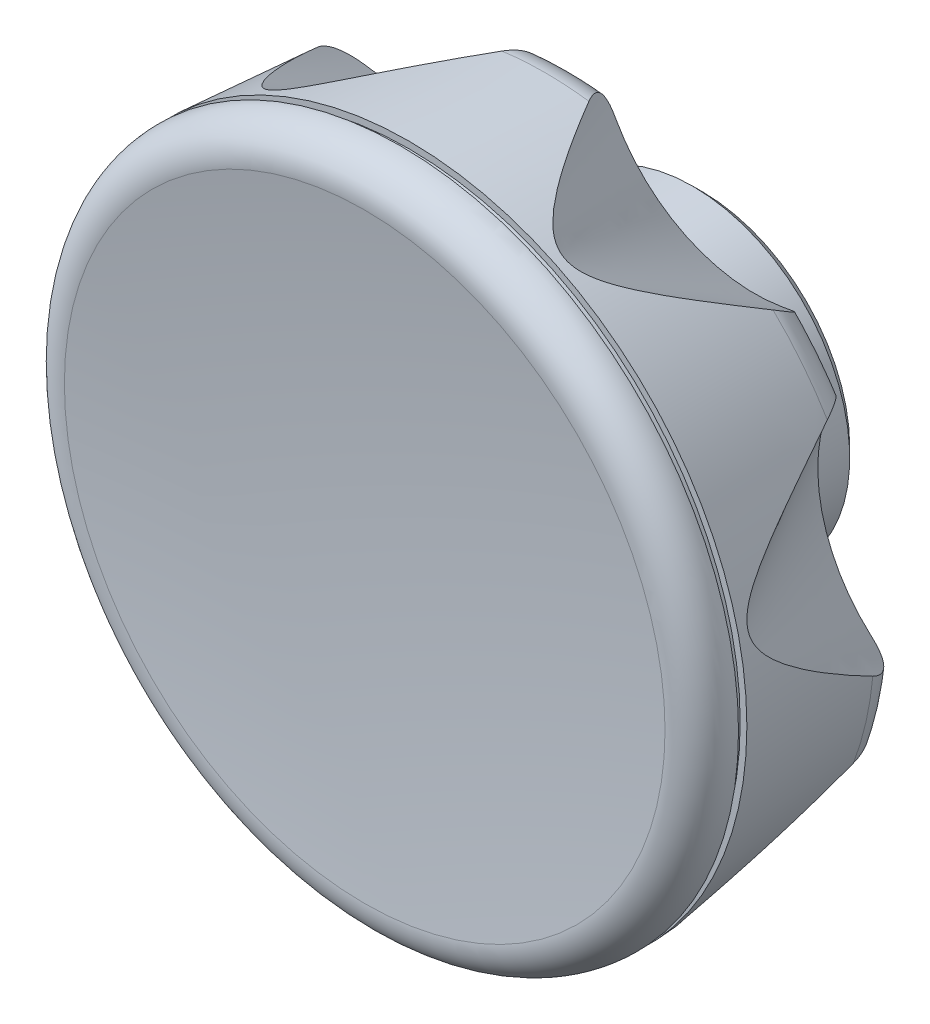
ISO-10303-21;
HEADER;
FILE_DESCRIPTION(('STEP AP214'),'2;1');
FILE_NAME('part.step','',(''),(''),'','','');
FILE_SCHEMA(('AUTOMOTIVE_DESIGN { 1 0 10303 214 1 1 1 1 }'));
ENDSEC;
DATA;
#1=APPLICATION_CONTEXT('core data for automotive mechanical design processes');
#2=APPLICATION_PROTOCOL_DEFINITION('international standard','automotive_design',2000,#1);
#3=PRODUCT_CONTEXT('',#1,'mechanical');
#4=PRODUCT('Part','Part','',(#3));
#5=PRODUCT_RELATED_PRODUCT_CATEGORY('part','',(#4));
#6=PRODUCT_DEFINITION_FORMATION('','',#4);
#7=PRODUCT_DEFINITION_CONTEXT('part definition',#1,'design');
#8=PRODUCT_DEFINITION('design','',#6,#7);
#9=PRODUCT_DEFINITION_SHAPE('','',#8);
#10=(LENGTH_UNIT() NAMED_UNIT(*) SI_UNIT(.MILLI.,.METRE.));
#11=(NAMED_UNIT(*) PLANE_ANGLE_UNIT() SI_UNIT($,.RADIAN.));
#12=(NAMED_UNIT(*) SI_UNIT($,.STERADIAN.) SOLID_ANGLE_UNIT());
#13=UNCERTAINTY_MEASURE_WITH_UNIT(LENGTH_MEASURE(1.E-05),#10,'distance_accuracy_value','');
#14=(GEOMETRIC_REPRESENTATION_CONTEXT(3) GLOBAL_UNCERTAINTY_ASSIGNED_CONTEXT((#13)) GLOBAL_UNIT_ASSIGNED_CONTEXT((#10,
#11,#12)) REPRESENTATION_CONTEXT('',''));
#15=CARTESIAN_POINT('',(0.,0.,0.));
#16=DIRECTION('',(0.,0.,1.));
#17=DIRECTION('',(1.,0.,0.));
#18=AXIS2_PLACEMENT_3D('',#15,#16,#17);
#19=CARTESIAN_POINT('',(0.,0.,16.5));
#20=DIRECTION('',(0.,0.,1.));
#21=DIRECTION('',(0.,1.,0.));
#22=AXIS2_PLACEMENT_3D('',#19,#20,#21);
#23=TOROIDAL_SURFACE('',#22,30.5569827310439,3.49999999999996);
#24=CARTESIAN_POINT('',(-30.4277694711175,-2.80714065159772,12.9999999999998));
#25=CARTESIAN_POINT('',(-30.4922913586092,-2.86477433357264,12.9999995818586));
#26=CARTESIAN_POINT('',(-30.558064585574,-2.92106397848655,13.002073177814));
#27=CARTESIAN_POINT('',(-30.6919823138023,-3.03053883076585,13.010813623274));
#28=CARTESIAN_POINT('',(-30.7601296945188,-3.08372004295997,13.017486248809));
#29=CARTESIAN_POINT('',(-30.8991260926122,-3.18687819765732,13.0359552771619));
#30=CARTESIAN_POINT('',(-30.9699939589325,-3.23682184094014,13.0477974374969));
#31=CARTESIAN_POINT('',(-31.1134463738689,-3.33240092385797,13.0770311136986));
#32=CARTESIAN_POINT('',(-31.1860302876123,-3.378037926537,13.0944206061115));
#33=CARTESIAN_POINT('',(-31.3330374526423,-3.46480885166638,13.1352731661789));
#34=CARTESIAN_POINT('',(-31.4074708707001,-3.50590306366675,13.1587845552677));
#35=CARTESIAN_POINT('',(-31.5569302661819,-3.58258562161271,13.2120638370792));
#36=CARTESIAN_POINT('',(-31.6319561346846,-3.61817495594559,13.2418306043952));
#37=CARTESIAN_POINT('',(-31.7815087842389,-3.68321920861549,13.3075877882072));
#38=CARTESIAN_POINT('',(-31.856036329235,-3.71269963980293,13.34355112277));
#39=CARTESIAN_POINT('',(-32.0040438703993,-3.76533170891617,13.4217135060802));
#40=CARTESIAN_POINT('',(-32.077524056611,-3.78848450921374,13.4639114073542));
#41=CARTESIAN_POINT('',(-32.2127536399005,-3.82555260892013,13.5481801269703));
#42=CARTESIAN_POINT('',(-32.2747476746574,-3.84029295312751,13.5894992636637));
#43=CARTESIAN_POINT('',(-32.3967559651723,-3.8648324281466,13.6763591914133));
#44=CARTESIAN_POINT('',(-32.4567695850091,-3.87462998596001,13.7219013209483));
#45=CARTESIAN_POINT('',(-32.5743242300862,-3.88932568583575,13.8168914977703));
#46=CARTESIAN_POINT('',(-32.6318634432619,-3.89422029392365,13.8663423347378));
#47=CARTESIAN_POINT('',(-32.7439869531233,-3.89923372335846,13.9687276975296));
#48=CARTESIAN_POINT('',(-32.7985700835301,-3.89935067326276,14.0216635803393));
#49=CARTESIAN_POINT('',(-32.9523859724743,-3.89300950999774,14.1800128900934));
#50=CARTESIAN_POINT('',(-33.0472644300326,-3.88049800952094,14.289516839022));
#51=CARTESIAN_POINT('',(-33.2229626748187,-3.84059009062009,14.5165356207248));
#52=CARTESIAN_POINT('',(-33.3037858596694,-3.81319727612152,14.6340485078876));
#53=CARTESIAN_POINT('',(-33.4587694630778,-3.74182305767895,14.8877018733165));
#54=CARTESIAN_POINT('',(-33.5312118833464,-3.69634528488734,15.0244673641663));
#55=CARTESIAN_POINT('',(-33.6577169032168,-3.59210577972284,15.3014973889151));
#56=CARTESIAN_POINT('',(-33.7117580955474,-3.53332870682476,15.4417657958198));
#57=CARTESIAN_POINT('',(-33.7933589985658,-3.41681811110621,15.6966901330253));
#58=CARTESIAN_POINT('',(-33.8239786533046,-3.36093708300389,15.8112404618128));
#59=CARTESIAN_POINT('',(-33.8735900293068,-3.24311939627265,16.0391889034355));
#60=CARTESIAN_POINT('',(-33.8926252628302,-3.18120642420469,16.1525897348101));
#61=CARTESIAN_POINT('',(-33.906149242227,-3.11665429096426,16.2650726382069));
#62=B_SPLINE_CURVE_WITH_KNOTS('',3,(#24,#25,#26,#27,#28,#29,#30,#31,#32,#33,#34,#35,#36,#37,#38,
#39,#40,#41,#42,#43,#44,#45,#46,#47,#48,#49,#50,#51,#52,#53,#54,#55,#56,#57,#58,#59,#60,#61),
.UNSPECIFIED.,.F.,.F.,(4,2,2,2,2,2,2,2,2,2,2,2,2,2,2,2,2,2,4),(0.,0.259555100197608,
0.519436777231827,0.781666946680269,1.04380157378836,1.30807155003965,1.57229402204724,
1.83538972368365,2.09843706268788,2.32597812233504,2.55359154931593,2.78136891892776,
3.00923550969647,3.44356210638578,3.87778356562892,4.35989598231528,4.84256736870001,
5.23515773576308,5.6262642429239),.UNSPECIFIED.);
#63=CARTESIAN_POINT('',(-30.4277694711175,-2.8071406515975,12.9999999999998));
#64=VERTEX_POINT('',#63);
#65=CARTESIAN_POINT('',(-33.906149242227,-3.11665429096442,16.2650726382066));
#66=VERTEX_POINT('',#65);
#67=EDGE_CURVE('E116',#64,#66,#62,.T.);
#68=ORIENTED_EDGE('',*,*,#67,.F.);
#69=CARTESIAN_POINT('',(0.,0.,12.9999999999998));
#70=DIRECTION('',(0.,0.,1.));
#71=DIRECTION('',(0.,1.,0.));
#72=AXIS2_PLACEMENT_3D('',#69,#70,#71);
#73=CIRCLE('',#72,30.5569827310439);
#74=CARTESIAN_POINT('',(-28.632445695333,-10.6729680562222,12.9999999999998));
#75=VERTEX_POINT('',#74);
#76=EDGE_CURVE('E37',#64,#75,#73,.T.);
#77=ORIENTED_EDGE('',*,*,#76,.T.);
#78=CARTESIAN_POINT('',(-31.9006505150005,-11.9033183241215,16.2650726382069));
#79=CARTESIAN_POINT('',(-31.9127655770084,-11.8542285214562,16.1788472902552));
#80=CARTESIAN_POINT('',(-31.9213061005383,-11.8051794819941,16.092150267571));
#81=CARTESIAN_POINT('',(-31.9308592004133,-11.7073324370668,15.9181115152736));
#82=CARTESIAN_POINT('',(-31.9318654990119,-11.6585346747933,15.8307693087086));
#83=CARTESIAN_POINT('',(-31.9229383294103,-11.512015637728,15.5668553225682));
#84=CARTESIAN_POINT('',(-31.9008235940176,-11.4150672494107,15.389974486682));
#85=CARTESIAN_POINT('',(-31.8413429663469,-11.2738330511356,15.1279647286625));
#86=CARTESIAN_POINT('',(-31.8170085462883,-11.2273082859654,15.0409016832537));
#87=CARTESIAN_POINT('',(-31.7592310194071,-11.1363098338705,14.8687696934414));
#88=CARTESIAN_POINT('',(-31.7257939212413,-11.0918348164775,14.7836994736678));
#89=CARTESIAN_POINT('',(-31.6497513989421,-11.0057346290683,14.616681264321));
#90=CARTESIAN_POINT('',(-31.6071781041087,-10.9641001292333,14.53472348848));
#91=CARTESIAN_POINT('',(-31.5127571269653,-10.8842577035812,14.3745637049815));
#92=CARTESIAN_POINT('',(-31.4609118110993,-10.8460489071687,14.296360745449));
#93=CARTESIAN_POINT('',(-31.3560371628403,-10.7789272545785,14.1553613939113));
#94=CARTESIAN_POINT('',(-31.3041952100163,-10.7494623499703,14.0919431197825));
#95=CARTESIAN_POINT('',(-31.1940469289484,-10.6941766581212,13.9692748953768));
#96=CARTESIAN_POINT('',(-31.1357419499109,-10.6683551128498,13.9100240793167));
#97=CARTESIAN_POINT('',(-31.0131130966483,-10.6208593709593,13.7963342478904));
#98=CARTESIAN_POINT('',(-30.9487918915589,-10.599183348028,13.7418931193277));
#99=CARTESIAN_POINT('',(-30.8147052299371,-10.5604026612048,13.6383551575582));
#100=CARTESIAN_POINT('',(-30.7449405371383,-10.5432973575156,13.5892575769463));
#101=CARTESIAN_POINT('',(-30.6117866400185,-10.5162408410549,13.5039379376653));
#102=CARTESIAN_POINT('',(-30.5490604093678,-10.5055947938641,13.4668960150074));
#103=CARTESIAN_POINT('',(-30.4207373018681,-10.4879457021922,13.3971240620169));
#104=CARTESIAN_POINT('',(-30.3551395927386,-10.480943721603,13.3643952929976));
#105=CARTESIAN_POINT('',(-30.2216746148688,-10.4706537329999,13.3033769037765));
#106=CARTESIAN_POINT('',(-30.1538085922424,-10.467363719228,13.2750848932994));
#107=CARTESIAN_POINT('',(-30.0163143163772,-10.4644744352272,13.2229137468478));
#108=CARTESIAN_POINT('',(-29.9466854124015,-10.4648765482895,13.1990362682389));
#109=CARTESIAN_POINT('',(-29.735784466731,-10.4715361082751,13.1338837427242));
#110=CARTESIAN_POINT('',(-29.5926042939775,-10.4832546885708,13.0991362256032));
#111=CARTESIAN_POINT('',(-29.3050619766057,-10.5200545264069,13.0457059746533));
#112=CARTESIAN_POINT('',(-29.1606993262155,-10.5451418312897,13.0270305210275));
#113=CARTESIAN_POINT('',(-28.952520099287,-10.5899735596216,13.0100924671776));
#114=CARTESIAN_POINT('',(-28.8880614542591,-10.6050709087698,13.0062521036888));
#115=CARTESIAN_POINT('',(-28.7597887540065,-10.637430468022,13.0012106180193));
#116=CARTESIAN_POINT('',(-28.6959733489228,-10.6546860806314,13.0000016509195));
#117=CARTESIAN_POINT('',(-28.632445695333,-10.6729680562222,12.9999999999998));
#118=B_SPLINE_CURVE_WITH_KNOTS('',3,(#78,#79,#80,#81,#82,#83,#84,#85,#86,#87,#88,#89,#90,#91,
#92,#93,#94,#95,#96,#97,#98,#99,#100,#101,#102,#103,#104,#105,#106,#107,#108,#109,#110,#111,
#112,#113,#114,#115,#116,#117),.UNSPECIFIED.,.F.,.F.,(4,2,2,2,2,2,2,2,2,2,2,2,2,2,2,2,2,2,2,4),
(0.,0.299698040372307,0.599645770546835,1.20498031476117,1.50964069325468,1.81410045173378,
2.11750656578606,2.4208353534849,2.68159295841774,2.94229623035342,3.20288438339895,
3.46343604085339,3.68403118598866,3.90469069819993,4.12523092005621,4.34585377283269,
4.78744512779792,5.22923640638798,5.42810702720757,5.62638394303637),.UNSPECIFIED.);
#119=CARTESIAN_POINT('',(-31.9006505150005,-11.9033183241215,16.2650726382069));
#120=VERTEX_POINT('',#119);
#121=EDGE_CURVE('E344',#120,#75,#118,.T.);
#122=ORIENTED_EDGE('',*,*,#121,.F.);
#123=CARTESIAN_POINT('',(0.,0.,16.2650726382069));
#124=DIRECTION('',(0.,0.,1.));
#125=DIRECTION('',(0.,1.,0.));
#126=AXIS2_PLACEMENT_3D('',#123,#124,#125);
#127=CIRCLE('',#126,34.0490894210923);
#128=EDGE_CURVE('E123',#66,#120,#127,.T.);
#129=ORIENTED_EDGE('',*,*,#128,.F.);
#130=EDGE_LOOP('',(#68,#77,#122,#129));
#131=FACE_BOUND('',#130,.T.);
#132=ADVANCED_FACE('F14',(#131),#23,.T.);
#133=CARTESIAN_POINT('',(-16.7766930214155,-25.5396116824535,12.9999999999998));
#134=CARTESIAN_POINT('',(-16.7718619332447,-25.6259909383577,12.9999995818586));
#135=CARTESIAN_POINT('',(-16.7688618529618,-25.7125105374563,13.002073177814));
#136=CARTESIAN_POINT('',(-16.7667673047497,-25.8854680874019,13.010813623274));
#137=CARTESIAN_POINT('',(-16.7676777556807,-25.9719057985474,13.017486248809));
#138=CARTESIAN_POINT('',(-16.7736882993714,-26.1448956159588,13.0359552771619));
#139=CARTESIAN_POINT('',(-16.7788261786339,-26.2314416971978,13.0477974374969));
#140=CARTESIAN_POINT('',(-16.7935405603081,-26.4031898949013,13.0770311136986));
#141=CARTESIAN_POINT('',(-16.803115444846,-26.4883924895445,13.0944206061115));
#142=CARTESIAN_POINT('',(-16.8269326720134,-26.6574281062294,13.1352731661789));
#143=CARTESIAN_POINT('',(-16.8412124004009,-26.7412443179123,13.1587845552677));
#144=CARTESIAN_POINT('',(-16.8744459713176,-26.9059071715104,13.2120638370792));
#145=CARTESIAN_POINT('',(-16.893398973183,-26.9867543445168,13.2418306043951));
#146=CARTESIAN_POINT('',(-16.9357898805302,-27.1442337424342,13.3075877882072));
#147=CARTESIAN_POINT('',(-16.9592083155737,-27.220882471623,13.3435511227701));
#148=CARTESIAN_POINT('',(-17.0103400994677,-27.3694149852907,13.4217135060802));
#149=CARTESIAN_POINT('',(-17.0380526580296,-27.4412996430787,13.4639114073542));
#150=CARTESIAN_POINT('',(-17.0933859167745,-27.5701379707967,13.5481801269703));
#151=CARTESIAN_POINT('',(-17.1205141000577,-27.6277973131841,13.5894992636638));
#152=CARTESIAN_POINT('',(-17.1773992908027,-27.738487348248,13.6763591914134));
#153=CARTESIAN_POINT('',(-17.2071571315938,-27.7915165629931,13.7219013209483));
#154=CARTESIAN_POINT('',(-17.2689616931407,-27.8925871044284,13.8168914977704));
#155=CARTESIAN_POINT('',(-17.3010100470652,-27.9406248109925,13.8663423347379));
#156=CARTESIAN_POINT('',(-17.3669982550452,-28.0314123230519,13.9687276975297));
#157=CARTESIAN_POINT('',(-17.4009388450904,-28.0741600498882,14.0216635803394));
#158=CARTESIAN_POINT('',(-17.501799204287,-28.1904645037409,14.1800128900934));
#159=CARTESIAN_POINT('',(-17.5707368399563,-28.2568426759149,14.289516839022));
#160=CARTESIAN_POINT('',(-17.7114841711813,-28.3693269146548,14.5165356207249));
#161=CARTESIAN_POINT('',(-17.7832931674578,-28.4154378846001,14.6340485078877));
#162=CARTESIAN_POINT('',(-17.9357264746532,-28.4921078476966,14.8877018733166));
#163=CARTESIAN_POINT('',(-18.0164495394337,-28.5203906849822,15.0244673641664));
#164=CARTESIAN_POINT('',(-18.1768218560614,-28.5543040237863,15.3014973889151));
#165=CARTESIAN_POINT('',(-18.256469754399,-28.5599082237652,15.4417657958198));
#166=CARTESIAN_POINT('',(-18.3984387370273,-28.5510632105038,15.6966901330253));
#167=CARTESIAN_POINT('',(-18.4612193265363,-28.5401613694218,15.8112404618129));
#168=CARTESIAN_POINT('',(-18.5842650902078,-28.5054909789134,16.0391889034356));
#169=CARTESIAN_POINT('',(-18.6445388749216,-28.4817712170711,16.1525897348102));
#170=CARTESIAN_POINT('',(-18.703439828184,-28.4520970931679,16.2650726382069));
#171=B_SPLINE_CURVE_WITH_KNOTS('',3,(#133,#134,#135,#136,#137,#138,#139,#140,#141,#142,#143,
#144,#145,#146,#147,#148,#149,#150,#151,#152,#153,#154,#155,#156,#157,#158,#159,#160,#161,#162,
#163,#164,#165,#166,#167,#168,#169,#170),.UNSPECIFIED.,.F.,.F.,(4,2,2,2,2,2,2,2,2,2,2,2,2,2,2,2,
2,2,4),(0.,0.259555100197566,0.519436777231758,0.781666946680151,1.04380157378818,
1.30807155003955,1.57229402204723,1.83538972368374,2.09843706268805,2.32597812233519,
2.55359154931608,2.78136891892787,3.00923550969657,3.44356210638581,3.8777835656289,
4.35989598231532,4.84256736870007,5.23515773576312,5.62626424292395),.UNSPECIFIED.);
#172=CARTESIAN_POINT('',(-16.7766930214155,-25.5396116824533,12.9999999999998));
#173=VERTEX_POINT('',#172);
#174=CARTESIAN_POINT('',(-18.7034398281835,-28.4520970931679,16.2650726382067));
#175=VERTEX_POINT('',#174);
#176=EDGE_CURVE('E343',#173,#175,#171,.T.);
#177=ORIENTED_EDGE('',*,*,#176,.F.);
#178=CARTESIAN_POINT('',(-9.50757545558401,-29.040234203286,12.9999999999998));
#179=VERTEX_POINT('',#178);
#180=EDGE_CURVE('E132',#173,#179,#73,.T.);
#181=ORIENTED_EDGE('',*,*,#180,.T.);
#182=CARTESIAN_POINT('',(-10.5833412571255,-32.3625304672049,16.2650726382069));
#183=CARTESIAN_POINT('',(-10.6292748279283,-32.341395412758,16.1788472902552));
#184=CARTESIAN_POINT('',(-10.6729478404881,-32.3174910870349,16.092150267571));
#185=CARTESIAN_POINT('',(-10.755404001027,-32.2639533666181,15.9181115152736));
#186=CARTESIAN_POINT('',(-10.7941830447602,-32.2343152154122,15.8307693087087));
#187=CARTESIAN_POINT('',(-10.9031702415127,-32.1359825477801,15.5668553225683));
#188=CARTESIAN_POINT('',(-10.9651792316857,-32.0582462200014,15.389974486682));
#189=CARTESIAN_POINT('',(-11.0385150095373,-31.9236843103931,15.1279647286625));
#190=CARTESIAN_POINT('',(-11.0597172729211,-31.8756511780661,15.0409016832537));
#191=CARTESIAN_POINT('',(-11.0948390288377,-31.773742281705,14.8687696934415));
#192=CARTESIAN_POINT('',(-11.1087633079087,-31.7198703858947,14.7836994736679));
#193=CARTESIAN_POINT('',(-11.1286674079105,-31.6067353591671,14.616681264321));
#194=CARTESIAN_POINT('',(-11.1346745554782,-31.5474915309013,14.53472348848));
#195=CARTESIAN_POINT('',(-11.1382273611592,-31.4238893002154,14.3745637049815));
#196=CARTESIAN_POINT('',(-11.1357751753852,-31.3595322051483,14.2963607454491));
#197=CARTESIAN_POINT('',(-11.1228647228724,-31.2356882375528,14.1553613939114));
#198=CARTESIAN_POINT('',(-11.1135783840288,-31.1767854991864,14.0919431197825));
#199=CARTESIAN_POINT('',(-11.0881261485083,-31.0561980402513,13.9692748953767));
#200=CARTESIAN_POINT('',(-11.0719616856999,-30.9945139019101,13.9100240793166));
#201=CARTESIAN_POINT('',(-11.0326375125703,-30.86902569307,13.7963342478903));
#202=CARTESIAN_POINT('',(-11.0094808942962,-30.8052225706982,13.7418931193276));
#203=CARTESIAN_POINT('',(-10.9561991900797,-30.67621003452,13.6383551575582));
#204=CARTESIAN_POINT('',(-10.9260750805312,-30.6110008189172,13.5892575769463));
#205=CARTESIAN_POINT('',(-10.8642086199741,-30.4900274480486,13.5039379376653));
#206=CARTESIAN_POINT('',(-10.8334228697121,-30.4343484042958,13.4668960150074));
#207=CARTESIAN_POINT('',(-10.7672133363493,-30.3230173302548,13.3971240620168));
#208=CARTESIAN_POINT('',(-10.731788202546,-30.2673653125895,13.3643952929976));
#209=CARTESIAN_POINT('',(-10.6566191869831,-30.1566024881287,13.3033769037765));
#210=CARTESIAN_POINT('',(-10.6168776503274,-30.1014914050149,13.2750848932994));
#211=CARTESIAN_POINT('',(-10.5334103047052,-29.992192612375,13.2229137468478));
#212=CARTESIAN_POINT('',(-10.4896830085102,-29.9380052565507,13.1990362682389));
#213=CARTESIAN_POINT('',(-10.3529817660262,-29.777268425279,13.1338837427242));
#214=CARTESIAN_POINT('',(-10.2545484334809,-29.6726320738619,13.0991362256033));
#215=CARTESIAN_POINT('',(-10.0464974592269,-29.4707667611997,13.0457059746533));
#216=CARTESIAN_POINT('',(-9.93687477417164,-29.3735411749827,13.0270305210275));
#217=CARTESIAN_POINT('',(-9.77202629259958,-29.2387322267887,13.0100924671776));
#218=CARTESIAN_POINT('',(-9.72003340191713,-29.1977494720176,13.0062521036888));
#219=CARTESIAN_POINT('',(-9.61475695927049,-29.1176376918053,13.0012106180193));
#220=CARTESIAN_POINT('',(-9.56147772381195,-29.0785034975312,13.0000016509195));
#221=CARTESIAN_POINT('',(-9.50757545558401,-29.0402342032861,12.9999999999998));
#222=B_SPLINE_CURVE_WITH_KNOTS('',3,(#182,#183,#184,#185,#186,#187,#188,#189,#190,#191,#192,
#193,#194,#195,#196,#197,#198,#199,#200,#201,#202,#203,#204,#205,#206,#207,#208,#209,#210,#211,
#212,#213,#214,#215,#216,#217,#218,#219,#220,#221),.UNSPECIFIED.,.F.,.F.,(4,2,2,2,2,2,2,2,2,2,2,
2,2,2,2,2,2,2,2,4),(0.,0.299698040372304,0.599645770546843,1.20498031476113,1.50964069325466,
1.81410045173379,2.1175065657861,2.42083535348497,2.68159295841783,2.94229623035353,
3.20288438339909,3.46343604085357,3.6840311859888,3.90469069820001,4.12523092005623,
4.34585377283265,4.78744512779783,5.22923640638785,5.42810702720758,5.62638394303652),.UNSPECIFIED.);
#223=CARTESIAN_POINT('',(-10.5833412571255,-32.3625304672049,16.2650726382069));
#224=VERTEX_POINT('',#223);
#225=EDGE_CURVE('E389',#224,#179,#222,.T.);
#226=ORIENTED_EDGE('',*,*,#225,.F.);
#227=EDGE_CURVE('E654',#175,#224,#127,.T.);
#228=ORIENTED_EDGE('',*,*,#227,.F.);
#229=EDGE_LOOP('',(#177,#181,#226,#228));
#230=FACE_BOUND('',#229,.T.);
#231=ADVANCED_FACE('F173',(#230),#23,.T.);
#232=CARTESIAN_POINT('',(9.50757545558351,-29.0402342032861,12.9999999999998));
#233=CARTESIAN_POINT('',(9.5781216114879,-29.090313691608,12.9999995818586));
#234=CARTESIAN_POINT('',(9.64763587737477,-29.1419122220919,13.002073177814));
#235=CARTESIAN_POINT('',(9.78416546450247,-29.2481119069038,13.010813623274));
#236=CARTESIAN_POINT('',(9.85117753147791,-29.3027167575,13.017486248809));
#237=CARTESIAN_POINT('',(9.98267890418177,-29.4152733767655,13.0359552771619));
#238=CARTESIAN_POINT('',(10.0471399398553,-29.4732509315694,13.0477974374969));
#239=CARTESIAN_POINT('',(10.1722438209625,-29.5918383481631,13.0770311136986));
#240=CARTESIAN_POINT('',(10.2328880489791,-29.6524472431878,13.0944206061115));
#241=CARTESIAN_POINT('',(10.3501956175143,-29.7764602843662,13.1352731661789));
#242=CARTESIAN_POINT('',(10.4068225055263,-29.8398831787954,13.1587845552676));
#243=CARTESIAN_POINT('',(10.5148403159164,-29.9685318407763,13.2120638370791));
#244=CARTESIAN_POINT('',(10.5662321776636,-30.0337572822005,13.2418306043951));
#245=CARTESIAN_POINT('',(10.662924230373,-30.1650866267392,13.3075877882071));
#246=CARTESIAN_POINT('',(10.7082494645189,-30.231185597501,13.3435511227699));
#247=CARTESIAN_POINT('',(10.7924967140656,-30.3637705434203,13.4217135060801));
#248=CARTESIAN_POINT('',(10.8314199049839,-30.4302564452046,13.4639114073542));
#249=CARTESIAN_POINT('',(10.8976500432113,-30.5538471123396,13.5481801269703));
#250=CARTESIAN_POINT('',(10.9258157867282,-30.611006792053,13.5894992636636));
#251=CARTESIAN_POINT('',(10.9768894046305,-30.7244955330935,13.6763591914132));
#252=CARTESIAN_POINT('',(10.9997956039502,-30.7808243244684,13.7219013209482));
#253=CARTESIAN_POINT('',(11.0402812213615,-30.8921615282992,13.8168914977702));
#254=CARTESIAN_POINT('',(11.0578567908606,-30.9471689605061,13.8663423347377));
#255=CARTESIAN_POINT('',(11.0876943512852,-31.0553657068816,13.9687276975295));
#256=CARTESIAN_POINT('',(11.0999542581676,-31.1085543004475,14.0216635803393));
#257=CARTESIAN_POINT('',(11.12799933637,-31.2599247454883,14.1800128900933));
#258=CARTESIAN_POINT('',(11.1369139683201,-31.3552084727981,14.2895168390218));
#259=CARTESIAN_POINT('',(11.1371031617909,-31.5353819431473,14.5165356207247));
#260=CARTESIAN_POINT('',(11.1283819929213,-31.6202741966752,14.6340485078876));
#261=CARTESIAN_POINT('',(11.0932843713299,-31.7872542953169,14.8877018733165));
#262=CARTESIAN_POINT('',(11.0650667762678,-31.868000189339,15.0244673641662));
#263=CARTESIAN_POINT('',(10.9915907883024,-32.0145289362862,15.3014973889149));
#264=CARTESIAN_POINT('',(10.9463126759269,-32.0802943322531,15.4417657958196));
#265=CARTESIAN_POINT('',(10.8508811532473,-32.1857753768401,15.6966901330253));
#266=CARTESIAN_POINT('',(10.8032146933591,-32.2280620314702,15.8112404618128));
#267=CARTESIAN_POINT('',(10.6993905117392,-32.3026464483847,16.0391889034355));
#268=CARTESIAN_POINT('',(10.6432655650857,-32.3349813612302,16.1525897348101));
#269=CARTESIAN_POINT('',(10.5833412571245,-32.362530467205,16.2650726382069));
#270=B_SPLINE_CURVE_WITH_KNOTS('',3,(#232,#233,#234,#235,#236,#237,#238,#239,#240,#241,#242,
#243,#244,#245,#246,#247,#248,#249,#250,#251,#252,#253,#254,#255,#256,#257,#258,#259,#260,#261,
#262,#263,#264,#265,#266,#267,#268,#269),.UNSPECIFIED.,.F.,.F.,(4,2,2,2,2,2,2,2,2,2,2,2,2,2,2,2,
2,2,4),(0.,0.259555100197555,0.51943677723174,0.781666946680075,1.04380157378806,
1.30807155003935,1.57229402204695,1.83538972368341,2.09843706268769,2.32597812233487,
2.55359154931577,2.78136891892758,3.00923550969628,3.44356210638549,3.87778356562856,
4.35989598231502,4.84256736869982,5.23515773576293,5.62626424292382),.UNSPECIFIED.);
#271=CARTESIAN_POINT('',(9.50757545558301,-29.0402342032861,12.9999999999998));
#272=VERTEX_POINT('',#271);
#273=CARTESIAN_POINT('',(10.583341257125,-32.3625304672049,16.2650726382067));
#274=VERTEX_POINT('',#273);
#275=EDGE_CURVE('E394',#272,#274,#270,.T.);
#276=ORIENTED_EDGE('',*,*,#275,.F.);
#277=CARTESIAN_POINT('',(16.7766930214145,-25.5396116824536,12.9999999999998));
#278=VERTEX_POINT('',#277);
#279=EDGE_CURVE('E136',#272,#278,#73,.T.);
#280=ORIENTED_EDGE('',*,*,#279,.T.);
#281=CARTESIAN_POINT('',(18.703439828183,-28.4520970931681,16.2650726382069));
#282=CARTESIAN_POINT('',(18.6582766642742,-28.4748319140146,16.1788472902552));
#283=CARTESIAN_POINT('',(18.6123578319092,-28.4940727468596,16.0921502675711));
#284=CARTESIAN_POINT('',(18.5190897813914,-28.5251593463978,15.9181115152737));
#285=CARTESIAN_POINT('',(18.4717394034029,-28.5369989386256,15.8307693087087));
#286=CARTESIAN_POINT('',(18.3269074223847,-28.5608991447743,15.5668553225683));
#287=CARTESIAN_POINT('',(18.2274687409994,-28.5609119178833,15.3899744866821));
#288=CARTESIAN_POINT('',(18.0765398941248,-28.5343501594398,15.1279647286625));
#289=CARTESIAN_POINT('',(18.0257666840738,-28.5209785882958,15.0409016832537));
#290=CARTESIAN_POINT('',(17.9241930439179,-28.4848987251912,14.8687696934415));
#291=CARTESIAN_POINT('',(17.8733926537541,-28.462196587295,14.7836994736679));
#292=CARTESIAN_POINT('',(17.7725301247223,-28.407219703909,14.616681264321));
#293=CARTESIAN_POINT('',(17.7224660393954,-28.3749783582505,14.53472348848));
#294=CARTESIAN_POINT('',(17.6236147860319,-28.3006913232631,14.3745637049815));
#295=CARTESIAN_POINT('',(17.5748272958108,-28.2586481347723,14.2963607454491));
#296=CARTESIAN_POINT('',(17.4860517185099,-28.1713388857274,14.1553613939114));
#297=CARTESIAN_POINT('',(17.4457896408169,-28.1273532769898,14.0919431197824));
#298=CARTESIAN_POINT('',(17.3673797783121,-28.0322688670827,13.9692748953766));
#299=CARTESIAN_POINT('',(17.3292315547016,-27.9811715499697,13.9100240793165));
#300=CARTESIAN_POINT('',(17.2556391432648,-27.8721860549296,13.7963342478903));
#301=CARTESIAN_POINT('',(17.2201937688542,-27.8143008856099,13.7418931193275));
#302=CARTESIAN_POINT('',(17.1525483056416,-27.6922055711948,13.6383551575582));
#303=CARTESIAN_POINT('',(17.12034776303,-27.6279963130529,13.5892575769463));
#304=CARTESIAN_POINT('',(17.064340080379,-27.5042015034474,13.5039379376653));
#305=CARTESIAN_POINT('',(17.0400030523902,-27.4454169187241,13.4668960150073));
#306=CARTESIAN_POINT('',(16.9942418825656,-27.3242384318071,13.3971240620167));
#307=CARTESIAN_POINT('',(16.9728185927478,-27.2618434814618,13.3643952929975));
#308=CARTESIAN_POINT('',(16.9330878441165,-27.1340144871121,13.3033769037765));
#309=CARTESIAN_POINT('',(16.9147787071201,-27.0685821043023,13.2750848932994));
#310=CARTESIAN_POINT('',(16.8813665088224,-26.9351780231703,13.2229137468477));
#311=CARTESIAN_POINT('',(16.8662646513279,-26.8672053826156,13.1990362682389));
#312=CARTESIAN_POINT('',(16.825827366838,-26.660110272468,13.1338837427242));
#313=CARTESIAN_POINT('',(16.805391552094,-26.5179122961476,13.0991362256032));
#314=CARTESIAN_POINT('',(16.7772845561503,-26.2293905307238,13.0457059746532));
#315=CARTESIAN_POINT('',(16.7696191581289,-26.0830649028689,13.0270305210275));
#316=CARTESIAN_POINT('',(16.7670026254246,-25.8701291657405,13.0100924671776));
#317=CARTESIAN_POINT('',(16.7673780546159,-25.8039271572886,13.0062521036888));
#318=CARTESIAN_POINT('',(16.7703829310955,-25.6716698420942,13.0012106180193));
#319=CARTESIAN_POINT('',(16.7730056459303,-25.605614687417,13.0000016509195));
#320=CARTESIAN_POINT('',(16.776693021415,-25.5396116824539,12.9999999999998));
#321=B_SPLINE_CURVE_WITH_KNOTS('',3,(#281,#282,#283,#284,#285,#286,#287,#288,#289,#290,#291,
#292,#293,#294,#295,#296,#297,#298,#299,#300,#301,#302,#303,#304,#305,#306,#307,#308,#309,#310,
#311,#312,#313,#314,#315,#316,#317,#318,#319,#320),.UNSPECIFIED.,.F.,.F.,(4,2,2,2,2,2,2,2,2,2,2,
2,2,2,2,2,2,2,2,4),(0.,0.299698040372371,0.599645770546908,1.20498031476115,1.50964069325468,
1.81410045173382,2.11750656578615,2.42083535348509,2.68159295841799,2.9422962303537,
3.20288438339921,3.46343604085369,3.68403118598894,3.90469069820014,4.12523092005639,
4.34585377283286,4.7874451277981,5.22923640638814,5.4281070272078,5.62638394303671),.UNSPECIFIED.);
#322=CARTESIAN_POINT('',(18.703439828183,-28.4520970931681,16.2650726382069));
#323=VERTEX_POINT('',#322);
#324=EDGE_CURVE('E401',#323,#278,#321,.T.);
#325=ORIENTED_EDGE('',*,*,#324,.F.);
#326=EDGE_CURVE('E657',#274,#323,#127,.T.);
#327=ORIENTED_EDGE('',*,*,#326,.F.);
#328=EDGE_LOOP('',(#276,#280,#325,#327));
#329=FACE_BOUND('',#328,.T.);
#330=ADVANCED_FACE('F180',(#329),#23,.T.);
#331=CARTESIAN_POINT('',(28.6324456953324,-10.6729680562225,12.9999999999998));
#332=CARTESIAN_POINT('',(28.7155842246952,-10.6490369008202,12.9999995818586));
#333=CARTESIAN_POINT('',(28.7992670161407,-10.6268596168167,13.002073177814));
#334=CARTESIAN_POINT('',(28.9674220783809,-10.5863309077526,13.010813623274));
#335=CARTESIAN_POINT('',(29.0518952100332,-10.5679843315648,13.017486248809));
#336=CARTESIAN_POINT('',(29.2218852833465,-10.5353503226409,13.0359552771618));
#337=CARTESIAN_POINT('',(29.3074047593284,-10.5211010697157,13.0477974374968));
#338=CARTESIAN_POINT('',(29.4781211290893,-10.4972289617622,13.0770311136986));
#339=CARTESIAN_POINT('',(29.5633181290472,-10.4876044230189,13.0944206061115));
#340=CARTESIAN_POINT('',(29.7334155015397,-10.4732105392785,13.1352731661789));
#341=CARTESIAN_POINT('',(29.8183078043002,-10.4684813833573,13.1587845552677));
#342=CARTESIAN_POINT('',(29.9862373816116,-10.4642407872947,13.2120638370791));
#343=CARTESIAN_POINT('',(30.0692749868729,-10.4647284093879,13.2418306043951));
#344=CARTESIAN_POINT('',(30.2322389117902,-10.4710140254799,13.3075877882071));
#345=CARTESIAN_POINT('',(30.3121769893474,-10.4767893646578,13.34355112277));
#346=CARTESIAN_POINT('',(30.4683633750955,-10.4935875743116,13.4217135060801));
#347=CARTESIAN_POINT('',(30.5446123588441,-10.5046094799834,13.4639114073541));
#348=CARTESIAN_POINT('',(30.68253324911,-10.5298861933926,13.5481801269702));
#349=CARTESIAN_POINT('',(30.7447835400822,-10.5435038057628,13.5894992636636));
#350=CARTESIAN_POINT('',(30.8653564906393,-10.5743319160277,13.6763591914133));
#351=CARTESIAN_POINT('',(30.9236778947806,-10.5915435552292,13.7219013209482));
#352=CARTESIAN_POINT('',(31.0359671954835,-10.6293082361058,13.8168914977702));
#353=CARTESIAN_POINT('',(31.0899319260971,-10.6498636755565,13.8663423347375));
#354=CARTESIAN_POINT('',(31.193126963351,-10.6939952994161,13.9687276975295));
#355=CARTESIAN_POINT('',(31.2423554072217,-10.717572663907,14.0216635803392));
#356=CARTESIAN_POINT('',(31.3781874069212,-10.790024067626,14.1800128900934));
#357=CARTESIAN_POINT('',(31.4582414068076,-10.8424627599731,14.2895168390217));
#358=CARTESIAN_POINT('',(31.5992246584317,-10.9546511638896,14.5165356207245));
#359=CARTESIAN_POINT('',(31.6601585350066,-11.0143991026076,14.6340485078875));
#360=CARTESIAN_POINT('',(31.7688258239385,-11.1459499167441,14.8877018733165));
#361=CARTESIAN_POINT('',(31.8143621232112,-11.2183555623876,15.0244673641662));
#362=CARTESIAN_POINT('',(31.8831113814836,-11.3671605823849,15.3014973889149));
#363=CARTESIAN_POINT('',(31.906298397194,-11.4435644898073,15.4417657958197));
#364=CARTESIAN_POINT('',(31.9292662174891,-11.5839422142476,15.6966901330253));
#365=CARTESIAN_POINT('',(31.932607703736,-11.6475746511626,15.8112404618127));
#366=CARTESIAN_POINT('',(31.9261868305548,-11.7752502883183,16.0391889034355));
#367=CARTESIAN_POINT('',(31.9164739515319,-11.839291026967,16.1525897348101));
#368=CARTESIAN_POINT('',(31.9006505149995,-11.9033183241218,16.2650726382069));
#369=B_SPLINE_CURVE_WITH_KNOTS('',3,(#331,#332,#333,#334,#335,#336,#337,#338,#339,#340,#341,
#342,#343,#344,#345,#346,#347,#348,#349,#350,#351,#352,#353,#354,#355,#356,#357,#358,#359,#360,
#361,#362,#363,#364,#365,#366,#367,#368),.UNSPECIFIED.,.F.,.F.,(4,2,2,2,2,2,2,2,2,2,2,2,2,2,2,2,
2,2,4),(0.,0.25955510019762,0.519436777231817,0.781666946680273,1.0438015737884,
1.30807155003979,1.57229402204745,1.83538972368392,2.09843706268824,2.32597812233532,
2.5535915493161,2.78136891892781,3.00923550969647,3.44356210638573,3.87778356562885,
4.35989598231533,4.8425673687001,5.2351577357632,5.62626424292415),.UNSPECIFIED.);
#370=CARTESIAN_POINT('',(28.6324456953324,-10.6729680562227,12.9999999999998));
#371=VERTEX_POINT('',#370);
#372=CARTESIAN_POINT('',(31.9006505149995,-11.9033183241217,16.2650726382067));
#373=VERTEX_POINT('',#372);
#374=EDGE_CURVE('E411',#371,#373,#369,.T.);
#375=ORIENTED_EDGE('',*,*,#374,.F.);
#376=CARTESIAN_POINT('',(30.4277694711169,-2.80714065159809,12.9999999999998));
#377=VERTEX_POINT('',#376);
#378=EDGE_CURVE('E224',#371,#377,#73,.T.);
#379=ORIENTED_EDGE('',*,*,#378,.T.);
#380=CARTESIAN_POINT('',(33.9061492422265,-3.11665429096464,16.2650726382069));
#381=CARTESIAN_POINT('',(33.8957652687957,-3.16613920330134,16.1788472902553));
#382=CARTESIAN_POINT('',(33.88217843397,-3.21403645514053,16.0921502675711));
#383=CARTESIAN_POINT('',(33.8483312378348,-3.30633853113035,15.9181115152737));
#384=CARTESIAN_POINT('',(33.8280653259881,-3.35074041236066,15.8307693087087));
#385=CARTESIAN_POINT('',(33.7564499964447,-3.47887614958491,15.5668553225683));
#386=CARTESIAN_POINT('',(33.6944609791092,-3.55662840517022,15.3899744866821));
#387=CARTESIAN_POINT('',(33.5795915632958,-3.65806834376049,15.1279647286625));
#388=CARTESIAN_POINT('',(33.5374806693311,-3.6894273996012,15.0409016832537));
#389=CARTESIAN_POINT('',(33.445942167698,-3.74634544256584,14.8687696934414));
#390=CARTESIAN_POINT('',(33.3965193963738,-3.77190823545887,14.7836994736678));
#391=CARTESIAN_POINT('',(33.2906499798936,-3.81648820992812,14.616681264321));
#392=CARTESIAN_POINT('',(33.23422823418,-3.83552773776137,14.53472348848));
#393=CARTESIAN_POINT('',(33.1145155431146,-3.86649555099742,14.3745637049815));
#394=CARTESIAN_POINT('',(33.0512263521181,-3.87842564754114,14.2963607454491));
#395=CARTESIAN_POINT('',(32.9276145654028,-3.89339676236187,14.1553613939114));
#396=CARTESIAN_POINT('',(32.8681222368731,-3.89745034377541,14.0919431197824));
#397=CARTESIAN_POINT('',(32.7448945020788,-3.89946948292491,13.9692748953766));
#398=CARTESIAN_POINT('',(32.6811599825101,-3.8974363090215,13.9100240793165));
#399=CARTESIAN_POINT('',(32.5500675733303,-3.88702182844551,13.7963342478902));
#400=CARTESIAN_POINT('',(32.4827112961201,-3.87864332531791,13.7418931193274));
#401=CARTESIAN_POINT('',(32.3450770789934,-3.85540549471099,13.6383551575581));
#402=CARTESIAN_POINT('',(32.2747995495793,-3.84054707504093,13.5892575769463));
#403=CARTESIAN_POINT('',(32.143092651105,-3.80715084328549,13.5039379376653));
#404=CARTESIAN_POINT('',(32.081959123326,-3.78952670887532,13.4668960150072));
#405=CARTESIAN_POINT('',(31.9586863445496,-3.74975068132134,13.3971240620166));
#406=CARTESIAN_POINT('',(31.896546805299,-3.72759746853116,13.3643952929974));
#407=CARTESIAN_POINT('',(31.7718343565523,-3.67896014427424,13.3033769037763));
#408=CARTESIAN_POINT('',(31.7092616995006,-3.65247838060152,13.2750848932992));
#409=CARTESIAN_POINT('',(31.5841300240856,-3.59542500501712,13.2229137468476));
#410=CARTESIAN_POINT('',(31.5215710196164,-3.56485186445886,13.1990362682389));
#411=CARTESIAN_POINT('',(31.3344453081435,-3.46734531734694,13.1338837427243));
#412=CARTESIAN_POINT('',(31.2105289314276,-3.39466369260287,13.0991362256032));
#413=CARTESIAN_POINT('',(30.9674291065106,-3.23674824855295,13.0457059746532));
#414=CARTESIAN_POINT('',(30.8482478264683,-3.15150876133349,13.0270305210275));
#415=CARTESIAN_POINT('',(30.6801365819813,-3.02079118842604,13.0100924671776));
#416=CARTESIAN_POINT('',(30.628611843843,-2.97922138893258,13.0062521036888));
#417=CARTESIAN_POINT('',(30.5270824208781,-2.89441099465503,13.0012106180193));
#418=CARTESIAN_POINT('',(30.4770736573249,-2.85117575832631,13.0000016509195));
#419=CARTESIAN_POINT('',(30.4277694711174,-2.80714065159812,12.9999999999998));
#420=B_SPLINE_CURVE_WITH_KNOTS('',3,(#380,#381,#382,#383,#384,#385,#386,#387,#388,#389,#390,
#391,#392,#393,#394,#395,#396,#397,#398,#399,#400,#401,#402,#403,#404,#405,#406,#407,#408,#409,
#410,#411,#412,#413,#414,#415,#416,#417,#418,#419),.UNSPECIFIED.,.F.,.F.,(4,2,2,2,2,2,2,2,2,2,2,
2,2,2,2,2,2,2,2,4),(0.,0.299698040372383,0.59964577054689,1.20498031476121,1.50964069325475,
1.81410045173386,2.11750656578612,2.42083535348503,2.68159295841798,2.94229623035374,
3.20288438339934,3.46343604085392,3.6840311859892,3.90469069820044,4.1252309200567,
4.34585377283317,4.78744512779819,5.22923640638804,5.42810702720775,5.62638394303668),.UNSPECIFIED.);
#421=CARTESIAN_POINT('',(33.9061492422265,-3.11665429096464,16.2650726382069));
#422=VERTEX_POINT('',#421);
#423=EDGE_CURVE('E415',#422,#377,#420,.T.);
#424=ORIENTED_EDGE('',*,*,#423,.F.);
#425=EDGE_CURVE('E456',#373,#422,#127,.T.);
#426=ORIENTED_EDGE('',*,*,#425,.F.);
#427=EDGE_LOOP('',(#375,#379,#424,#426));
#428=FACE_BOUND('',#427,.T.);
#429=ADVANCED_FACE('F205',(#428),#23,.T.);
#430=CARTESIAN_POINT('',(26.196500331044,15.7312607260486,12.9999999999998));
#431=CARTESIAN_POINT('',(26.2296262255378,15.8111818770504,12.9999995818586));
#432=CARTESIAN_POINT('',(26.2644626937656,15.8904350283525,13.002073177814));
#433=CARTESIAN_POINT('',(26.3376190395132,16.0471731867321,13.010813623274));
#434=CARTESIAN_POINT('',(26.3759432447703,16.1246558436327,13.017486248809));
#435=CARTESIAN_POINT('',(26.4564160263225,16.2779064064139,13.0359552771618));
#436=CARTESIAN_POINT('',(26.4985960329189,16.3536524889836,13.0477974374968));
#437=CARTESIAN_POINT('',(26.5863719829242,16.5020079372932,13.0770311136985));
#438=CARTESIAN_POINT('',(26.631966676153,16.5746184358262,13.0944206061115));
#439=CARTESIAN_POINT('',(26.7267670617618,16.7165803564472,13.1352731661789));
#440=CARTESIAN_POINT('',(26.7759991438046,16.7859004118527,13.1587845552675));
#441=CARTESIAN_POINT('',(26.8773860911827,16.9198370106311,13.212063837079));
#442=CARTESIAN_POINT('',(26.9295404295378,16.9844543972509,13.2418306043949));
#443=CARTESIAN_POINT('',(27.0360610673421,17.1079457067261,13.307587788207));
#444=CARTESIAN_POINT('',(27.0904169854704,17.1668429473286,13.3435511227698));
#445=CARTESIAN_POINT('',(27.2009309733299,17.2784808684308,13.42171350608));
#446=CARTESIAN_POINT('',(27.2570887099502,17.3312226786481,13.4639114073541));
#447=CARTESIAN_POINT('',(27.3628431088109,17.4232937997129,13.5481801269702));
#448=CARTESIAN_POINT('',(27.412302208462,17.4634725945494,13.5894992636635));
#449=CARTESIAN_POINT('',(27.5115806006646,17.5385193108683,13.6763591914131));
#450=CARTESIAN_POINT('',(27.5614000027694,17.5733855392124,13.7219013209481));
#451=CARTESIAN_POINT('',(27.6609368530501,17.6376309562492,13.8168914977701));
#452=CARTESIAN_POINT('',(27.7106542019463,17.6670061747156,13.8663423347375));
#453=CARTESIAN_POINT('',(27.8094987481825,17.7201716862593,13.9687276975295));
#454=CARTESIAN_POINT('',(27.8586257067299,17.7439597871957,14.0216635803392));
#455=CARTESIAN_POINT('',(27.9999603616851,17.8049848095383,14.1800128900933));
#456=CARTESIAN_POINT('',(28.0908714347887,17.8348785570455,14.2895168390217));
#457=CARTESIAN_POINT('',(28.266485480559,17.8751553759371,14.5165356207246));
#458=CARTESIAN_POINT('',(28.3511899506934,17.8855431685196,14.6340485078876));
#459=CARTESIAN_POINT('',(28.5217934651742,17.8884820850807,14.8877018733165));
#460=CARTESIAN_POINT('',(28.6067938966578,17.8789396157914,15.0244673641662));
#461=CARTESIAN_POINT('',(28.7659988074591,17.8399115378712,15.3014973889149));
#462=CARTESIAN_POINT('',(28.8401906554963,17.8104028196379,15.4417657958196));
#463=CARTESIAN_POINT('',(28.9642625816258,17.7408357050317,15.6966901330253));
#464=CARTESIAN_POINT('',(29.0160958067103,17.703774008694,15.8112404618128));
#465=CARTESIAN_POINT('',(29.1119132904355,17.6191495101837,16.0391889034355));
#466=CARTESIAN_POINT('',(29.1559264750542,17.5716269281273,16.15258973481));
#467=CARTESIAN_POINT('',(29.196119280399,17.5193353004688,16.2650726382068));
#468=B_SPLINE_CURVE_WITH_KNOTS('',3,(#430,#431,#432,#433,#434,#435,#436,#437,#438,#439,#440,
#441,#442,#443,#444,#445,#446,#447,#448,#449,#450,#451,#452,#453,#454,#455,#456,#457,#458,#459,
#460,#461,#462,#463,#464,#465,#466,#467),.UNSPECIFIED.,.F.,.F.,(4,2,2,2,2,2,2,2,2,2,2,2,2,2,2,2,
2,2,4),(0.,0.259555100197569,0.519436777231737,0.781666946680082,1.0438015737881,
1.30807155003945,1.57229402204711,1.83538972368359,2.09843706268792,2.32597812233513,
2.55359154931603,2.78136891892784,3.00923550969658,3.44356210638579,3.87778356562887,
4.35989598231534,4.84256736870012,5.23515773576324,5.62626424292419),.UNSPECIFIED.);
#469=CARTESIAN_POINT('',(26.196500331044,15.7312607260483,12.9999999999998));
#470=VERTEX_POINT('',#469);
#471=CARTESIAN_POINT('',(29.1961192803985,17.5193353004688,16.2650726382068));
#472=VERTEX_POINT('',#471);
#473=EDGE_CURVE('E439',#470,#472,#468,.T.);
#474=ORIENTED_EDGE('',*,*,#473,.F.);
#475=CARTESIAN_POINT('',(21.166114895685,22.0391645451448,12.9999999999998));
#476=VERTEX_POINT('',#475);
#477=EDGE_CURVE('E223',#470,#476,#73,.T.);
#478=ORIENTED_EDGE('',*,*,#477,.T.);
#479=CARTESIAN_POINT('',(23.5768367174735,24.5656927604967,16.2650726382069));
#480=CARTESIAN_POINT('',(23.6090512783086,24.5267209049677,16.1788472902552));
#481=CARTESIAN_POINT('',(23.6380276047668,24.486234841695,16.092150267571));
#482=CARTESIAN_POINT('',(23.6890888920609,24.4022226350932,15.9181115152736));
#483=CARTESIAN_POINT('',(23.7111680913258,24.3586939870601,15.8307693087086));
#484=CARTESIAN_POINT('',(23.7666972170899,24.2228115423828,15.5668553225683));
#485=CARTESIAN_POINT('',(23.7888368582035,24.1258688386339,15.389974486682));
#486=CARTESIAN_POINT('',(23.7965258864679,23.9728135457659,15.1279647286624));
#487=CARTESIAN_POINT('',(23.7947876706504,23.9203378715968,15.0409016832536));
#488=CARTESIAN_POINT('',(23.782214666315,23.8132823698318,14.8687696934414));
#489=CARTESIAN_POINT('',(23.7713858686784,23.7587039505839,14.7836994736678));
#490=CARTESIAN_POINT('',(23.7402313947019,23.6481367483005,14.616681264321));
#491=CARTESIAN_POINT('',(23.7199387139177,23.5921534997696,14.5347234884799));
#492=CARTESIAN_POINT('',(23.6695106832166,23.4792502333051,14.3745637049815));
#493=CARTESIAN_POINT('',(23.6393778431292,23.4223304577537,14.2963607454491));
#494=CARTESIAN_POINT('',(23.5740120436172,23.3163525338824,14.1553613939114));
#495=CARTESIAN_POINT('',(23.5400884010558,23.2673121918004,14.0919431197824));
#496=CARTESIAN_POINT('',(23.46483579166,23.1697099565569,13.9692748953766));
#497=CARTESIAN_POINT('',(23.4235083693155,23.1211479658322,13.9100240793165));
#498=CARTESIAN_POINT('',(23.333631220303,23.0251491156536,13.7963342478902));
#499=CARTESIAN_POINT('',(23.2850846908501,22.9777117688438,13.7418931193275));
#500=CARTESIAN_POINT('',(23.1811030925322,22.88459355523,13.6383551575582));
#501=CARTESIAN_POINT('',(23.125668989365,22.83891244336,13.5892575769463));
#502=CARTESIAN_POINT('',(23.0174408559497,22.7567620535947,13.5039379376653));
#503=CARTESIAN_POINT('',(22.9655456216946,22.719954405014,13.4668960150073));
#504=CARTESIAN_POINT('',(22.8575881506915,22.6483758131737,13.3971240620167));
#505=CARTESIAN_POINT('',(22.8015247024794,22.6136054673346,13.3643952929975));
#506=CARTESIAN_POINT('',(22.685741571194,22.5464262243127,13.3033769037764));
#507=CARTESIAN_POINT('',(22.6260238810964,22.5140160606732,13.2750848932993));
#508=CARTESIAN_POINT('',(22.5033994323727,22.4517563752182,13.2229137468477));
#509=CARTESIAN_POINT('',(22.4404914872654,22.4219078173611,13.1990362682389));
#510=CARTESIAN_POINT('',(22.2475868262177,22.3364013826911,13.1338837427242));
#511=CARTESIAN_POINT('',(22.11350144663,22.2848359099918,13.0991362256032));
#512=CARTESIAN_POINT('',(21.8384679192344,22.1932314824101,13.0457059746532));
#513=CARTESIAN_POINT('',(21.697516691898,22.153197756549,13.0270305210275));
#514=CARTESIAN_POINT('',(21.4905019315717,22.1032641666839,13.0100924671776));
#515=CARTESIAN_POINT('',(21.4258762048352,22.088898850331,13.0062521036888));
#516=CARTESIAN_POINT('',(21.2962662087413,22.062398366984,13.0012106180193));
#517=CARTESIAN_POINT('',(21.2312835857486,22.0502566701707,13.0000016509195));
#518=CARTESIAN_POINT('',(21.1661148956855,22.0391645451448,12.9999999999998));
#519=B_SPLINE_CURVE_WITH_KNOTS('',3,(#479,#480,#481,#482,#483,#484,#485,#486,#487,#488,#489,
#490,#491,#492,#493,#494,#495,#496,#497,#498,#499,#500,#501,#502,#503,#504,#505,#506,#507,#508,
#509,#510,#511,#512,#513,#514,#515,#516,#517,#518),.UNSPECIFIED.,.F.,.F.,(4,2,2,2,2,2,2,2,2,2,2,
2,2,2,2,2,2,2,2,4),(0.,0.299698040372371,0.599645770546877,1.20498031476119,1.50964069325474,
1.81410045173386,2.11750656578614,2.42083535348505,2.68159295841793,2.94229623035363,
3.20288438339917,3.46343604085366,3.68403118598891,3.90469069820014,4.12523092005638,
4.34585377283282,4.78744512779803,5.22923640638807,5.42810702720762,5.62638394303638),.UNSPECIFIED.);
#520=CARTESIAN_POINT('',(23.5768367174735,24.5656927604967,16.2650726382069));
#521=VERTEX_POINT('',#520);
#522=EDGE_CURVE('E292',#521,#476,#519,.T.);
#523=ORIENTED_EDGE('',*,*,#522,.F.);
#524=EDGE_CURVE('E448',#472,#521,#127,.T.);
#525=ORIENTED_EDGE('',*,*,#524,.F.);
#526=EDGE_LOOP('',(#474,#478,#523,#525));
#527=FACE_BOUND('',#526,.T.);
#528=ADVANCED_FACE('F197',(#527),#23,.T.);
#529=CARTESIAN_POINT('',(4.034055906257,30.2895293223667,12.9999999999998));
#530=CARTESIAN_POINT('',(3.992224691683,30.3652582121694,12.9999995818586));
#531=CARTESIAN_POINT('',(3.95198226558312,30.4419079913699,13.002073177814));
#532=CARTESIAN_POINT('',(3.87505167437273,30.5968285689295,13.010813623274));
#533=CARTESIAN_POINT('',(3.83836804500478,30.6751012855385,13.017486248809));
#534=CARTESIAN_POINT('',(3.76872588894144,30.8335676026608,13.0359552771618));
#535=CARTESIAN_POINT('',(3.73580402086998,30.9137721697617,13.0477974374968));
#536=CARTESIAN_POINT('',(3.67454247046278,31.0748962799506,13.0770311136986));
#537=CARTESIAN_POINT('',(3.64620112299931,31.1558155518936,13.0944206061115));
#538=CARTESIAN_POINT('',(3.59431789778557,31.3184452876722,13.1352731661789));
#539=CARTESIAN_POINT('',(3.57081699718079,31.4001568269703,13.1587845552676));
#540=CARTESIAN_POINT('',(3.52931487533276,31.5629324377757,13.2120638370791));
#541=CARTESIAN_POINT('',(3.51131266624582,31.6439966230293,13.2418306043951));
#542=CARTESIAN_POINT('',(3.48117780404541,31.8042733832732,13.3075877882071));
#543=CARTESIAN_POINT('',(3.46902044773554,31.8834923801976,13.34355112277));
#544=CARTESIAN_POINT('',(3.45064275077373,32.0395008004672,13.4217135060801));
#545=CARTESIAN_POINT('',(3.44442131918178,32.1162906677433,13.4639114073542));
#546=CARTESIAN_POINT('',(3.43837400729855,32.2563781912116,13.5481801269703));
#547=CARTESIAN_POINT('',(3.43779820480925,32.3200979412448,13.5894992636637));
#548=CARTESIAN_POINT('',(3.44102338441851,32.4445077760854,13.6763591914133));
#549=CARTESIAN_POINT('',(3.44482575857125,32.5051968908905,13.7219013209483));
#550=CARTESIAN_POINT('',(3.45665687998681,32.6230742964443,13.8168914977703));
#551=CARTESIAN_POINT('',(3.46468866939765,32.6802600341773,13.8663423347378));
#552=CARTESIAN_POINT('',(3.48475076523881,32.7906879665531,13.9687276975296));
#553=CARTESIAN_POINT('',(3.4967826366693,32.8439286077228,14.0216635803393));
#554=CARTESIAN_POINT('',(3.53719206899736,32.9924769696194,14.1800128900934));
#555=CARTESIAN_POINT('',(3.5705023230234,33.0821925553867,14.2895168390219));
#556=CARTESIAN_POINT('',(3.6485062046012,33.2446053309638,14.5165356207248));
#557=CARTESIAN_POINT('',(3.69319707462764,33.3173066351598,14.6340485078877));
#558=CARTESIAN_POINT('',(3.79726888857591,33.452522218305,14.8877018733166));
#559=CARTESIAN_POINT('',(3.8577263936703,33.5130285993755,15.0244673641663));
#560=CARTESIAN_POINT('',(3.98750241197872,33.613166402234,15.3014973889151));
#561=CARTESIAN_POINT('',(4.05683111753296,33.6527735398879,15.4417657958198));
#562=CARTESIAN_POINT('',(4.18857845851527,33.7064024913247,15.6966901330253));
#563=CARTESIAN_POINT('',(4.24987194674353,33.7238197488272,15.8112404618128));
#564=CARTESIAN_POINT('',(4.37577526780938,33.7459703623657,16.0391889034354));
#565=CARTESIAN_POINT('',(4.44037169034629,33.750751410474,16.15258973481));
#566=CARTESIAN_POINT('',(4.50631473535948,33.7495721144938,16.2650726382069));
#567=B_SPLINE_CURVE_WITH_KNOTS('',3,(#529,#530,#531,#532,#533,#534,#535,#536,#537,#538,#539,
#540,#541,#542,#543,#544,#545,#546,#547,#548,#549,#550,#551,#552,#553,#554,#555,#556,#557,#558,
#559,#560,#561,#562,#563,#564,#565,#566),.UNSPECIFIED.,.F.,.F.,(4,2,2,2,2,2,2,2,2,2,2,2,2,2,2,2,
2,2,4),(0.,0.25955510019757,0.519436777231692,0.781666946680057,1.04380157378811,
1.3080715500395,1.57229402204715,1.83538972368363,2.09843706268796,2.32597812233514,
2.55359154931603,2.78136891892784,3.00923550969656,3.44356210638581,3.87778356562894,
4.35989598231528,4.84256736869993,5.23515773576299,5.62626424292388),.UNSPECIFIED.);
#568=CARTESIAN_POINT('',(4.0340559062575,30.2895293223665,12.9999999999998));
#569=VERTEX_POINT('',#568);
#570=CARTESIAN_POINT('',(4.50631473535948,33.7495721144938,16.2650726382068));
#571=VERTEX_POINT('',#570);
#572=EDGE_CURVE('E209',#569,#571,#567,.T.);
#573=ORIENTED_EDGE('',*,*,#572,.F.);
#574=CARTESIAN_POINT('',(-4.0340559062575,30.2895293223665,12.9999999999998));
#575=VERTEX_POINT('',#574);
#576=EDGE_CURVE('E135',#569,#575,#73,.T.);
#577=ORIENTED_EDGE('',*,*,#576,.T.);
#578=CARTESIAN_POINT('',(-4.50631473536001,33.7495721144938,16.2650726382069));
#579=CARTESIAN_POINT('',(-4.45575986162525,33.7504599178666,16.1788472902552));
#580=CARTESIAN_POINT('',(-4.40604013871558,33.7478718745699,16.092150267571));
#581=CARTESIAN_POINT('',(-4.30852055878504,33.7354124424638,15.9181115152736));
#582=CARTESIAN_POINT('',(-4.26072233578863,33.7255349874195,15.8307693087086));
#583=CARTESIAN_POINT('',(-4.11986331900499,33.684228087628,15.5668553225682));
#584=CARTESIAN_POINT('',(-4.03026662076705,33.6410947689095,15.389974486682));
#585=CARTESIAN_POINT('',(-3.90580914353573,33.5516778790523,15.1279647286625));
#586=CARTESIAN_POINT('',(-3.86586576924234,33.5176008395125,15.0409016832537));
#587=CARTESIAN_POINT('',(-3.79000554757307,33.4410228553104,14.8687696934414));
#588=CARTESIAN_POINT('',(-3.7540860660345,33.3985274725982,14.7836994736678));
#589=CARTESIAN_POINT('',(-3.68706564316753,33.30523240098,14.616681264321));
#590=CARTESIAN_POINT('',(-3.65594845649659,33.2544619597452,14.5347234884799));
#591=CARTESIAN_POINT('',(-3.599118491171,33.1446417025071,14.3745637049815));
#592=CARTESIAN_POINT('',(-3.57340433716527,33.0855939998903,14.2963607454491));
#593=CARTESIAN_POINT('',(-3.53130236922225,32.9684128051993,14.1553613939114));
#594=CARTESIAN_POINT('',(-3.51411213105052,32.9113140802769,14.0919431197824));
#595=CARTESIAN_POINT('',(-3.48472286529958,32.7916252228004,13.9692748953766));
#596=CARTESIAN_POINT('',(-3.47252279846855,32.7290362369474,13.9100240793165));
#597=CARTESIAN_POINT('',(-3.45350536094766,32.5989131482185,13.7963342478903));
#598=CARTESIAN_POINT('',(-3.44668561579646,32.5313812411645,13.7418931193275));
#599=CARTESIAN_POINT('',(-3.43871433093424,32.3920268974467,13.6383551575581));
#600=CARTESIAN_POINT('',(-3.43756199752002,32.3202050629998,13.5892575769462));
#601=CARTESIAN_POINT('',(-3.44081337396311,32.1843689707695,13.5039379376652));
#602=CARTESIAN_POINT('',(-3.44439214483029,32.1208464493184,13.4668960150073));
#603=CARTESIAN_POINT('',(-3.45574013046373,31.9918133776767,13.3971240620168));
#604=CARTESIAN_POINT('',(-3.46351056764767,31.926302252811,13.3643952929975));
#605=CARTESIAN_POINT('',(-3.48317732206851,31.7938937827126,13.3033769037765));
#606=CARTESIAN_POINT('',(-3.49507140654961,31.7269972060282,13.2750848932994));
#607=CARTESIAN_POINT('',(-3.52284991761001,31.5923072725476,13.2229137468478));
#608=CARTESIAN_POINT('',(-3.53873583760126,31.5245135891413,13.1990362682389));
#609=CARTESIAN_POINT('',(-3.5921583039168,31.3203822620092,13.1338837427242));
#610=CARTESIAN_POINT('',(-3.63544366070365,31.183399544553,13.0991362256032));
#611=CARTESIAN_POINT('',(-3.73530503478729,30.9112552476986,13.0457059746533));
#612=CARTESIAN_POINT('',(-3.79188706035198,30.7760945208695,13.0270305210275));
#613=CARTESIAN_POINT('',(-3.88191899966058,30.5831107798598,13.0100924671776));
#614=CARTESIAN_POINT('',(-3.91098122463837,30.5236277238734,13.0062521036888));
#615=CARTESIAN_POINT('',(-3.97107282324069,30.4057717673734,13.0012106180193));
#616=CARTESIAN_POINT('',(-4.00209606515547,30.347396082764,13.0000016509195));
#617=CARTESIAN_POINT('',(-4.0340559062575,30.2895293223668,12.9999999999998));
#618=B_SPLINE_CURVE_WITH_KNOTS('',3,(#578,#579,#580,#581,#582,#583,#584,#585,#586,#587,#588,
#589,#590,#591,#592,#593,#594,#595,#596,#597,#598,#599,#600,#601,#602,#603,#604,#605,#606,#607,
#608,#609,#610,#611,#612,#613,#614,#615,#616,#617),.UNSPECIFIED.,.F.,.F.,(4,2,2,2,2,2,2,2,2,2,2,
2,2,2,2,2,2,2,2,4),(0.,0.299698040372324,0.599645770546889,1.20498031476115,1.50964069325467,
1.81410045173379,2.11750656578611,2.42083535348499,2.68159295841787,2.94229623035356,
3.20288438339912,3.46343604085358,3.6840311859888,3.90469069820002,4.12523092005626,
4.34585377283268,4.78744512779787,5.2292364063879,5.42810702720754,5.6263839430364),.UNSPECIFIED.);
#619=CARTESIAN_POINT('',(-4.50631473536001,33.7495721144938,16.2650726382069));
#620=VERTEX_POINT('',#619);
#621=EDGE_CURVE('E276',#620,#575,#618,.T.);
#622=ORIENTED_EDGE('',*,*,#621,.F.);
#623=EDGE_CURVE('E134',#571,#620,#127,.T.);
#624=ORIENTED_EDGE('',*,*,#623,.F.);
#625=EDGE_LOOP('',(#573,#577,#622,#624));
#626=FACE_BOUND('',#625,.T.);
#627=ADVANCED_FACE('F188',(#626),#23,.T.);
#628=CARTESIAN_POINT('',(0.,0.,300.557123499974));
#629=DIRECTION('',(0.,1.,0.));
#630=DIRECTION('',(-1.,0.,0.));
#631=AXIS2_PLACEMENT_3D('',#628,#629,#630);
#632=SPHERICAL_SURFACE('',#631,267.395705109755);
#633=CARTESIAN_POINT('',(0.,0.,300.557123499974));
#634=DIRECTION('',(0.,0.,1.));
#635=DIRECTION('',(0.,1.,0.));
#636=AXIS2_PLACEMENT_3D('',#633,#634,#635);
#637=SPHERICAL_SURFACE('',#636,267.395705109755);
#638=CARTESIAN_POINT('',(0.,0.,34.9762453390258));
#639=DIRECTION('',(0.,0.,1.));
#640=DIRECTION('',(0.,1.,0.));
#641=AXIS2_PLACEMENT_3D('',#638,#639,#640);
#642=CIRCLE('',#641,31.1008081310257);
#643=CARTESIAN_POINT('',(0.,31.1008081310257,34.9762453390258));
#644=VERTEX_POINT('',#643);
#645=EDGE_CURVE('E9',#644,#644,#642,.T.);
#646=ORIENTED_EDGE('',*,*,#645,.T.);
#647=EDGE_LOOP('',(#646));
#648=FACE_BOUND('',#647,.T.);
#649=ADVANCED_FACE('F16',(#648),#637,.F.);
#650=CARTESIAN_POINT('',(0.,0.,31.5));
#651=DIRECTION('',(0.,0.,1.));
#652=DIRECTION('',(0.,1.,0.));
#653=AXIS2_PLACEMENT_3D('',#650,#651,#652);
#654=TOROIDAL_SURFACE('',#653,31.5078933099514,3.50000000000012);
#655=CARTESIAN_POINT('',(0.,0.,31.2650726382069));
#656=DIRECTION('',(0.,0.,1.));
#657=DIRECTION('',(0.,1.,0.));
#658=AXIS2_PLACEMENT_3D('',#655,#656,#657);
#659=CIRCLE('',#658,35.);
#660=CARTESIAN_POINT('',(0.,35.,31.2650726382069));
#661=VERTEX_POINT('',#660);
#662=EDGE_CURVE('E22',#661,#661,#659,.T.);
#663=ORIENTED_EDGE('',*,*,#662,.T.);
#664=EDGE_LOOP('',(#663));
#665=FACE_BOUND('',#664,.T.);
#666=ORIENTED_EDGE('',*,*,#645,.F.);
#667=EDGE_LOOP('',(#666));
#668=FACE_BOUND('',#667,.T.);
#669=ADVANCED_FACE('F155',(#665,#668),#654,.T.);
#670=CARTESIAN_POINT('',(35.,0.,31.2650726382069));
#671=DIRECTION('',(0.,0.,-1.));
#672=DIRECTION('',(0.,-1.,0.));
#673=AXIS2_PLACEMENT_3D('',#670,#671,#672);
#674=PLANE('',#673);
#675=CARTESIAN_POINT('',(0.,0.,31.2650726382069));
#676=DIRECTION('',(0.,0.,1.));
#677=DIRECTION('',(0.,1.,0.));
#678=AXIS2_PLACEMENT_3D('',#675,#676,#677);
#679=CIRCLE('',#678,34.3087135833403);
#680=CARTESIAN_POINT('',(0.,34.3087135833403,31.2650726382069));
#681=VERTEX_POINT('',#680);
#682=EDGE_CURVE('E150',#681,#681,#679,.T.);
#683=ORIENTED_EDGE('',*,*,#682,.T.);
#684=EDGE_LOOP('',(#683));
#685=FACE_BOUND('',#684,.T.);
#686=ORIENTED_EDGE('',*,*,#662,.F.);
#687=EDGE_LOOP('',(#686));
#688=FACE_BOUND('',#687,.T.);
#689=ADVANCED_FACE('F158',(#685,#688),#674,.T.);
#690=CARTESIAN_POINT('',(0.,0.,39.4436305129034));
#691=DIRECTION('',(0.,0.,1.));
#692=DIRECTION('',(0.,1.,0.));
#693=AXIS2_PLACEMENT_3D('',#690,#691,#692);
#694=CYLINDRICAL_SURFACE('',#693,34.3087135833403);
#695=CARTESIAN_POINT('',(0.,0.,30.4));
#696=DIRECTION('',(0.,0.,1.));
#697=DIRECTION('',(0.,1.,0.));
#698=AXIS2_PLACEMENT_3D('',#695,#696,#697);
#699=CIRCLE('',#698,34.3087135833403);
#700=CARTESIAN_POINT('',(0.,34.3087135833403,30.4));
#701=VERTEX_POINT('',#700);
#702=EDGE_CURVE('E147',#701,#701,#699,.T.);
#703=ORIENTED_EDGE('',*,*,#702,.T.);
#704=EDGE_LOOP('',(#703));
#705=FACE_BOUND('',#704,.T.);
#706=ORIENTED_EDGE('',*,*,#682,.F.);
#707=EDGE_LOOP('',(#706));
#708=FACE_BOUND('',#707,.T.);
#709=ADVANCED_FACE('F160',(#705,#708),#694,.T.);
#710=CARTESIAN_POINT('',(35.,0.,30.4));
#711=DIRECTION('',(0.,0.,-1.));
#712=DIRECTION('',(0.,-1.,0.));
#713=AXIS2_PLACEMENT_3D('',#710,#711,#712);
#714=PLANE('',#713);
#715=ORIENTED_EDGE('',*,*,#702,.F.);
#716=EDGE_LOOP('',(#715));
#717=FACE_BOUND('',#716,.T.);
#718=CARTESIAN_POINT('',(0.,0.,30.4));
#719=DIRECTION('',(0.,0.,1.));
#720=DIRECTION('',(0.,1.,0.));
#721=AXIS2_PLACEMENT_3D('',#718,#719,#720);
#722=CIRCLE('',#721,35.);
#723=CARTESIAN_POINT('',(0.,35.,30.4));
#724=VERTEX_POINT('',#723);
#725=EDGE_CURVE('E144',#724,#724,#722,.T.);
#726=ORIENTED_EDGE('',*,*,#725,.T.);
#727=EDGE_LOOP('',(#726));
#728=FACE_BOUND('',#727,.T.);
#729=ADVANCED_FACE('F169',(#717,#728),#714,.F.);
#730=CARTESIAN_POINT('',(0.,0.,30.4));
#731=DIRECTION('',(0.,0.,1.));
#732=DIRECTION('',(0.,1.,0.));
#733=AXIS2_PLACEMENT_3D('',#730,#731,#732);
#734=CONICAL_SURFACE('',#733,35.,0.0671726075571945);
#735=CARTESIAN_POINT('',(-33.906149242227,-3.11665429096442,16.2650726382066));
#736=CARTESIAN_POINT('',(-33.9393467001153,-2.95826828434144,16.5409887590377));
#737=CARTESIAN_POINT('',(-33.9714497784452,-2.79918872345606,16.8166398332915));
#738=CARTESIAN_POINT('',(-34.0334250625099,-2.47949565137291,17.3673394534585));
#739=CARTESIAN_POINT('',(-34.0632970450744,-2.31888198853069,17.6423879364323));
#740=CARTESIAN_POINT('',(-34.1207624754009,-1.99599927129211,18.1917653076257));
#741=CARTESIAN_POINT('',(-34.1483558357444,-1.8337301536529,18.4660941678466));
#742=CARTESIAN_POINT('',(-34.2013320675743,-1.50659289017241,19.0152039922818));
#743=CARTESIAN_POINT('',(-34.2267037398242,-1.34171602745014,19.2899808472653));
#744=CARTESIAN_POINT('',(-34.2750170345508,-1.0099200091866,19.8385022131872));
#745=CARTESIAN_POINT('',(-34.2979587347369,-0.843000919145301,20.1122467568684));
#746=CARTESIAN_POINT('',(-34.3413253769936,-0.50685566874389,20.6585050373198));
#747=CARTESIAN_POINT('',(-34.361750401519,-0.337629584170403,20.9310188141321));
#748=CARTESIAN_POINT('',(-34.3999797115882,0.0035079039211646,21.4746325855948));
#749=CARTESIAN_POINT('',(-34.4177834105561,0.175419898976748,21.745732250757));
#750=CARTESIAN_POINT('',(-34.4506258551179,0.522326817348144,22.2861377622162));
#751=CARTESIAN_POINT('',(-34.4656645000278,0.697321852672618,22.5554435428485));
#752=CARTESIAN_POINT('',(-34.4927969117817,1.05097097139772,23.0918561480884));
#753=CARTESIAN_POINT('',(-34.5048902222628,1.2296256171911,23.3589626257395));
#754=CARTESIAN_POINT('',(-34.5258619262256,1.59084035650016,23.8896676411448));
#755=CARTESIAN_POINT('',(-34.5347483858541,1.7733894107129,24.1532733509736));
#756=CARTESIAN_POINT('',(-34.549022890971,2.14377947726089,24.6767996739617));
#757=CARTESIAN_POINT('',(-34.5544113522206,2.33161985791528,24.9367207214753));
#758=CARTESIAN_POINT('',(-34.5612398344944,2.71389556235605,25.4516580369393));
#759=CARTESIAN_POINT('',(-34.5626808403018,2.90832922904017,25.7066755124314));
#760=CARTESIAN_POINT('',(-34.5613217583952,3.22074444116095,26.1023739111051));
#761=CARTESIAN_POINT('',(-34.5600716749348,3.33586665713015,26.2453176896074));
#762=CARTESIAN_POINT('',(-34.5558874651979,3.56938287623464,26.5285004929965));
#763=CARTESIAN_POINT('',(-34.5529532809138,3.68777699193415,26.6687394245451));
#764=CARTESIAN_POINT('',(-34.5451733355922,3.92877927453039,26.9462743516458));
#765=CARTESIAN_POINT('',(-34.5403216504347,4.05139941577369,27.0835598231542));
#766=CARTESIAN_POINT('',(-34.5284236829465,4.30121697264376,27.3538044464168));
#767=CARTESIAN_POINT('',(-34.5213775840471,4.42841400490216,27.4867639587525));
#768=CARTESIAN_POINT('',(-34.504630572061,4.68967078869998,27.7484650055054));
#769=CARTESIAN_POINT('',(-34.4949022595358,4.82378907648,27.8771467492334));
#770=CARTESIAN_POINT('',(-34.4723085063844,5.09883850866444,28.1269528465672));
#771=CARTESIAN_POINT('',(-34.4594414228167,5.23977318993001,28.2480732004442));
#772=CARTESIAN_POINT('',(-34.4299617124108,5.52910245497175,28.4793900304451));
#773=CARTESIAN_POINT('',(-34.4133645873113,5.67746424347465,28.5896290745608));
#774=CARTESIAN_POINT('',(-34.3755527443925,5.98339134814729,28.795534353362));
#775=CARTESIAN_POINT('',(-34.3543446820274,6.14094316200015,28.8912212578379));
#776=CARTESIAN_POINT('',(-34.3189861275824,6.38042663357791,29.017156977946));
#777=CARTESIAN_POINT('',(-34.3069948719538,6.45852149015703,29.0553432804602));
#778=CARTESIAN_POINT('',(-34.2816618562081,6.61691830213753,29.1263522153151));
#779=CARTESIAN_POINT('',(-34.2683201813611,6.69722011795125,29.1591751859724));
#780=CARTESIAN_POINT('',(-34.2402333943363,6.85974086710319,29.218586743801));
#781=CARTESIAN_POINT('',(-34.2254903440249,6.94195685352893,29.2451842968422));
#782=CARTESIAN_POINT('',(-34.1945535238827,7.10806058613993,29.2913802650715));
#783=CARTESIAN_POINT('',(-34.178360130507,7.19194789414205,29.3109804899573));
#784=CARTESIAN_POINT('',(-34.1443516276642,7.36183929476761,29.3426542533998));
#785=CARTESIAN_POINT('',(-34.1265203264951,7.44785658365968,29.3546406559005));
#786=CARTESIAN_POINT('',(-34.089490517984,7.62035820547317,29.3702307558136));
#787=CARTESIAN_POINT('',(-34.0702920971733,7.70684250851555,29.3738349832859));
#788=CARTESIAN_POINT('',(-34.0306846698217,7.87949619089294,29.3725008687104));
#789=CARTESIAN_POINT('',(-34.0102752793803,7.96566546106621,29.3675598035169));
#790=CARTESIAN_POINT('',(-33.9684616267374,8.13687234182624,29.3493497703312));
#791=CARTESIAN_POINT('',(-33.9470572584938,8.2219098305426,29.3360799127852));
#792=CARTESIAN_POINT('',(-33.9014357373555,8.39808145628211,29.3001466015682));
#793=CARTESIAN_POINT('',(-33.8771430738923,8.48903923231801,29.2767187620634));
#794=CARTESIAN_POINT('',(-33.8279129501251,8.66820315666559,29.2215580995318));
#795=CARTESIAN_POINT('',(-33.8029753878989,8.75640886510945,29.1898239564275));
#796=CARTESIAN_POINT('',(-33.7526395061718,8.92989590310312,29.1191196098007));
#797=CARTESIAN_POINT('',(-33.7272404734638,9.01517198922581,29.0801371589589));
#798=CARTESIAN_POINT('',(-33.6761916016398,9.18255650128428,28.9960693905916));
#799=CARTESIAN_POINT('',(-33.6505417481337,9.26466474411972,28.950983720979));
#800=CARTESIAN_POINT('',(-33.578620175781,9.48997374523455,28.817752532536));
#801=CARTESIAN_POINT('',(-33.5321917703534,9.62975782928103,28.7239071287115));
#802=CARTESIAN_POINT('',(-33.4392524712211,9.90048575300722,28.5242616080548));
#803=CARTESIAN_POINT('',(-33.3927415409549,10.0314212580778,28.4184504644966));
#804=CARTESIAN_POINT('',(-33.299625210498,10.2861237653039,28.1977099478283));
#805=CARTESIAN_POINT('',(-33.2530200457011,10.4098642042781,28.0827500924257));
#806=CARTESIAN_POINT('',(-33.1599210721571,10.650824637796,27.8463236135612));
#807=CARTESIAN_POINT('',(-33.1134272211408,10.7680476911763,27.7248600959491));
#808=CARTESIAN_POINT('',(-33.0207407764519,10.9964610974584,27.4775702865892));
#809=CARTESIAN_POINT('',(-32.9745478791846,11.1076798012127,27.3517701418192));
#810=CARTESIAN_POINT('',(-32.8821676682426,11.3255722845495,27.0962769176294));
#811=CARTESIAN_POINT('',(-32.8359803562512,11.4322454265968,26.9665832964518));
#812=CARTESIAN_POINT('',(-32.7435072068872,11.6418312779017,26.7039359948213));
#813=CARTESIAN_POINT('',(-32.6972213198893,11.7447388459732,26.5709782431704));
#814=CARTESIAN_POINT('',(-32.6045627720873,11.9471823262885,26.3025448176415));
#815=CARTESIAN_POINT('',(-32.5581901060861,12.0467180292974,26.1670689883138));
#816=CARTESIAN_POINT('',(-32.418722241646,12.341265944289,25.7571058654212));
#817=CARTESIAN_POINT('',(-32.3254298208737,12.5318754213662,25.4795205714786));
#818=CARTESIAN_POINT('',(-32.1380171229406,12.904016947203,24.9185263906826));
#819=CARTESIAN_POINT('',(-32.043896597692,13.0855461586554,24.6351157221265));
#820=CARTESIAN_POINT('',(-31.8542113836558,13.4420419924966,24.0627757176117));
#821=CARTESIAN_POINT('',(-31.7586421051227,13.616975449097,23.7738273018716));
#822=CARTESIAN_POINT('',(-31.5664436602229,13.9604607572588,23.1930961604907));
#823=CARTESIAN_POINT('',(-31.4698161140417,14.1290209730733,22.9013178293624));
#824=CARTESIAN_POINT('',(-31.2753127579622,14.4608312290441,22.3154416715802));
#825=CARTESIAN_POINT('',(-31.1774377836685,14.6240845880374,22.0213454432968));
#826=CARTESIAN_POINT('',(-30.9802918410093,14.9460742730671,21.4311813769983));
#827=CARTESIAN_POINT('',(-30.8810209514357,15.1048108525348,21.1351136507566));
#828=CARTESIAN_POINT('',(-30.7171654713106,15.3616251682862,20.6487047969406));
#829=CARTESIAN_POINT('',(-30.6530164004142,15.4608845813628,20.458839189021));
#830=CARTESIAN_POINT('',(-30.5240889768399,15.6579085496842,20.0784855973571));
#831=CARTESIAN_POINT('',(-30.4593104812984,15.7556727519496,19.8879974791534));
#832=CARTESIAN_POINT('',(-30.3291158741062,15.9497924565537,19.5064794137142));
#833=CARTESIAN_POINT('',(-30.2636996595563,16.0461477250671,19.315449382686));
#834=CARTESIAN_POINT('',(-30.132223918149,16.2375213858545,18.9329190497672));
#835=CARTESIAN_POINT('',(-30.0661643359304,16.3325396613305,18.7414187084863));
#836=CARTESIAN_POINT('',(-29.9340782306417,16.5203334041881,18.3599760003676));
#837=CARTESIAN_POINT('',(-29.8680582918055,16.6131218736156,18.1700377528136));
#838=CARTESIAN_POINT('',(-29.7353836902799,16.797497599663,17.7898226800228));
#839=CARTESIAN_POINT('',(-29.6687290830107,16.8890849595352,17.5995458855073));
#840=CARTESIAN_POINT('',(-29.534785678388,17.0711002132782,17.2187081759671));
#841=CARTESIAN_POINT('',(-29.4674969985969,17.1615283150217,17.0281473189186));
#842=CARTESIAN_POINT('',(-29.3322877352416,17.341258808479,16.6467913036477));
#843=CARTESIAN_POINT('',(-29.2643673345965,17.4305615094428,16.4559962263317));
#844=CARTESIAN_POINT('',(-29.196119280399,17.5193353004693,16.2650726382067));
#845=B_SPLINE_CURVE_WITH_KNOTS('',3,(#735,#736,#737,#738,#739,#740,#741,#742,#743,#744,#745,
#746,#747,#748,#749,#750,#751,#752,#753,#754,#755,#756,#757,#758,#759,#760,#761,#762,#763,#764,
#765,#766,#767,#768,#769,#770,#771,#772,#773,#774,#775,#776,#777,#778,#779,#780,#781,#782,#783,
#784,#785,#786,#787,#788,#789,#790,#791,#792,#793,#794,#795,#796,#797,#798,#799,#800,#801,#802,
#803,#804,#805,#806,#807,#808,#809,#810,#811,#812,#813,#814,#815,#816,#817,#818,#819,#820,#821,
#822,#823,#824,#825,#826,#827,#828,#829,#830,#831,#832,#833,#834,#835,#836,#837,#838,#839,#840,
#841,#842,#843,#844),.UNSPECIFIED.,.F.,.F.,(4,2,2,2,2,2,2,2,2,2,2,2,2,2,2,2,2,2,2,2,2,2,2,2,2,2,
2,2,2,2,2,2,2,2,2,2,2,2,2,2,2,2,2,2,2,2,2,2,2,2,2,2,2,2,4),(0.,0.959614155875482,
1.9193241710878,2.87907098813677,3.84340641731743,4.80771099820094,5.77198397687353,
6.73647240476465,7.70099594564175,8.6656688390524,9.62789810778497,10.5900129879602,
11.5518878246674,12.1024685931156,12.6530683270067,13.2053826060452,13.7576507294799,
14.3157839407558,14.874209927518,15.4303567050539,15.9857060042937,16.2488048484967,
16.5118870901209,16.7745880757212,17.0372210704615,17.3028080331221,17.5683782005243,
17.8340330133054,18.0997162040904,18.3903212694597,18.6809725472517,18.9721194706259,
19.2632831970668,19.7863019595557,20.3098066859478,20.8351352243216,21.3602150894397,
21.8825481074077,22.4049541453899,22.9280486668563,23.4511755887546,24.499158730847,
25.5474673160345,26.6004879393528,27.652074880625,28.7029910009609,29.7538480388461,
30.4247728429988,31.0958536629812,31.7670446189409,32.4382938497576,33.1026715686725,
33.7669917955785,34.4311911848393,35.0952038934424),.UNSPECIFIED.);
#846=CARTESIAN_POINT('',(-29.196119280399,17.5193353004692,16.2650726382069));
#847=VERTEX_POINT('',#846);
#848=EDGE_CURVE('E125',#66,#847,#845,.T.);
#849=ORIENTED_EDGE('',*,*,#848,.F.);
#850=ORIENTED_EDGE('',*,*,#128,.T.);
#851=CARTESIAN_POINT('',(-18.7034398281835,-28.4520970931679,16.2650726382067));
#852=CARTESIAN_POINT('',(-18.8479692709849,-28.3792998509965,16.5409887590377));
#853=CARTESIAN_POINT('',(-18.9923586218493,-28.3052145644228,16.8166398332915));
#854=CARTESIAN_POINT('',(-19.2809456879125,-28.1543434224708,17.3673394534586));
#855=CARTESIAN_POINT('',(-19.4251433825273,-28.0775572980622,17.6423879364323));
#856=CARTESIAN_POINT('',(-19.7134123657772,-27.9211714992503,18.1917653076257));
#857=CARTESIAN_POINT('',(-19.857483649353,-27.8415717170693,18.4660941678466));
#858=CARTESIAN_POINT('',(-20.1462800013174,-27.6790234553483,19.0152039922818));
#859=CARTESIAN_POINT('',(-20.2910049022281,-27.5960607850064,19.2899808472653));
#860=CARTESIAN_POINT('',(-20.5805363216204,-27.4269622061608,19.8385022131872));
#861=CARTESIAN_POINT('',(-20.7253428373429,-27.3408263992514,20.1122467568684));
#862=CARTESIAN_POINT('',(-21.0151904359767,-27.1651486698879,20.6585050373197));
#863=CARTESIAN_POINT('',(-21.1602315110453,-27.0756068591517,20.931018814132));
#864=CARTESIAN_POINT('',(-21.4507791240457,-26.8927999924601,21.4746325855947));
#865=CARTESIAN_POINT('',(-21.5962857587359,-26.7995341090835,21.745732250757));
#866=CARTESIAN_POINT('',(-21.887985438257,-26.6089184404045,22.2861377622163));
#867=CARTESIAN_POINT('',(-22.0341785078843,-26.5115685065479,22.5554435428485));
#868=CARTESIAN_POINT('',(-22.3275893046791,-26.3122848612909,23.0918561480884));
#869=CARTESIAN_POINT('',(-22.4748071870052,-26.2103504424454,23.3589626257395));
#870=CARTESIAN_POINT('',(-22.7702918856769,-26.0015330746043,23.8896676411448));
#871=CARTESIAN_POINT('',(-22.9185551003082,-25.894663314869,24.1532733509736));
#872=CARTESIAN_POINT('',(-23.2170377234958,-25.6748891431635,24.6767996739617));
#873=CARTESIAN_POINT('',(-23.367256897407,-25.5619854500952,24.9367207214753));
#874=CARTESIAN_POINT('',(-23.6703895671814,-25.3289791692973,25.4516580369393));
#875=CARTESIAN_POINT('',(-23.8233023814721,-25.2088783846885,25.7066755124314));
#876=CARTESIAN_POINT('',(-24.0667110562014,-25.0130281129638,26.1023739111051));
#877=CARTESIAN_POINT('',(-24.1559378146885,-24.9402732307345,26.2453176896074));
#878=CARTESIAN_POINT('',(-24.3358993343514,-24.7914069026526,26.5285004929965));
#879=CARTESIAN_POINT('',(-24.4266341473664,-24.7152953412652,26.6687394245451));
#880=CARTESIAN_POINT('',(-24.6102066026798,-24.5589502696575,26.9462743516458));
#881=CARTESIAN_POINT('',(-24.7030499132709,-24.4787046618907,27.0835598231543));
#882=CARTESIAN_POINT('',(-24.8909468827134,-24.3136437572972,27.3538044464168));
#883=CARTESIAN_POINT('',(-24.9860003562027,-24.228828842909,27.4867639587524));
#884=CARTESIAN_POINT('',(-25.1798175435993,-24.0528445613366,27.7484650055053));
#885=CARTESIAN_POINT('',(-25.2786099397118,-23.9616172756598,27.8771467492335));
#886=CARTESIAN_POINT('',(-25.479565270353,-23.772462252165,28.1269528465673));
#887=CARTESIAN_POINT('',(-25.5817299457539,-23.6745310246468,28.2480732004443));
#888=CARTESIAN_POINT('',(-25.789556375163,-23.4710890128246,28.4793900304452));
#889=CARTESIAN_POINT('',(-25.8952021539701,-23.3656107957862,28.589629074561));
#890=CARTESIAN_POINT('',(-26.1108102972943,-23.1453058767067,28.795534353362));
#891=CARTESIAN_POINT('',(-26.2207662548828,-23.0304927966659,28.8912212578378));
#892=CARTESIAN_POINT('',(-26.385956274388,-22.8535328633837,29.0171569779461));
#893=CARTESIAN_POINT('',(-26.4395368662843,-22.7954663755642,29.0553432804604));
#894=CARTESIAN_POINT('',(-26.5475816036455,-22.6769014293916,29.1263522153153));
#895=CARTESIAN_POINT('',(-26.6020456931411,-22.6164031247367,29.1591751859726));
#896=CARTESIAN_POINT('',(-26.7115977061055,-22.4931139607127,29.2185867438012));
#897=CARTESIAN_POINT('',(-26.7666846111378,-22.4303265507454,29.2451842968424));
#898=CARTESIAN_POINT('',(-26.877260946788,-22.3025751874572,29.2913802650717));
#899=CARTESIAN_POINT('',(-26.9327502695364,-22.2376118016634,29.3109804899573));
#900=CARTESIAN_POINT('',(-27.0443727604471,-22.1050973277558,29.3426542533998));
#901=CARTESIAN_POINT('',(-27.1005061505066,-22.0375253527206,29.3546406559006));
#902=CARTESIAN_POINT('',(-27.2122856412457,-21.901021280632,29.3702307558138));
#903=CARTESIAN_POINT('',(-27.2679317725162,-21.8320892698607,29.3738349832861));
#904=CARTESIAN_POINT('',(-27.3782230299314,-21.693475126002,29.3725008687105));
#905=CARTESIAN_POINT('',(-27.4328678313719,-21.6237927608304,29.3675598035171));
#906=CARTESIAN_POINT('',(-27.5406523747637,-21.4843557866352,29.3493497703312));
#907=CARTESIAN_POINT('',(-27.5937919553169,-21.4146011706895,29.336079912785));
#908=CARTESIAN_POINT('',(-27.7030839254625,-21.2690916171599,29.3001466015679));
#909=CARTESIAN_POINT('',(-27.7590513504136,-21.1933876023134,29.2767187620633));
#910=CARTESIAN_POINT('',(-27.8684328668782,-21.0431910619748,29.2215580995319));
#911=CARTESIAN_POINT('',(-27.9218465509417,-20.9686987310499,29.1898239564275));
#912=CARTESIAN_POINT('',(-28.0261002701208,-20.8211771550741,29.1191196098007));
#913=CARTESIAN_POINT('',(-28.0769357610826,-20.7481506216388,29.0801371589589));
#914=CARTESIAN_POINT('',(-28.1759737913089,-20.6038764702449,28.9960693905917));
#915=CARTESIAN_POINT('',(-28.2241761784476,-20.5326289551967,28.9509837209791));
#916=CARTESIAN_POINT('',(-28.3554874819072,-20.3359205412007,28.8177525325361));
#917=CARTESIAN_POINT('',(-28.4358274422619,-20.2124674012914,28.7239071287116));
#918=CARTESIAN_POINT('',(-28.5895443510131,-19.9710084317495,28.5242616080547));
#919=CARTESIAN_POINT('',(-28.6629147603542,-19.8530077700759,28.4184504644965));
#920=CARTESIAN_POINT('',(-28.8039921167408,-19.6214020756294,28.1977099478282));
#921=CARTESIAN_POINT('',(-28.8716784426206,-19.5078137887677,28.0827500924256));
#922=CARTESIAN_POINT('',(-29.0020226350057,-19.2847897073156,27.8463236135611));
#923=CARTESIAN_POINT('',(-29.0646828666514,-19.1753519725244,27.7248600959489));
#924=CARTESIAN_POINT('',(-29.1854746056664,-18.9604733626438,27.4775702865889));
#925=CARTESIAN_POINT('',(-29.2436280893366,-18.8550145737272,27.3517701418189));
#926=CARTESIAN_POINT('',(-29.3563851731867,-18.6469350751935,27.0962769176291));
#927=CARTESIAN_POINT('',(-29.4109882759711,-18.5443147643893,26.9665832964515));
#928=CARTESIAN_POINT('',(-29.5171930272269,-18.3413417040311,26.7039359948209));
#929=CARTESIAN_POINT('',(-29.5687906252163,-18.2409921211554,26.5709782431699));
#930=CARTESIAN_POINT('',(-29.6692956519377,-18.0423273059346,26.302544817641));
#931=CARTESIAN_POINT('',(-29.7182029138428,-17.944012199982,26.1670689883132));
#932=CARTESIAN_POINT('',(-29.8615329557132,-17.6513242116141,25.7571058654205));
#933=CARTESIAN_POINT('',(-29.9523905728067,-17.4595421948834,25.4795205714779));
#934=CARTESIAN_POINT('',(-30.1264926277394,-17.0809906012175,24.9185263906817));
#935=CARTESIAN_POINT('',(-30.2097346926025,-16.8942225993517,24.6351157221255));
#936=CARTESIAN_POINT('',(-30.3701875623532,-16.5236492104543,24.0627757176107));
#937=CARTESIAN_POINT('',(-30.447369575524,-16.3398609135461,23.7738273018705));
#938=CARTESIAN_POINT('',(-30.596083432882,-15.9754345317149,23.1930961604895));
#939=CARTESIAN_POINT('',(-30.6676228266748,-15.7947924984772,22.9013178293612));
#940=CARTESIAN_POINT('',(-30.8057716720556,-15.4358433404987,22.3154416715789));
#941=CARTESIAN_POINT('',(-30.872384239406,-15.2575347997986,22.0213454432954));
#942=CARTESIAN_POINT('',(-31.0012074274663,-14.902642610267,21.4311813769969));
#943=CARTESIAN_POINT('',(-31.0634182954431,-14.7260588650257,21.1351136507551));
#944=CARTESIAN_POINT('',(-31.1620415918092,-14.4378303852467,20.6487047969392));
#945=CARTESIAN_POINT('',(-31.1996494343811,-14.3257893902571,20.4588391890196));
#946=CARTESIAN_POINT('',(-31.2733040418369,-14.1021474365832,20.0784855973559));
#947=CARTESIAN_POINT('',(-31.3093504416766,-13.9905465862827,19.8879974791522));
#948=CARTESIAN_POINT('',(-31.3799443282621,-13.7677246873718,19.5064794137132));
#949=CARTESIAN_POINT('',(-31.4144915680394,-13.6565037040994,19.3154493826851));
#950=CARTESIAN_POINT('',(-31.4821397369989,-13.4343923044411,18.9329190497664));
#951=CARTESIAN_POINT('',(-31.5152405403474,-13.3235019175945,18.7414187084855));
#952=CARTESIAN_POINT('',(-31.5797092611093,-13.1031453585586,18.359976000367));
#953=CARTESIAN_POINT('',(-31.611091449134,-12.9936762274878,18.170037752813));
#954=CARTESIAN_POINT('',(-31.6725209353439,-12.7749906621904,17.7898226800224));
#955=CARTESIAN_POINT('',(-31.7025683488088,-12.6657742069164,17.5995458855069));
#956=CARTESIAN_POINT('',(-31.761361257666,-12.447568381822,17.2187081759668));
#957=CARTESIAN_POINT('',(-31.7901069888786,-12.3385789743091,17.0281473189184));
#958=CARTESIAN_POINT('',(-31.8463243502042,-12.120807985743,16.6467913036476));
#959=CARTESIAN_POINT('',(-31.8737963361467,-12.0120263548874,16.4559962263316));
#960=CARTESIAN_POINT('',(-31.9006505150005,-11.9033183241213,16.2650726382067));
#961=B_SPLINE_CURVE_WITH_KNOTS('',3,(#851,#852,#853,#854,#855,#856,#857,#858,#859,#860,#861,
#862,#863,#864,#865,#866,#867,#868,#869,#870,#871,#872,#873,#874,#875,#876,#877,#878,#879,#880,
#881,#882,#883,#884,#885,#886,#887,#888,#889,#890,#891,#892,#893,#894,#895,#896,#897,#898,#899,
#900,#901,#902,#903,#904,#905,#906,#907,#908,#909,#910,#911,#912,#913,#914,#915,#916,#917,#918,
#919,#920,#921,#922,#923,#924,#925,#926,#927,#928,#929,#930,#931,#932,#933,#934,#935,#936,#937,
#938,#939,#940,#941,#942,#943,#944,#945,#946,#947,#948,#949,#950,#951,#952,#953,#954,#955,#956,
#957,#958,#959,#960),.UNSPECIFIED.,.F.,.F.,(4,2,2,2,2,2,2,2,2,2,2,2,2,2,2,2,2,2,2,2,2,2,2,2,2,2,
2,2,2,2,2,2,2,2,2,2,2,2,2,2,2,2,2,2,2,2,2,2,2,2,2,2,2,2,4),(0.,0.959614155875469,
1.91932417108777,2.87907098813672,3.84340641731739,4.8077109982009,5.77198397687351,
6.73647240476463,7.70099594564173,8.66566883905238,9.62789810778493,10.5900129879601,
11.5518878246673,12.1024685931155,12.6530683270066,13.2053826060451,13.7576507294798,
14.3157839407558,14.8742099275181,15.430356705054,15.9857060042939,16.2488048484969,
16.5118870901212,16.7745880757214,17.0372210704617,17.3028080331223,17.5683782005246,
17.8340330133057,18.0997162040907,18.3903212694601,18.6809725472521,18.9721194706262,
19.2632831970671,19.786301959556,20.3098066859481,20.835135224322,21.3602150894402,
21.8825481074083,22.4049541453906,22.9280486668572,23.4511755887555,24.4991587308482,
25.5474673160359,26.6004879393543,27.6520748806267,28.7029910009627,29.753848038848,
30.4247728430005,31.0958536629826,31.7670446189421,32.4382938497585,33.1026715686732,
33.7669917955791,34.4311911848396,35.0952038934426),.UNSPECIFIED.);
#962=EDGE_CURVE('E334',#175,#120,#961,.T.);
#963=ORIENTED_EDGE('',*,*,#962,.F.);
#964=ORIENTED_EDGE('',*,*,#227,.T.);
#965=CARTESIAN_POINT('',(10.583341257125,-32.3625304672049,16.2650726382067));
#966=CARTESIAN_POINT('',(10.4363134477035,-32.4301397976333,16.5409887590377));
#967=CARTESIAN_POINT('',(10.2883659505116,-32.4968365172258,16.8166398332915));
#968=CARTESIAN_POINT('',(9.99047904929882,-32.6283963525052,17.3673394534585));
#969=CARTESIAN_POINT('',(9.84053944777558,-32.6932592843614,17.6423879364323));
#970=CARTESIAN_POINT('',(9.53853933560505,-32.8211321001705,18.1917653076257));
#971=CARTESIAN_POINT('',(9.3864787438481,-32.8841419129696,18.4660941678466));
#972=CARTESIAN_POINT('',(9.07933181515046,-33.0085848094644,19.0152039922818));
#973=CARTESIAN_POINT('',(8.92423448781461,-33.0700089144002,19.2899808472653));
#974=CARTESIAN_POINT('',(8.61150800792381,-33.1909424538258,19.8385022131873));
#975=CARTESIAN_POINT('',(8.45387893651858,-33.2504519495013,20.1122467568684));
#976=CARTESIAN_POINT('',(8.13581153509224,-33.367530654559,20.6585050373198));
#977=CARTESIAN_POINT('',(7.97537329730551,-33.4250999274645,20.931018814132));
#978=CARTESIAN_POINT('',(7.65129566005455,-33.5382809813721,21.4746325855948));
#979=CARTESIAN_POINT('',(7.48765555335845,-33.5938923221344,21.7457322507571));
#980=CARTESIAN_POINT('',(7.15675444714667,-33.7031053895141,22.2861377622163));
#981=CARTESIAN_POINT('',(6.98949331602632,-33.7567070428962,22.5554435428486));
#982=CARTESIAN_POINT('',(6.65074844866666,-33.8618535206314,23.0918561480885));
#983=CARTESIAN_POINT('',(6.47926406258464,-33.9133980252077,23.3589626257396));
#984=CARTESIAN_POINT('',(6.13177237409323,-34.0142217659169,23.8896676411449));
#985=CARTESIAN_POINT('',(5.95577762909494,-34.0635064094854,24.1532733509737));
#986=CARTESIAN_POINT('',(5.59785039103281,-34.1598425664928,24.6767996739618));
#987=CARTESIAN_POINT('',(5.41591860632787,-34.2068943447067,24.9367207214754));
#988=CARTESIAN_POINT('',(5.0447468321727,-34.2986159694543,25.4516580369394));
#989=CARTESIAN_POINT('',(4.8555086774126,-34.3432864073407,25.7066755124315));
#990=CARTESIAN_POINT('',(4.55062394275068,-34.4114803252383,26.1023739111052));
#991=CARTESIAN_POINT('',(4.43810991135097,-34.4358786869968,26.2453176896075));
#992=CARTESIAN_POINT('',(4.20951735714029,-34.4837616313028,26.5285004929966));
#993=CARTESIAN_POINT('',(4.09343871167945,-34.5072461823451,26.6687394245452));
#994=CARTESIAN_POINT('',(3.85674765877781,-34.5532893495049,26.9462743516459));
#995=CARTESIAN_POINT('',(3.73612225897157,-34.575844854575,27.0835598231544));
#996=CARTESIAN_POINT('',(3.48992060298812,-34.6198348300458,27.3538044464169));
#997=CARTESIAN_POINT('',(3.36434476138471,-34.6412693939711,27.4867639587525));
#998=CARTESIAN_POINT('',(3.10591166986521,-34.6830773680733,27.7484650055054));
#999=CARTESIAN_POINT('',(2.97299125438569,-34.7034370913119,27.8771467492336));
#1000=CARTESIAN_POINT('',(2.69981030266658,-34.7426140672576,28.1269528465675));
#1001=CARTESIAN_POINT('',(2.55954595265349,-34.761430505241,28.2480732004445));
#1002=CARTESIAN_POINT('',(2.270910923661,-34.7970717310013,28.4793900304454));
#1003=CARTESIAN_POINT('',(2.12257566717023,-34.8139043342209,28.5896290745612));
#1004=CARTESIAN_POINT('',(1.81590486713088,-34.8451156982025,28.7955343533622));
#1005=CARTESIAN_POINT('',(1.65758396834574,-34.8594979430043,28.8912212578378));
#1006=CARTESIAN_POINT('',(1.41623682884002,-34.8783159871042,29.0171569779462));
#1007=CARTESIAN_POINT('',(1.33743166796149,-34.8840031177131,29.0553432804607));
#1008=CARTESIAN_POINT('',(1.17736906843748,-34.8945518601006,29.1263522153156));
#1009=CARTESIAN_POINT('',(1.09611178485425,-34.8994135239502,29.1591751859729));
#1010=CARTESIAN_POINT('',(0.931415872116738,-34.9081952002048,29.2185867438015));
#1011=CARTESIAN_POINT('',(0.847980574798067,-34.9121165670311,29.2451842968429));
#1012=CARTESIAN_POINT('',(0.679157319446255,-34.9189169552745,29.2913802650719));
#1013=CARTESIAN_POINT('',(0.5937698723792,-34.9217962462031,29.3109804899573));
#1014=CARTESIAN_POINT('',(0.420570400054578,-34.9264448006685,29.3426542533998));
#1015=CARTESIAN_POINT('',(0.332741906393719,-34.928201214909,29.3546406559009));
#1016=CARTESIAN_POINT('',(0.15632535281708,-34.9304850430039,29.3702307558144));
#1017=CARTESIAN_POINT('',(0.0677373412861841,-34.9310125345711,29.3738349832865));
#1018=CARTESIAN_POINT('',(-0.109401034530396,-34.93081720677,29.372500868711));
#1019=CARTESIAN_POINT('',(-0.197951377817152,-34.9300939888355,29.3675598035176));
#1020=CARTESIAN_POINT('',(-0.374170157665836,-34.9274258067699,29.3493497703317));
#1021=CARTESIAN_POINT('',(-0.461838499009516,-34.9254807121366,29.3360799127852));
#1022=CARTESIAN_POINT('',(-0.643744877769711,-34.9202048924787,29.3001466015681));
#1023=CARTESIAN_POINT('',(-0.737827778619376,-34.9167613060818,29.2767187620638));
#1024=CARTESIAN_POINT('',(-0.923454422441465,-34.9086332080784,29.2215580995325));
#1025=CARTESIAN_POINT('',(-1.01499775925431,-34.9039484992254,29.189823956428));
#1026=CARTESIAN_POINT('',(-1.19533590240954,-34.893479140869,29.1191196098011));
#1027=CARTESIAN_POINT('',(-1.28412575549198,-34.8876926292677,29.0801371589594));
#1028=CARTESIAN_POINT('',(-1.45867303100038,-34.8751702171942,28.996069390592));
#1029=CARTESIAN_POINT('',(-1.54443027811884,-34.8684342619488,28.9509837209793));
#1030=CARTESIAN_POINT('',(-1.78009436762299,-34.8484518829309,28.8177525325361));
#1031=CARTESIAN_POINT('',(-1.92670506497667,-34.8342924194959,28.7239071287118));
#1032=CARTESIAN_POINT('',(-2.21132621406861,-34.8039259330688,28.5242616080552));
#1033=CARTESIAN_POINT('',(-2.34932854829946,-34.7877170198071,28.4184504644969));
#1034=CARTESIAN_POINT('',(-2.61836546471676,-34.7536119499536,28.1977099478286));
#1035=CARTESIAN_POINT('',(-2.74937409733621,-34.7357101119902,28.082750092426));
#1036=CARTESIAN_POINT('',(-3.0050096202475,-34.6985640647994,27.8463236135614));
#1037=CARTESIAN_POINT('',(-3.12963950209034,-34.6793204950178,27.7248600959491));
#1038=CARTESIAN_POINT('',(-3.37295078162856,-34.6397846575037,27.4775702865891));
#1039=CARTESIAN_POINT('',(-3.49165988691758,-34.6194984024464,27.3517701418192));
#1040=CARTESIAN_POINT('',(-3.7246458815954,-34.5779199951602,27.0962769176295));
#1041=CARTESIAN_POINT('',(-3.83892214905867,-34.5566277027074,26.9665832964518));
#1042=CARTESIAN_POINT('',(-4.06383045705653,-34.5131102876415,26.7039359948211));
#1043=CARTESIAN_POINT('',(-4.17445749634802,-34.4908839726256,26.5709782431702));
#1044=CARTESIAN_POINT('',(-4.39244376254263,-34.4455964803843,26.3025448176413));
#1045=CARTESIAN_POINT('',(-4.49980278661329,-34.4225352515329,26.1670689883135));
#1046=CARTESIAN_POINT('',(-4.81800028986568,-34.3521072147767,25.7571058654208));
#1047=CARTESIAN_POINT('',(-5.0245903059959,-34.3035684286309,25.4795205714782));
#1048=CARTESIAN_POINT('',(-5.4291047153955,-34.2036638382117,24.9185263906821));
#1049=CARTESIAN_POINT('',(-5.6270263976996,-34.1522971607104,24.6351157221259));
#1050=CARTESIAN_POINT('',(-6.01679306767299,-34.0466955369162,24.0627757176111));
#1051=CARTESIAN_POINT('',(-6.2086067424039,-33.9924487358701,23.7738273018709));
#1052=CARTESIAN_POINT('',(-6.58624833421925,-33.8815017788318,23.1930961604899));
#1053=CARTESIAN_POINT('',(-6.77208404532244,-33.8248050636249,22.9013178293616));
#1054=CARTESIAN_POINT('',(-7.13885619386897,-33.7090130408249,22.3154416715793));
#1055=CARTESIAN_POINT('',(-7.31979568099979,-33.6499192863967,22.0213454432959));
#1056=CARTESIAN_POINT('',(-7.67758151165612,-33.5293656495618,21.4311813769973));
#1057=CARTESIAN_POINT('',(-7.85442808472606,-33.4679059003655,21.1351136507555));
#1058=CARTESIAN_POINT('',(-8.14126480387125,-33.3653051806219,20.6487047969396));
#1059=CARTESIAN_POINT('',(-8.25231008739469,-33.3248517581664,20.45883918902));
#1060=CARTESIAN_POINT('',(-8.4730833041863,-33.2429987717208,20.0784855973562));
#1061=CARTESIAN_POINT('',(-8.58281092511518,-33.2015989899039,19.8879974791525));
#1062=CARTESIAN_POINT('',(-8.80103466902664,-33.1178643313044,19.5064794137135));
#1063=CARTESIAN_POINT('',(-8.90953058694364,-33.0755293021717,19.3154493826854));
#1064=CARTESIAN_POINT('',(-9.12536221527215,-32.989934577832,18.9329190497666));
#1065=CARTESIAN_POINT('',(-9.23269782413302,-32.9466748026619,18.7414187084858));
#1066=CARTESIAN_POINT('',(-9.4451751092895,-32.8596884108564,18.3599760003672));
#1067=CARTESIAN_POINT('',(-9.55032799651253,-32.8159711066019,18.1700377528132));
#1068=CARTESIAN_POINT('',(-9.75960391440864,-32.7276503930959,17.7898226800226));
#1069=CARTESIAN_POINT('',(-9.86372703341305,-32.683047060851,17.599545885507));
#1070=CARTESIAN_POINT('',(-10.0709839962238,-32.5929641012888,17.218708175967));
#1071=CARTESIAN_POINT('',(-10.174118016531,-32.5474846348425,17.0281473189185));
#1072=CARTESIAN_POINT('',(-10.379429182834,-32.4556591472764,16.6467913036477));
#1073=CARTESIAN_POINT('',(-10.481606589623,-32.4093133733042,16.4559962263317));
#1074=CARTESIAN_POINT('',(-10.5833412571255,-32.3625304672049,16.2650726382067));
#1075=B_SPLINE_CURVE_WITH_KNOTS('',3,(#965,#966,#967,#968,#969,#970,#971,#972,#973,#974,#975,
#976,#977,#978,#979,#980,#981,#982,#983,#984,#985,#986,#987,#988,#989,#990,#991,#992,#993,#994,
#995,#996,#997,#998,#999,#1000,#1001,#1002,#1003,#1004,#1005,#1006,#1007,#1008,#1009,#1010,
#1011,#1012,#1013,#1014,#1015,#1016,#1017,#1018,#1019,#1020,#1021,#1022,#1023,#1024,#1025,#1026,
#1027,#1028,#1029,#1030,#1031,#1032,#1033,#1034,#1035,#1036,#1037,#1038,#1039,#1040,#1041,#1042,
#1043,#1044,#1045,#1046,#1047,#1048,#1049,#1050,#1051,#1052,#1053,#1054,#1055,#1056,#1057,#1058,
#1059,#1060,#1061,#1062,#1063,#1064,#1065,#1066,#1067,#1068,#1069,#1070,#1071,#1072,#1073,
#1074),.UNSPECIFIED.,.F.,.F.,(4,2,2,2,2,2,2,2,2,2,2,2,2,2,2,2,2,2,2,2,2,2,2,2,2,2,2,2,2,2,2,2,2,
2,2,2,2,2,2,2,2,2,2,2,2,2,2,2,2,2,2,2,2,2,4),(0.,0.959614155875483,1.91932417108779,
2.87907098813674,3.84340641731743,4.80771099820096,5.77198397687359,6.73647240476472,
7.70099594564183,8.66566883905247,9.62789810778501,10.5900129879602,11.5518878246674,
12.1024685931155,12.6530683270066,13.2053826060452,13.7576507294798,14.3157839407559,
14.8742099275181,15.4303567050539,15.9857060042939,16.2488048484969,16.5118870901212,
16.7745880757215,17.0372210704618,17.3028080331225,17.5683782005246,17.8340330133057,
18.0997162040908,18.3903212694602,18.6809725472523,18.9721194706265,19.2632831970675,
19.7863019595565,20.3098066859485,20.8351352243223,21.3602150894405,21.8825481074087,
22.404954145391,22.9280486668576,23.4511755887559,24.4991587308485,25.5474673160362,
26.6004879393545,27.6520748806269,28.7029910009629,29.7538480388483,30.4247728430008,
31.095853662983,31.7670446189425,32.438293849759,33.1026715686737,33.7669917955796,
34.4311911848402,35.0952038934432),.UNSPECIFIED.);
#1076=EDGE_CURVE('E325',#274,#224,#1075,.T.);
#1077=ORIENTED_EDGE('',*,*,#1076,.F.);
#1078=ORIENTED_EDGE('',*,*,#326,.T.);
#1079=CARTESIAN_POINT('',(31.9006505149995,-11.9033183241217,16.2650726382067));
#1080=CARTESIAN_POINT('',(31.8618392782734,-12.0604230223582,16.5409887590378));
#1081=CARTESIAN_POINT('',(31.8217411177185,-12.2176777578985,16.8166398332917));
#1082=CARTESIAN_POINT('',(31.7388692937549,-12.5326013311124,17.3673394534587));
#1083=CARTESIAN_POINT('',(31.6960953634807,-12.6902702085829,17.6423879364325));
#1084=CARTESIAN_POINT('',(31.6077763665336,-13.0061108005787,18.1917653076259));
#1085=CARTESIAN_POINT('',(31.5622311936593,-13.1642825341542,18.4660941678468));
#1086=CARTESIAN_POINT('',(31.4680215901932,-13.4820085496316,19.015203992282));
#1087=CARTESIAN_POINT('',(31.419343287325,-13.6415658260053,19.2899808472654));
#1088=CARTESIAN_POINT('',(31.3189111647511,-13.9614660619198,19.8385022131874));
#1089=CARTESIAN_POINT('',(31.2671574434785,-14.1218089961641,20.1122467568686));
#1090=CARTESIAN_POINT('',(31.160381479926,-14.4434814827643,20.6585050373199));
#1091=CARTESIAN_POINT('',(31.1053593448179,-14.6048110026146,20.9310188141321));
#1092=CARTESIAN_POINT('',(30.9917887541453,-14.9287523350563,21.4746325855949));
#1093=CARTESIAN_POINT('',(30.9332395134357,-15.0913644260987,21.7457322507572));
#1094=CARTESIAN_POINT('',(30.8123122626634,-15.4181665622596,22.2861377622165));
#1095=CARTESIAN_POINT('',(30.7499341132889,-15.5823566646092,22.5554435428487));
#1096=CARTESIAN_POINT('',(30.6209369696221,-15.9127558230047,23.0918561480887));
#1097=CARTESIAN_POINT('',(30.5543173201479,-16.0789651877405,23.3589626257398));
#1098=CARTESIAN_POINT('',(30.4164869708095,-16.4135077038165,23.8896676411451));
#1099=CARTESIAN_POINT('',(30.3452883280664,-16.5818344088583,24.1532733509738));
#1100=CARTESIAN_POINT('',(30.1974429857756,-16.9217378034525,24.676799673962));
#1101=CARTESIAN_POINT('',(30.120796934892,-17.093314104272,24.9367207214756));
#1102=CARTESIAN_POINT('',(29.961085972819,-17.4406953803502,25.4516580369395));
#1103=CARTESIAN_POINT('',(29.8780226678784,-17.6164992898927,25.7066755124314));
#1104=CARTESIAN_POINT('',(29.7412462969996,-17.8973859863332,26.1023739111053));
#1105=CARTESIAN_POINT('',(29.6901703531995,-18.0005651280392,26.2453176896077));
#1106=CARTESIAN_POINT('',(29.5850816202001,-18.2091405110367,26.5285004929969));
#1107=CARTESIAN_POINT('',(29.5310687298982,-18.3145368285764,26.6687394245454));
#1108=CARTESIAN_POINT('',(29.4194922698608,-18.5282967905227,26.9462743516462));
#1109=CARTESIAN_POINT('',(29.3619181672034,-18.6366686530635,27.0835598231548));
#1110=CARTESIAN_POINT('',(29.2428066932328,-18.8565841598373,27.3538044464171));
#1111=CARTESIAN_POINT('',(29.1812696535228,-18.9681275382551,27.4867639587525));
#1112=CARTESIAN_POINT('',(29.0528260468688,-19.1962455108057,27.7484650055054));
#1113=CARTESIAN_POINT('',(28.985869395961,-19.3128609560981,27.8771467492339));
#1114=CARTESIAN_POINT('',(28.8461736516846,-19.5508688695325,28.1269528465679));
#1115=CARTESIAN_POINT('',(28.7734315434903,-19.6722638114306,28.2480732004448));
#1116=CARTESIAN_POINT('',(28.6213359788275,-19.9201497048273,28.4793900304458));
#1117=CARTESIAN_POINT('',(28.5420107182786,-20.0466178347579,28.5896290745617));
#1118=CARTESIAN_POINT('',(28.3752066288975,-20.3058426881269,28.7955343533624));
#1119=CARTESIAN_POINT('',(28.2877396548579,-20.4385901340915,28.8912212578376));
#1120=CARTESIAN_POINT('',(28.1519747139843,-20.639015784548,29.0171569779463));
#1121=CARTESIAN_POINT('',(28.1072868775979,-20.7041740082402,29.055343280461));
#1122=CARTESIAN_POINT('',(28.0157368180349,-20.8358930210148,29.1263522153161));
#1123=CARTESIAN_POINT('',(27.9688747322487,-20.9024537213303,29.1591751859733));
#1124=CARTESIAN_POINT('',(27.8730543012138,-21.0366934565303,29.218586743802));
#1125=CARTESIAN_POINT('',(27.8240990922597,-21.1043707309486,29.2451842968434));
#1126=CARTESIAN_POINT('',(27.7241562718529,-21.2406020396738,29.2913802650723));
#1127=CARTESIAN_POINT('',(27.6731691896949,-21.309155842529,29.3109804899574));
#1128=CARTESIAN_POINT('',(27.5688154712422,-21.4474669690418,29.3426542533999));
#1129=CARTESIAN_POINT('',(27.5154285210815,-21.5172291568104,29.3546406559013));
#1130=CARTESIAN_POINT('',(27.4072201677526,-21.6565811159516,29.3702307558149));
#1131=CARTESIAN_POINT('',(27.3523988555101,-21.7261708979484,29.373834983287));
#1132=CARTESIAN_POINT('',(27.2418021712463,-21.8645414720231,29.3725008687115));
#1133=CARTESIAN_POINT('',(27.1860265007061,-21.9333219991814,29.3675598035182));
#1134=CARTESIAN_POINT('',(27.0740698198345,-22.0694318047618,29.349349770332));
#1135=CARTESIAN_POINT('',(27.0178887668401,-22.1367609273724,29.3360799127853));
#1136=CARTESIAN_POINT('',(26.9003471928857,-22.2756916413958,29.3001466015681));
#1137=CARTESIAN_POINT('',(26.8389951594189,-22.3471015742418,29.2767187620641));
#1138=CARTESIAN_POINT('',(26.716904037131,-22.4871625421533,29.2215580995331));
#1139=CARTESIAN_POINT('',(26.6561650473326,-22.5558131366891,29.1898239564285));
#1140=CARTESIAN_POINT('',(26.5355407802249,-22.6902796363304,29.1191196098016));
#1141=CARTESIAN_POINT('',(26.4756571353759,-22.7560905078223,29.08013715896));
#1142=CARTESIAN_POINT('',(26.3570382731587,-22.8847494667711,28.9960693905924));
#1143=CARTESIAN_POINT('',(26.2983031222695,-22.9475973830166,28.9509837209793));
#1144=CARTESIAN_POINT('',(26.1357461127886,-23.1193881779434,28.8177525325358));
#1145=CARTESIAN_POINT('',(26.0332655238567,-23.22518475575,28.723907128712));
#1146=CARTESIAN_POINT('',(25.8320656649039,-23.4287773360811,28.5242616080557));
#1147=CARTESIAN_POINT('',(25.7333499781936,-23.5265658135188,28.4184504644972));
#1148=CARTESIAN_POINT('',(25.5389437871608,-23.7156431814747,28.1977099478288));
#1149=CARTESIAN_POINT('',(25.4432650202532,-23.806908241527,28.0827500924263));
#1150=CARTESIAN_POINT('',(25.2548369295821,-23.9836119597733,27.8463236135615));
#1151=CARTESIAN_POINT('',(25.162086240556,-24.0690533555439,27.7248600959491));
#1152=CARTESIAN_POINT('',(24.9794737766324,-24.2346315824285,27.477570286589));
#1153=CARTESIAN_POINT('',(24.8895994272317,-24.3147938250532,27.3517701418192));
#1154=CARTESIAN_POINT('',(24.7118277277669,-24.4710258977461,27.0962769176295));
#1155=CARTESIAN_POINT('',(24.6239306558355,-24.5470951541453,26.9665832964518));
#1156=CARTESIAN_POINT('',(24.4496793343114,-24.6958028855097,26.703935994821));
#1157=CARTESIAN_POINT('',(24.3633272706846,-24.7684367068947,26.5709782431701));
#1158=CARTESIAN_POINT('',(24.1920078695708,-24.9106289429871,26.3025448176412));
#1159=CARTESIAN_POINT('',(24.1070406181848,-24.9801871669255,26.1670689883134));
#1160=CARTESIAN_POINT('',(23.8535848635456,-25.1850528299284,25.7571058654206));
#1161=CARTESIAN_POINT('',(23.686828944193,-25.3163079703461,25.4795205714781));
#1162=CARTESIAN_POINT('',(23.3565097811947,-25.5702805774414,24.9185263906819));
#1163=CARTESIAN_POINT('',(23.192947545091,-25.6929953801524,24.6351157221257));
#1164=CARTESIAN_POINT('',(22.8673693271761,-25.9318856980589,24.0627757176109));
#1165=CARTESIAN_POINT('',(22.7053636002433,-26.0480293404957,23.7738273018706));
#1166=CARTESIAN_POINT('',(22.3831660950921,-26.2741071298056,23.1930961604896));
#1167=CARTESIAN_POINT('',(22.2229721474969,-26.3840495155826,22.9013178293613));
#1168=CARTESIAN_POINT('',(21.9037636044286,-26.5986083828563,22.3154416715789));
#1169=CARTESIAN_POINT('',(21.7447483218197,-26.7032282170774,22.0213454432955));
#1170=CARTESIAN_POINT('',(21.4274198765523,-26.9077924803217,21.4311813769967));
#1171=CARTESIAN_POINT('',(21.2691066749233,-27.0077371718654,21.1351136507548));
#1172=CARTESIAN_POINT('',(21.0100504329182,-27.1680246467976,20.6487047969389));
#1173=CARTESIAN_POINT('',(20.9091870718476,-27.2296210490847,20.4588391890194));
#1174=CARTESIAN_POINT('',(20.7075419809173,-27.3511939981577,20.0784855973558));
#1175=CARTESIAN_POINT('',(20.6067602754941,-27.4111701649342,19.8879974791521));
#1176=CARTESIAN_POINT('',(20.4052336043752,-27.5295766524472,19.5064794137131));
#1177=CARTESIAN_POINT('',(20.3044886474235,-27.5880067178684,19.315449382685));
#1178=CARTESIAN_POINT('',(20.1029991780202,-27.7033832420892,18.9329190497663));
#1179=CARTESIAN_POINT('',(20.0022546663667,-27.7603295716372,18.7414187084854));
#1180=CARTESIAN_POINT('',(19.8017685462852,-27.8722158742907,18.3599760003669));
#1181=CARTESIAN_POINT('',(19.7020272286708,-27.9271704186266,18.170037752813));
#1182=CARTESIAN_POINT('',(19.502493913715,-28.0357218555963,17.7898226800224));
#1183=CARTESIAN_POINT('',(19.402701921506,-28.089318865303,17.599545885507));
#1184=CARTESIAN_POINT('',(19.2030496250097,-28.195193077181,17.2187081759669));
#1185=CARTESIAN_POINT('',(19.10318933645,-28.2474705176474,17.0281473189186));
#1186=CARTESIAN_POINT('',(18.9033878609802,-28.3507369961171,16.6467913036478));
#1187=CARTESIAN_POINT('',(18.803446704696,-28.4017263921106,16.4559962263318));
#1188=CARTESIAN_POINT('',(18.703439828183,-28.4520970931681,16.2650726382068));
#1189=B_SPLINE_CURVE_WITH_KNOTS('',3,(#1079,#1080,#1081,#1082,#1083,#1084,#1085,#1086,#1087,
#1088,#1089,#1090,#1091,#1092,#1093,#1094,#1095,#1096,#1097,#1098,#1099,#1100,#1101,#1102,#1103,
#1104,#1105,#1106,#1107,#1108,#1109,#1110,#1111,#1112,#1113,#1114,#1115,#1116,#1117,#1118,#1119,
#1120,#1121,#1122,#1123,#1124,#1125,#1126,#1127,#1128,#1129,#1130,#1131,#1132,#1133,#1134,#1135,
#1136,#1137,#1138,#1139,#1140,#1141,#1142,#1143,#1144,#1145,#1146,#1147,#1148,#1149,#1150,#1151,
#1152,#1153,#1154,#1155,#1156,#1157,#1158,#1159,#1160,#1161,#1162,#1163,#1164,#1165,#1166,#1167,
#1168,#1169,#1170,#1171,#1172,#1173,#1174,#1175,#1176,#1177,#1178,#1179,#1180,#1181,#1182,#1183,
#1184,#1185,#1186,#1187,#1188),.UNSPECIFIED.,.F.,.F.,(4,2,2,2,2,2,2,2,2,2,2,2,2,2,2,2,2,2,2,2,2,
2,2,2,2,2,2,2,2,2,2,2,2,2,2,2,2,2,2,2,2,2,2,2,2,2,2,2,2,2,2,2,2,2,4),(0.,0.959614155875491,
1.91932417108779,2.87907098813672,3.84340641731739,4.80771099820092,5.77198397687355,
6.7364724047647,7.70099594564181,8.66566883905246,9.62789810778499,10.5900129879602,
11.5518878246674,12.1024685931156,12.6530683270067,13.2053826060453,13.75765072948,
14.3157839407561,14.8742099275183,15.430356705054,15.9857060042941,16.2488048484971,
16.5118870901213,16.7745880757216,17.0372210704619,17.3028080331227,17.5683782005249,
17.834033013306,18.0997162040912,18.3903212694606,18.6809725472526,18.9721194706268,
19.2632831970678,19.7863019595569,20.309806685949,20.8351352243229,21.3602150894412,
21.8825481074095,22.4049541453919,22.9280486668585,23.4511755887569,24.4991587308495,
25.5474673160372,26.6004879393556,27.6520748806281,28.7029910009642,29.7538480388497,
30.4247728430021,31.0958536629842,31.7670446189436,32.43829384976,33.1026715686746,
33.7669917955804,34.4311911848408,35.0952038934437),.UNSPECIFIED.);
#1190=EDGE_CURVE('E316',#373,#323,#1189,.T.);
#1191=ORIENTED_EDGE('',*,*,#1190,.F.);
#1192=ORIENTED_EDGE('',*,*,#425,.T.);
#1193=CARTESIAN_POINT('',(29.1961192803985,17.5193353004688,16.2650726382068));
#1194=CARTESIAN_POINT('',(29.2947502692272,17.3910382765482,16.5409887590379));
#1195=CARTESIAN_POINT('',(29.3926961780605,17.261641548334,16.8166398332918));
#1196=CARTESIAN_POINT('',(29.5872436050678,17.0004981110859,17.3673394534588));
#1197=CARTESIAN_POINT('',(29.6838449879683,16.8687511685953,17.6423879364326));
#1198=CARTESIAN_POINT('',(29.8757131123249,16.6027772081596,18.191765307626));
#1199=CARTESIAN_POINT('',(29.9709798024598,16.4685500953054,18.4660941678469));
#1200=CARTESIAN_POINT('',(30.1606492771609,16.1967951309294,19.0152039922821));
#1201=CARTESIAN_POINT('',(30.2550457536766,16.0592545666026,19.2899808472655));
#1202=CARTESIAN_POINT('',(30.4425354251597,15.7812790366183,19.8385022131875));
#1203=CARTESIAN_POINT('',(30.5356286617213,15.6408441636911,20.1122467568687));
#1204=CARTESIAN_POINT('',(30.7205486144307,15.3568038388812,20.65850503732));
#1205=CARTESIAN_POINT('',(30.812375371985,15.2131984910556,20.9310188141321));
#1206=CARTESIAN_POINT('',(30.9948327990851,14.9224313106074,21.4746325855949));
#1207=CARTESIAN_POINT('',(31.0854631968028,14.7752686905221,21.7457322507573));
#1208=CARTESIAN_POINT('',(31.2655704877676,14.476966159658,22.2861377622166));
#1209=CARTESIAN_POINT('',(31.3550473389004,14.3258261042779,22.5554435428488));
#1210=CARTESIAN_POINT('',(31.5329353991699,14.0189715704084,23.0918561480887));
#1211=CARTESIAN_POINT('',(31.6213464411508,13.8632563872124,23.3589626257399));
#1212=CARTESIAN_POINT('',(31.7969664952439,13.5469124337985,23.8896676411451));
#1213=CARTESIAN_POINT('',(31.8841779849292,13.3862971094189,24.1532733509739));
#1214=CARTESIAN_POINT('',(32.0577450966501,13.0587806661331,24.6767996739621));
#1215=CARTESIAN_POINT('',(32.1441008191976,12.8918802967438,24.9367207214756));
#1216=CARTESIAN_POINT('',(32.3161162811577,12.5504245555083,25.4516580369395));
#1217=CARTESIAN_POINT('',(32.4017761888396,12.3758711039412,25.7066755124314));
#1218=CARTESIAN_POINT('',(32.5361035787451,12.093805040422,26.1023739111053));
#1219=CARTESIAN_POINT('',(32.5849269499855,11.9895411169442,26.2453176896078));
#1220=CARTESIAN_POINT('',(32.6824759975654,11.777334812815,26.528500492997));
#1221=CARTESIAN_POINT('',(32.7312016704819,11.6693923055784,26.6687394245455));
#1222=CARTESIAN_POINT('',(32.828759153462,11.4488811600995,26.9462743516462));
#1223=CARTESIAN_POINT('',(32.877590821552,11.3362991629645,27.0835598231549));
#1224=CARTESIAN_POINT('',(32.9752628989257,11.1060589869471,27.3538044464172));
#1225=CARTESIAN_POINT('',(33.0241033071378,10.9884012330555,27.4867639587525));
#1226=CARTESIAN_POINT('',(33.122369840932,10.7457507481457,27.7484650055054));
#1227=CARTESIAN_POINT('',(33.1717966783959,10.6206933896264,27.877146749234));
#1228=CARTESIAN_POINT('',(33.2707798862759,10.3630793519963,28.126952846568));
#1229=CARTESIAN_POINT('',(33.3203363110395,10.2305187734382,28.2480732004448));
#1230=CARTESIAN_POINT('',(33.4193112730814,9.95705134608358,28.4793900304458));
#1231=CARTESIAN_POINT('',(33.4687295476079,9.8161807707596,28.5896290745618));
#1232=CARTESIAN_POINT('',(33.5673990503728,9.52414402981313,28.7955343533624));
#1233=CARTESIAN_POINT('',(33.6166504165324,9.37299291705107,28.8912212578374));
#1234=CARTESIAN_POINT('',(33.6887014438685,9.1418842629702,29.0171569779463));
#1235=CARTESIAN_POINT('',(33.7117817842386,9.06632041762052,29.0553432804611));
#1236=CARTESIAN_POINT('',(33.7576833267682,8.91261823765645,29.1263522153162));
#1237=CARTESIAN_POINT('',(33.7805045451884,8.83448006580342,29.1591751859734));
#1238=CARTESIAN_POINT('',(33.825714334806,8.67586753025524,29.2185867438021));
#1239=CARTESIAN_POINT('',(33.8481034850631,8.59539671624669,29.2451842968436));
#1240=CARTESIAN_POINT('',(33.8923000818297,8.43231944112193,29.2913802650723));
#1241=CARTESIAN_POINT('',(33.9141076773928,8.34971353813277,29.3109804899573));
#1242=CARTESIAN_POINT('',(33.9571801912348,8.18189093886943,29.3426542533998));
#1243=CARTESIAN_POINT('',(33.9784362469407,8.09665532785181,29.3546406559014));
#1244=CARTESIAN_POINT('',(34.0199191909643,7.92517010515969,29.3702307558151));
#1245=CARTESIAN_POINT('',(34.0401461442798,7.83892055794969,29.3738349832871));
#1246=CARTESIAN_POINT('',(34.0793727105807,7.66617994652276,29.3725008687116));
#1247=CARTESIAN_POINT('',(34.0983719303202,7.57968881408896,29.3675598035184));
#1248=CARTESIAN_POINT('',(34.134983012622,7.4072944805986,29.3493497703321));
#1249=CARTESIAN_POINT('',(34.1525947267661,7.32139134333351,29.3360799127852));
#1250=CARTESIAN_POINT('',(34.1879291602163,7.14287175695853,29.300146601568));
#1251=CARTESIAN_POINT('',(34.2055073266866,7.05038144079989,29.2767187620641));
#1252=CARTESIAN_POINT('',(34.2388888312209,6.86760017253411,29.2215580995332));
#1253=CARTESIAN_POINT('',(34.2546918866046,6.77730957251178,29.1898239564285));
#1254=CARTESIAN_POINT('',(34.2846140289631,6.59916323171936,29.1191196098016));
#1255=CARTESIAN_POINT('',(34.2987301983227,6.51131190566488,29.0801371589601));
#1256=CARTESIAN_POINT('',(34.3253621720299,6.33835439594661,28.9960693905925));
#1257=CARTESIAN_POINT('',(34.337877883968,6.25324837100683,28.9509837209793));
#1258=CARTESIAN_POINT('',(34.3708366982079,6.01904637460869,28.8177525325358));
#1259=CARTESIAN_POINT('',(34.3896561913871,5.87296073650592,28.723907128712));
#1260=CARTESIAN_POINT('',(34.4233852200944,5.58871845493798,28.5242616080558));
#1261=CARTESIAN_POINT('',(34.4382911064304,5.45056930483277,28.4184504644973));
#1262=CARTESIAN_POINT('',(34.4649074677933,5.18068861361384,28.1977099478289));
#1263=CARTESIAN_POINT('',(34.4766066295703,5.04898110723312,28.0827500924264));
#1264=CARTESIAN_POINT('',(34.4972761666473,4.79148912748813,27.8463236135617));
#1265=CARTESIAN_POINT('',(34.5062478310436,4.66570187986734,27.7248600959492));
#1266=CARTESIAN_POINT('',(34.5218450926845,4.41969337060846,27.4775702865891));
#1267=CARTESIAN_POINT('',(34.5284827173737,4.29944643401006,27.3517701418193));
#1268=CARTESIAN_POINT('',(34.5397910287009,4.06304981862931,27.0962769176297));
#1269=CARTESIAN_POINT('',(34.5444614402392,3.94690071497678,26.966583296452));
#1270=CARTESIAN_POINT('',(34.5520819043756,3.71794779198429,26.7039359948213));
#1271=CARTESIAN_POINT('',(34.5550296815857,3.60514858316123,26.5709782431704));
#1272=CARTESIAN_POINT('',(34.5593841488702,3.38255027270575,26.3025448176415));
#1273=CARTESIAN_POINT('',(34.5607907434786,3.2727513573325,26.1670689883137));
#1274=CARTESIAN_POINT('',(34.5629340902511,2.94686001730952,25.757105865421));
#1275=CARTESIAN_POINT('',(34.5615828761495,2.73464874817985,25.4795205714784));
#1276=CARTESIAN_POINT('',(34.5541960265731,2.31804549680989,24.9185263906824));
#1277=CARTESIAN_POINT('',(34.5481589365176,2.11365596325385,24.6351157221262));
#1278=CARTESIAN_POINT('',(34.5319362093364,1.71016298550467,24.0627757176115));
#1279=CARTESIAN_POINT('',(34.5217320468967,1.51108743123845,23.7738273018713));
#1280=CARTESIAN_POINT('',(34.4975999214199,1.11822608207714,23.1930961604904));
#1281=CARTESIAN_POINT('',(34.4836770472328,0.924433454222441,22.901317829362));
#1282=CARTESIAN_POINT('',(34.4524026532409,0.541090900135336,22.3154416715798));
#1283=CARTESIAN_POINT('',(34.4350533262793,0.351538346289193,22.0213454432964));
#1284=CARTESIAN_POINT('',(34.3971370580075,-0.0241027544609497,21.4311813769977));
#1285=CARTESIAN_POINT('',(34.3765702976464,-0.210191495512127,21.1351136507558));
#1286=CARTESIAN_POINT('',(34.3403691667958,-0.512667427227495,20.6487047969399));
#1287=CARTESIAN_POINT('',(34.325639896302,-0.629930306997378,20.4588391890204));
#1288=CARTESIAN_POINT('',(34.294965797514,-0.863382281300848,20.0784855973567));
#1289=CARTESIAN_POINT('',(34.2790206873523,-0.979571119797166,19.8879974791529));
#1290=CARTESIAN_POINT('',(34.2459447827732,-1.21095625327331,19.5064794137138));
#1291=CARTESIAN_POINT('',(34.228813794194,-1.32615238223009,19.3154493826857));
#1292=CARTESIAN_POINT('',(34.1933921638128,-1.55561927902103,18.9329190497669));
#1293=CARTESIAN_POINT('',(34.1751014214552,-1.66988996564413,18.741418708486));
#1294=CARTESIAN_POINT('',(34.1375766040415,-1.89639629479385,18.3599760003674));
#1295=CARTESIAN_POINT('',(34.1183541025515,-2.00864079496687,18.1700377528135));
#1296=CARTESIAN_POINT('',(34.0788160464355,-2.2323229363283,17.7898226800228));
#1297=CARTESIAN_POINT('',(34.058500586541,-2.34376064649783,17.5995458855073));
#1298=CARTESIAN_POINT('',(34.0167952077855,-2.56586658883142,17.2187081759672));
#1299=CARTESIAN_POINT('',(33.9954054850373,-2.6765349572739,17.0281473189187));
#1300=CARTESIAN_POINT('',(33.9515682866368,-2.89713163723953,16.6467913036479));
#1301=CARTESIAN_POINT('',(33.9291211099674,-3.00706014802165,16.4559962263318));
#1302=CARTESIAN_POINT('',(33.9061492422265,-3.11665429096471,16.2650726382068));
#1303=B_SPLINE_CURVE_WITH_KNOTS('',3,(#1193,#1194,#1195,#1196,#1197,#1198,#1199,#1200,#1201,
#1202,#1203,#1204,#1205,#1206,#1207,#1208,#1209,#1210,#1211,#1212,#1213,#1214,#1215,#1216,#1217,
#1218,#1219,#1220,#1221,#1222,#1223,#1224,#1225,#1226,#1227,#1228,#1229,#1230,#1231,#1232,#1233,
#1234,#1235,#1236,#1237,#1238,#1239,#1240,#1241,#1242,#1243,#1244,#1245,#1246,#1247,#1248,#1249,
#1250,#1251,#1252,#1253,#1254,#1255,#1256,#1257,#1258,#1259,#1260,#1261,#1262,#1263,#1264,#1265,
#1266,#1267,#1268,#1269,#1270,#1271,#1272,#1273,#1274,#1275,#1276,#1277,#1278,#1279,#1280,#1281,
#1282,#1283,#1284,#1285,#1286,#1287,#1288,#1289,#1290,#1291,#1292,#1293,#1294,#1295,#1296,#1297,
#1298,#1299,#1300,#1301,#1302),.UNSPECIFIED.,.F.,.F.,(4,2,2,2,2,2,2,2,2,2,2,2,2,2,2,2,2,2,2,2,2,
2,2,2,2,2,2,2,2,2,2,2,2,2,2,2,2,2,2,2,2,2,2,2,2,2,2,2,2,2,2,2,2,2,4),(0.,0.959614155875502,
1.91932417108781,2.87907098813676,3.84340641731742,4.80771099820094,5.77198397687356,
6.7364724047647,7.7009959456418,8.66566883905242,9.62789810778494,10.5900129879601,
11.5518878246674,12.1024685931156,12.6530683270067,13.2053826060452,13.75765072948,
14.3157839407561,14.8742099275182,15.4303567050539,15.9857060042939,16.248804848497,
16.5118870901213,16.7745880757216,17.0372210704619,17.3028080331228,17.568378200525,
17.8340330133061,18.0997162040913,18.3903212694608,18.6809725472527,18.9721194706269,
19.2632831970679,19.786301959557,20.309806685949,20.8351352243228,21.3602150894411,
21.8825481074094,22.4049541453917,22.9280486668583,23.4511755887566,24.499158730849,
25.5474673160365,26.6004879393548,27.6520748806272,28.7029910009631,29.7538480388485,
30.4247728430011,31.0958536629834,31.7670446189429,32.4382938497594,33.1026715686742,
33.7669917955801,34.4311911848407,35.0952038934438),.UNSPECIFIED.);
#1304=EDGE_CURVE('E307',#472,#422,#1303,.T.);
#1305=ORIENTED_EDGE('',*,*,#1304,.F.);
#1306=ORIENTED_EDGE('',*,*,#524,.T.);
#1307=CARTESIAN_POINT('',(4.50631473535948,33.7495721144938,16.2650726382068));
#1308=CARTESIAN_POINT('',(4.66811680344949,33.7466930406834,16.5409887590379));
#1309=CARTESIAN_POINT('',(4.83035151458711,33.7425926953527,16.8166398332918));
#1310=CARTESIAN_POINT('',(5.15582001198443,33.7318757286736,17.3673394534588));
#1311=CARTESIAN_POINT('',(5.31905389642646,33.7252588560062,17.6423879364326));
#1312=CARTESIAN_POINT('',(5.64662853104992,33.7094353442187,18.191765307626));
#1313=CARTESIAN_POINT('',(5.81096932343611,33.7002286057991,18.4660941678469));
#1314=CARTESIAN_POINT('',(6.14169289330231,33.6790817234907,19.0152039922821));
#1315=CARTESIAN_POINT('',(6.30808167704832,33.6671287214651,19.2899808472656));
#1316=CARTESIAN_POINT('',(6.6423095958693,33.6403991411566,19.8385022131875));
#1317=CARTESIAN_POINT('',(6.81014868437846,33.6256226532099,20.1122467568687));
#1318=CARTESIAN_POINT('',(7.14751605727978,33.593102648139,20.6585050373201));
#1319=CARTESIAN_POINT('',(7.31704428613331,33.5753592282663,20.9310188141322));
#1320=CARTESIAN_POINT('',(7.6581355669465,33.5367198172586,21.474632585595));
#1321=CARTESIAN_POINT('',(7.82969906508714,33.5158231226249,21.7457322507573));
#1322=CARTESIAN_POINT('',(8.17521643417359,33.4706480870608,22.2861377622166));
#1323=CARTESIAN_POINT('',(8.34917039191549,33.4463696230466,22.5554435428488));
#1324=CARTESIAN_POINT('',(8.69999031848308,33.3941274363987,23.0918561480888));
#1325=CARTESIAN_POINT('',(8.87685673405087,33.3661631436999,23.3589626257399));
#1326=CARTESIAN_POINT('',(9.2336817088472,33.3062312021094,23.8896676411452));
#1327=CARTESIAN_POINT('',(9.41363130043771,33.2742738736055,24.1532733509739));
#1328=CARTESIAN_POINT('',(9.77791129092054,33.2057709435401,24.6767996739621));
#1329=CARTESIAN_POINT('',(9.96224116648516,33.1692258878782,24.9367207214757));
#1330=CARTESIAN_POINT('',(10.3364519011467,33.0908188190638,25.4516580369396));
#1331=CARTESIAN_POINT('',(10.5263313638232,33.0489581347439,25.7066755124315));
#1332=CARTESIAN_POINT('',(10.8306112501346,32.9781142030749,26.1023739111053));
#1333=CARTESIAN_POINT('',(10.9425689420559,32.9512783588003,26.2453176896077));
#1334=CARTESIAN_POINT('',(11.1692993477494,32.8952368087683,26.5285004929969));
#1335=CARTESIAN_POINT('',(11.2840721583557,32.8660310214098,26.6687394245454));
#1336=CARTESIAN_POINT('',(11.5173008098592,32.8048180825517,26.9462743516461));
#1337=CARTESIAN_POINT('',(11.6357670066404,32.7728024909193,27.0835598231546));
#1338=CARTESIAN_POINT('',(11.8766735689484,32.7056131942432,27.353804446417));
#1339=CARTESIAN_POINT('',(11.999113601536,32.6704397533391,27.4867639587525));
#1340=CARTESIAN_POINT('',(12.2500935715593,32.5959775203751,27.7484650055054));
#1341=CARTESIAN_POINT('',(12.3786844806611,32.5566489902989,27.8771467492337));
#1342=CARTESIAN_POINT('',(12.6418102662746,32.4734174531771,28.1269528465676));
#1343=CARTESIAN_POINT('',(12.7763482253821,32.4295120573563,28.2480732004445));
#1344=CARTESIAN_POINT('',(13.05186354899,32.3363896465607,28.4793900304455));
#1345=CARTESIAN_POINT('',(13.1928123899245,32.2871950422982,28.5896290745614));
#1346=CARTESIAN_POINT('',(13.4826553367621,32.1822560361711,28.7955343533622));
#1347=CARTESIAN_POINT('',(13.6315377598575,32.1265211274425,28.8912212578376));
#1348=CARTESIAN_POINT('',(13.8571488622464,32.0387590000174,29.0171569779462));
#1349=CARTESIAN_POINT('',(13.9306174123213,32.00969064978,29.0553432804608));
#1350=CARTESIAN_POINT('',(14.079405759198,31.9497461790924,29.1263522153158));
#1351=CARTESIAN_POINT('',(14.1547254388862,31.9188701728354,29.159175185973));
#1352=CARTESIAN_POINT('',(14.3069215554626,31.8553233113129,29.2185867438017));
#1353=CARTESIAN_POINT('',(14.3837955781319,31.822655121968,29.2451842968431));
#1354=CARTESIAN_POINT('',(14.5388506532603,31.7555323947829,29.291380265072));
#1355=CARTESIAN_POINT('',(14.6170313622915,31.721078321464,29.3109804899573));
#1356=CARTESIAN_POINT('',(14.7750956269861,31.6501180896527,29.3426542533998));
#1357=CARTESIAN_POINT('',(14.8549884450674,31.6135932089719,29.354640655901));
#1358=CARTESIAN_POINT('',(15.014925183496,31.539106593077,29.3702307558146));
#1359=CARTESIAN_POINT('',(15.0949690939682,31.5011449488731,29.3738349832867));
#1360=CARTESIAN_POINT('',(15.2544805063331,31.4241115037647,29.3725008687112));
#1361=CARTESIAN_POINT('',(15.333947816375,31.3850393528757,29.3675598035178));
#1362=CARTESIAN_POINT('',(15.4915577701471,31.3061769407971,29.3493497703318));
#1363=CARTESIAN_POINT('',(15.569700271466,31.2663866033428,29.3360799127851));
#1364=CARTESIAN_POINT('',(15.7313031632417,31.1827070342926,29.300146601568));
#1365=CARTESIAN_POINT('',(15.8145748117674,31.1387834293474,29.2767187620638));
#1366=CARTESIAN_POINT('',(15.9782919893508,31.0509198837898,29.2215580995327));
#1367=CARTESIAN_POINT('',(16.0587370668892,31.0069799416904,29.1898239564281));
#1368=CARTESIAN_POINT('',(16.2166736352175,30.9193015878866,29.1191196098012));
#1369=CARTESIAN_POINT('',(16.2941598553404,30.8755636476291,29.0801371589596));
#1370=CARTESIAN_POINT('',(16.4459882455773,30.7885481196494,28.9960693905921));
#1371=CARTESIAN_POINT('',(16.5203302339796,30.7452705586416,28.9509837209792));
#1372=CARTESIAN_POINT('',(16.7239862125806,30.62501624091,28.8177525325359));
#1373=CARTESIAN_POINT('',(16.8499343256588,30.5486470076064,28.7239071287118));
#1374=CARTESIAN_POINT('',(17.0931935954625,30.3977952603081,28.5242616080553));
#1375=CARTESIAN_POINT('',(17.2104966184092,30.3233145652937,28.418450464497));
#1376=CARTESIAN_POINT('',(17.4380928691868,30.1758562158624,28.1977099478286));
#1377=CARTESIAN_POINT('',(17.5483602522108,30.1028847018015,28.0827500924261));
#1378=CARTESIAN_POINT('',(17.7625628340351,29.9585011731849,27.8463236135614));
#1379=CARTESIAN_POINT('',(17.866501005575,29.8870884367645,27.724860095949));
#1380=CARTESIAN_POINT('',(18.0685629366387,29.7458990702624,27.477570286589));
#1381=CARTESIAN_POINT('',(18.1667142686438,29.6761158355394,27.3517701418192));
#1382=CARTESIAN_POINT('',(18.358587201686,29.5375661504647,27.0962769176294));
#1383=CARTESIAN_POINT('',(18.4523081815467,29.4687998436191,26.9665832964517));
#1384=CARTESIAN_POINT('',(18.6360620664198,29.3320079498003,26.703935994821));
#1385=CARTESIAN_POINT('',(18.7260899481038,29.2639834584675,26.5709782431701));
#1386=CARTESIAN_POINT('',(18.9028392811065,29.1286001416,26.3025448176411));
#1387=CARTESIAN_POINT('',(18.9895605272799,29.0612413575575,26.1670689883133));
#1388=CARTESIAN_POINT('',(19.2456889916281,28.8597271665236,25.7571058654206));
#1389=CARTESIAN_POINT('',(19.4107599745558,28.7263591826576,25.479520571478));
#1390=CARTESIAN_POINT('',(19.7318678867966,28.4608360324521,24.9185263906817));
#1391=CARTESIAN_POINT('',(19.8879019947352,28.3286812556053,24.6351157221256));
#1392=CARTESIAN_POINT('',(20.1932508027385,28.0644240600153,24.0627757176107));
#1393=CARTESIAN_POINT('',(20.342532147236,27.9323245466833,23.7738273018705));
#1394=CARTESIAN_POINT('',(20.6346373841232,27.6685122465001,23.1930961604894));
#1395=CARTESIAN_POINT('',(20.7774697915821,27.5367991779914,22.9013178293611));
#1396=CARTESIAN_POINT('',(21.0576798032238,27.2733376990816,22.3154416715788));
#1397=CARTESIAN_POINT('',(21.1950608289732,27.1415893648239,22.0213454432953));
#1398=CARTESIAN_POINT('',(21.4651084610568,26.8777368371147,21.4311813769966));
#1399=CARTESIAN_POINT('',(21.5977753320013,26.745632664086,21.1351136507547));
#1400=CARTESIAN_POINT('',(21.811689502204,26.5287388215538,20.6487047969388));
#1401=CARTESIAN_POINT('',(21.8941857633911,26.4441108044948,20.4588391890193));
#1402=CARTESIAN_POINT('',(22.0575808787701,26.274573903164,20.0784855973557));
#1403=CARTESIAN_POINT('',(22.1384793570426,26.1896649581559,19.887997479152));
#1404=CARTESIAN_POINT('',(22.298761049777,26.0195389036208,19.506479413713));
#1405=CARTESIAN_POINT('',(22.378144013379,25.9343217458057,19.3154493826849));
#1406=CARTESIAN_POINT('',(22.5354634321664,25.76355773,18.9329190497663));
#1407=CARTESIAN_POINT('',(22.6133997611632,25.6780108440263,18.7414187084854));
#1408=CARTESIAN_POINT('',(22.7670931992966,25.5074483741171,18.3599760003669));
#1409=CARTESIAN_POINT('',(22.8428644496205,25.4224363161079,18.170037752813));
#1410=CARTESIAN_POINT('',(22.9930946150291,25.2520606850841,17.7898226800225));
#1411=CARTESIAN_POINT('',(23.0675536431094,25.1666971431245,17.599545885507));
#1412=CARTESIAN_POINT('',(23.2152001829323,24.9956097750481,17.2187081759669));
#1413=CARTESIAN_POINT('',(23.2883879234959,24.9098860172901,17.0281473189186));
#1414=CARTESIAN_POINT('',(23.4335253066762,24.7380729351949,16.6467913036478));
#1415=CARTESIAN_POINT('',(23.5054752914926,24.6519837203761,16.4559962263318));
#1416=CARTESIAN_POINT('',(23.5768367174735,24.5656927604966,16.2650726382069));
#1417=B_SPLINE_CURVE_WITH_KNOTS('',3,(#1307,#1308,#1309,#1310,#1311,#1312,#1313,#1314,#1315,
#1316,#1317,#1318,#1319,#1320,#1321,#1322,#1323,#1324,#1325,#1326,#1327,#1328,#1329,#1330,#1331,
#1332,#1333,#1334,#1335,#1336,#1337,#1338,#1339,#1340,#1341,#1342,#1343,#1344,#1345,#1346,#1347,
#1348,#1349,#1350,#1351,#1352,#1353,#1354,#1355,#1356,#1357,#1358,#1359,#1360,#1361,#1362,#1363,
#1364,#1365,#1366,#1367,#1368,#1369,#1370,#1371,#1372,#1373,#1374,#1375,#1376,#1377,#1378,#1379,
#1380,#1381,#1382,#1383,#1384,#1385,#1386,#1387,#1388,#1389,#1390,#1391,#1392,#1393,#1394,#1395,
#1396,#1397,#1398,#1399,#1400,#1401,#1402,#1403,#1404,#1405,#1406,#1407,#1408,#1409,#1410,#1411,
#1412,#1413,#1414,#1415,#1416),.UNSPECIFIED.,.F.,.F.,(4,2,2,2,2,2,2,2,2,2,2,2,2,2,2,2,2,2,2,2,2,
2,2,2,2,2,2,2,2,2,2,2,2,2,2,2,2,2,2,2,2,2,2,2,2,2,2,2,2,2,2,2,2,2,4),(0.,0.959614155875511,
1.91932417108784,2.87907098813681,3.8434064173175,4.80771099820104,5.77198397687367,
6.7364724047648,7.70099594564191,8.66566883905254,9.62789810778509,10.5900129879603,
11.5518878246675,12.1024685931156,12.6530683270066,13.2053826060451,13.7576507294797,
14.3157839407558,14.874209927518,15.4303567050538,15.9857060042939,16.2488048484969,
16.5118870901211,16.7745880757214,17.0372210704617,17.3028080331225,17.5683782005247,
17.8340330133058,18.099716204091,18.3903212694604,18.6809725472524,18.9721194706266,
19.2632831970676,19.7863019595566,20.3098066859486,20.8351352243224,21.3602150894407,
21.8825481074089,22.4049541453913,22.9280486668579,23.4511755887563,24.499158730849,
25.5474673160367,26.6004879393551,27.6520748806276,28.7029910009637,29.7538480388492,
30.4247728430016,31.0958536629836,31.767044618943,32.4382938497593,33.1026715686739,
33.7669917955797,34.4311911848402,35.095203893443),.UNSPECIFIED.);
#1418=EDGE_CURVE('E217',#571,#521,#1417,.T.);
#1419=ORIENTED_EDGE('',*,*,#1418,.F.);
#1420=ORIENTED_EDGE('',*,*,#623,.T.);
#1421=CARTESIAN_POINT('',(-23.576836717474,24.5656927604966,16.2650726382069));
#1422=CARTESIAN_POINT('',(-23.4737038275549,24.6903996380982,16.540988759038));
#1423=CARTESIAN_POINT('',(-23.3693463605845,24.8146833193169,16.8166398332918));
#1424=CARTESIAN_POINT('',(-23.1580412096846,25.0624629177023,17.3673394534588));
#1425=CARTESIAN_POINT('',(-23.0510932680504,25.1859587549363,17.6423879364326));
#1426=CARTESIAN_POINT('',(-22.8344825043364,25.4322011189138,18.1917653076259));
#1427=CARTESIAN_POINT('',(-22.724819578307,25.5549476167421,18.4660941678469));
#1428=CARTESIAN_POINT('',(-22.5020835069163,25.8003328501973,19.015203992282));
#1429=CARTESIAN_POINT('',(-22.3889965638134,25.9229682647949,19.2899808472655));
#1430=CARTESIAN_POINT('',(-22.1597108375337,26.1676125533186,19.8385022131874));
#1431=CARTESIAN_POINT('',(-22.0435121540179,26.2896214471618,20.1122467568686));
#1432=CARTESIAN_POINT('',(-21.8077418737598,26.5331099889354,20.65850503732));
#1433=CARTESIAN_POINT('',(-21.6881703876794,26.6545896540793,20.9310188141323));
#1434=CARTESIAN_POINT('',(-21.4452939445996,26.8971742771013,21.474632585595));
#1435=CARTESIAN_POINT('',(-21.3219881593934,27.0182791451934,21.7457322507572));
#1436=CARTESIAN_POINT('',(-21.0712423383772,27.260249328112,22.2861377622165));
#1437=CARTESIAN_POINT('',(-20.94380215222,27.3811146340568,22.5554435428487));
#1438=CARTESIAN_POINT('',(-20.684224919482,27.6228242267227,23.0918561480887));
#1439=CARTESIAN_POINT('',(-20.5520871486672,27.743668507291,23.3589626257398));
#1440=CARTESIAN_POINT('',(-20.2827537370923,27.9852785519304,23.8896676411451));
#1441=CARTESIAN_POINT('',(-20.1455717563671,28.1060437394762,24.1532733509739));
#1442=CARTESIAN_POINT('',(-19.8648891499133,28.3481384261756,24.676799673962));
#1443=CARTESIAN_POINT('',(-19.7213892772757,28.4694678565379,24.9367207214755));
#1444=CARTESIAN_POINT('',(-19.4267715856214,28.7131515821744,25.4516580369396));
#1445=CARTESIAN_POINT('',(-19.2756556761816,28.8355056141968,25.7066755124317));
#1446=CARTESIAN_POINT('',(-19.0305522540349,29.0292307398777,26.1023739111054));
#1447=CARTESIAN_POINT('',(-18.9397666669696,29.1000309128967,26.2453176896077));
#1448=CARTESIAN_POINT('',(-18.7545875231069,29.2423545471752,26.5285004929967));
#1449=CARTESIAN_POINT('',(-18.6601938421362,29.3138780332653,26.6687394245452));
#1450=CARTESIAN_POINT('',(-18.4669199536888,29.4580578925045,26.9462743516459));
#1451=CARTESIAN_POINT('',(-18.3680266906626,29.5307170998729,27.0835598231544));
#1452=CARTESIAN_POINT('',(-18.1652931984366,29.677173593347,27.3538044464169));
#1453=CARTESIAN_POINT('',(-18.0614533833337,29.7509707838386,27.4867639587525));
#1454=CARTESIAN_POINT('',(-17.8467530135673,29.9007683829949,27.7484650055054));
#1455=CARTESIAN_POINT('',(-17.7358296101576,29.9767838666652,27.8771467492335));
#1456=CARTESIAN_POINT('',(-17.5067003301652,30.1306098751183,28.1269528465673));
#1457=CARTESIAN_POINT('',(-17.388490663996,30.2084213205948,28.2480732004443));
#1458=CARTESIAN_POINT('',(-17.1439036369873,30.3657670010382,28.4793900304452));
#1459=CARTESIAN_POINT('',(-17.0175615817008,30.445292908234,28.589629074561));
#1460=CARTESIAN_POINT('',(-16.7548028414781,30.6064728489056,28.795534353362));
#1461=CARTESIAN_POINT('',(-16.6184008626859,30.688123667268,28.8912212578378));
#1462=CARTESIAN_POINT('',(-16.4091194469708,30.8097947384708,29.0171569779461));
#1463=CARTESIAN_POINT('',(-16.3405860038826,30.8491109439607,29.0553432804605));
#1464=CARTESIAN_POINT('',(-16.200951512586,30.9280635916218,29.1263522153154));
#1465=CARTESIAN_POINT('',(-16.1298506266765,30.9677000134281,29.1591751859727));
#1466=CARTESIAN_POINT('',(-15.9852749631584,31.0470709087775,29.2185867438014));
#1467=CARTESIAN_POINT('',(-15.9118037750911,31.0868051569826,29.2451842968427));
#1468=CARTESIAN_POINT('',(-15.7626498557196,31.1661817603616,29.2913802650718));
#1469=CARTESIAN_POINT('',(-15.6869677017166,31.205824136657,29.3109804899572));
#1470=CARTESIAN_POINT('',(-15.5329373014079,31.2851607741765,29.3426542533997));
#1471=CARTESIAN_POINT('',(-15.4545686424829,31.324850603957,29.3546406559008));
#1472=CARTESIAN_POINT('',(-15.296613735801,31.4034525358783,29.3702307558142));
#1473=CARTESIAN_POINT('',(-15.2170275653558,31.4423646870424,29.3738349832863));
#1474=CARTESIAN_POINT('',(-15.0573466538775,31.5190461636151,29.3725008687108));
#1475=CARTESIAN_POINT('',(-14.9772517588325,31.5568151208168,29.3675598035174));
#1476=CARTESIAN_POINT('',(-14.8173264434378,31.6308696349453,29.3493497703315));
#1477=CARTESIAN_POINT('',(-14.7374960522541,31.6671550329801,29.3360799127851));
#1478=CARTESIAN_POINT('',(-14.5713149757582,31.7413279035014,29.300146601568));
#1479=CARTESIAN_POINT('',(-14.4850550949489,31.7790463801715,29.2767187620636));
#1480=CARTESIAN_POINT('',(-14.3142846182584,31.8522635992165,29.2215580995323));
#1481=CARTESIAN_POINT('',(-14.2297743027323,31.8877619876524,29.1898239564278));
#1482=CARTESIAN_POINT('',(-14.0627527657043,31.956575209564,29.119119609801));
#1483=CARTESIAN_POINT('',(-13.9802451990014,31.9898862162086,29.0801371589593));
#1484=CARTESIAN_POINT('',(-13.817550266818,32.0543371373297,28.9960693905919));
#1485=CARTESIAN_POINT('',(-13.7373630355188,32.0854769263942,28.9509837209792));
#1486=CARTESIAN_POINT('',(-13.5163669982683,32.1697242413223,28.8177525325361));
#1487=CARTESIAN_POINT('',(-13.3781317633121,32.2205790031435,28.7239071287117));
#1488=CARTESIAN_POINT('',(-13.1085214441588,32.3167122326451,28.524261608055));
#1489=CARTESIAN_POINT('',(-12.9771528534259,32.3619854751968,28.4184504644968));
#1490=CARTESIAN_POINT('',(-12.7199613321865,32.447988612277,28.1977099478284));
#1491=CARTESIAN_POINT('',(-12.5941593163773,32.4887021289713,28.0827500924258));
#1492=CARTESIAN_POINT('',(-12.3477226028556,32.5661507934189,27.8463236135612));
#1493=CARTESIAN_POINT('',(-12.227085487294,32.6028878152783,27.724860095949));
#1494=CARTESIAN_POINT('',(-11.9907156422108,32.6728360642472,27.477570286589));
#1495=CARTESIAN_POINT('',(-11.874960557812,32.7060647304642,27.351770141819));
#1496=CARTESIAN_POINT('',(-11.6470072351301,32.769692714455,27.0962769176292));
#1497=CARTESIAN_POINT('',(-11.5348094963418,32.8000916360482,26.9665832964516));
#1498=CARTESIAN_POINT('',(-11.3132926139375,32.858467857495,26.7039359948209));
#1499=CARTESIAN_POINT('',(-11.2039774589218,32.8864419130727,26.57097824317));
#1500=CARTESIAN_POINT('',(-10.9879291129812,32.9402199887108,26.3025448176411));
#1501=CARTESIAN_POINT('',(-10.8811960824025,32.9660238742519,26.1670689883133));
#1502=CARTESIAN_POINT('',(-10.5639524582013,33.0406311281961,25.7571058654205));
#1503=CARTESIAN_POINT('',(-10.3567610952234,33.0865352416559,25.479520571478));
#1504=CARTESIAN_POINT('',(-9.94895922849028,33.1720365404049,24.9185263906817));
#1505=CARTESIAN_POINT('',(-9.74835078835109,33.2116317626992,24.6351157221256));
#1506=CARTESIAN_POINT('',(-9.3513643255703,33.2856014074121,24.0627757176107));
#1507=CARTESIAN_POINT('',(-9.15500937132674,33.3199515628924,23.7738273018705));
#1508=CARTESIAN_POINT('',(-8.76662797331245,33.3838443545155,23.1930961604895));
#1509=CARTESIAN_POINT('',(-8.57459600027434,33.4133934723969,22.9013178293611));
#1510=CARTESIAN_POINT('',(-8.19390543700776,33.4682049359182,22.3154416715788));
#1511=CARTESIAN_POINT('',(-8.00524477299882,33.4934700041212,22.0213454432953));
#1512=CARTESIAN_POINT('',(-7.63058461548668,33.540092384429,21.4311813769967));
#1513=CARTESIAN_POINT('',(-7.44458497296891,33.5614499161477,21.1351136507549));
#1514=CARTESIAN_POINT('',(-7.14163723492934,33.5934636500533,20.648704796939));
#1515=CARTESIAN_POINT('',(-7.02403680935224,33.6051971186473,20.4588391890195));
#1516=CARTESIAN_POINT('',(-6.78961233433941,33.6272400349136,20.0784855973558));
#1517=CARTESIAN_POINT('',(-6.67278847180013,33.6375491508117,19.8879974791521));
#1518=CARTESIAN_POINT('',(-6.43984456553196,33.6567905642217,19.5064794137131));
#1519=CARTESIAN_POINT('',(-6.3237246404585,33.6657226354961,19.315449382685));
#1520=CARTESIAN_POINT('',(-6.09212890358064,33.6822502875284,18.9329190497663));
#1521=CARTESIAN_POINT('',(-5.97665314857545,33.6898457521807,18.7414187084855));
#1522=CARTESIAN_POINT('',(-5.74747574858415,33.703664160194,18.3599760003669));
#1523=CARTESIAN_POINT('',(-5.63376804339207,33.7099003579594,18.170037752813));
#1524=CARTESIAN_POINT('',(-5.4068960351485,33.7211275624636,17.7898226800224));
#1525=CARTESIAN_POINT('',(-5.29373168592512,33.7261186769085,17.5995458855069));
#1526=CARTESIAN_POINT('',(-5.06791408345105,33.734882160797,17.2187081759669));
#1527=CARTESIAN_POINT('',(-4.9552607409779,33.7386547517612,17.0281473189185));
#1528=CARTESIAN_POINT('',(-4.73044018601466,33.7450040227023,16.6467913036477));
#1529=CARTESIAN_POINT('',(-4.6182728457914,33.7475810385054,16.4559962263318));
#1530=CARTESIAN_POINT('',(-4.50631473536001,33.7495721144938,16.2650726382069));
#1531=B_SPLINE_CURVE_WITH_KNOTS('',3,(#1421,#1422,#1423,#1424,#1425,#1426,#1427,#1428,#1429,
#1430,#1431,#1432,#1433,#1434,#1435,#1436,#1437,#1438,#1439,#1440,#1441,#1442,#1443,#1444,#1445,
#1446,#1447,#1448,#1449,#1450,#1451,#1452,#1453,#1454,#1455,#1456,#1457,#1458,#1459,#1460,#1461,
#1462,#1463,#1464,#1465,#1466,#1467,#1468,#1469,#1470,#1471,#1472,#1473,#1474,#1475,#1476,#1477,
#1478,#1479,#1480,#1481,#1482,#1483,#1484,#1485,#1486,#1487,#1488,#1489,#1490,#1491,#1492,#1493,
#1494,#1495,#1496,#1497,#1498,#1499,#1500,#1501,#1502,#1503,#1504,#1505,#1506,#1507,#1508,#1509,
#1510,#1511,#1512,#1513,#1514,#1515,#1516,#1517,#1518,#1519,#1520,#1521,#1522,#1523,#1524,#1525,
#1526,#1527,#1528,#1529,#1530),.UNSPECIFIED.,.F.,.F.,(4,2,2,2,2,2,2,2,2,2,2,2,2,2,2,2,2,2,2,2,2,
2,2,2,2,2,2,2,2,2,2,2,2,2,2,2,2,2,2,2,2,2,2,2,2,2,2,2,2,2,2,2,2,2,4),(0.,0.959614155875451,
1.91932417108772,2.87907098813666,3.84340641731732,4.80771099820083,5.77198397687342,
6.73647240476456,7.70099594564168,8.66566883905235,9.62789810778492,10.5900129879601,
11.5518878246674,12.1024685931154,12.6530683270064,13.2053826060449,13.7576507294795,
14.3157839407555,14.8742099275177,15.4303567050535,15.9857060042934,16.2488048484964,
16.5118870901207,16.7745880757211,17.0372210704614,17.3028080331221,17.5683782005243,
17.8340330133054,18.0997162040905,18.3903212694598,18.6809725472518,18.9721194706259,
19.2632831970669,19.7863019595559,20.309806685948,20.8351352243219,21.3602150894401,
21.8825481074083,22.4049541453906,22.9280486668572,23.4511755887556,24.4991587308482,
25.547467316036,26.6004879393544,27.6520748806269,28.7029910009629,29.7538480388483,
30.4247728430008,31.0958536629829,31.7670446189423,32.4382938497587,33.1026715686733,
33.7669917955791,34.4311911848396,35.0952038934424),.UNSPECIFIED.);
#1532=CARTESIAN_POINT('',(-23.576836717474,24.5656927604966,16.2650726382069));
#1533=VERTEX_POINT('',#1532);
#1534=EDGE_CURVE('E248',#1533,#620,#1531,.T.);
#1535=ORIENTED_EDGE('',*,*,#1534,.F.);
#1536=EDGE_CURVE('E141',#1533,#847,#127,.T.);
#1537=ORIENTED_EDGE('',*,*,#1536,.T.);
#1538=EDGE_LOOP('',(#849,#850,#963,#964,#1077,#1078,#1191,#1192,#1305,#1306,#1419,#1420,#1535,#1537));
#1539=FACE_BOUND('',#1538,.T.);
#1540=ORIENTED_EDGE('',*,*,#725,.F.);
#1541=EDGE_LOOP('',(#1540));
#1542=FACE_BOUND('',#1541,.T.);
#1543=ADVANCED_FACE('F186',(#1539,#1542),#734,.T.);
#1544=CARTESIAN_POINT('',(-29.196119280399,17.5193353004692,16.2650726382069));
#1545=CARTESIAN_POINT('',(-29.1652929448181,17.5594142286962,16.1788472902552));
#1546=CARTESIAN_POINT('',(-29.1322697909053,17.5966730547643,16.092150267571));
#1547=CARTESIAN_POINT('',(-29.0617261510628,17.6651486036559,15.9181115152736));
#1548=CARTESIAN_POINT('',(-29.0242019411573,17.696360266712,15.8307693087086));
#1549=CARTESIAN_POINT('',(-28.9040827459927,17.7807338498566,15.5668553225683));
#1550=CARTESIAN_POINT('',(-28.8144971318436,17.823890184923,15.3899744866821));
#1551=CARTESIAN_POINT('',(-28.6669902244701,17.8654444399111,15.1279647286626));
#1552=CARTESIAN_POINT('',(-28.6154434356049,17.8754267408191,15.0409016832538));
#1553=CARTESIAN_POINT('',(-28.5082742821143,17.8869910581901,14.8687696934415));
#1554=CARTESIAN_POINT('',(-28.452654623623,17.8885786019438,14.7836994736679));
#1555=CARTESIAN_POINT('',(-28.3379270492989,17.8828087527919,14.6166812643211));
#1556=CARTESIAN_POINT('',(-28.2788318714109,17.8754822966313,14.5347234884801));
#1557=CARTESIAN_POINT('',(-28.157538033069,17.8514419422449,14.3745637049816));
#1558=CARTESIAN_POINT('',(-28.0953401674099,17.8347304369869,14.2963607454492));
#1559=CARTESIAN_POINT('',(-27.9774740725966,17.7945858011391,14.1553613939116));
#1560=CARTESIAN_POINT('',(-27.9221145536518,17.7724251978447,14.0919431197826));
#1561=CARTESIAN_POINT('',(-27.8102141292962,17.7207778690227,13.9692748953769));
#1562=CARTESIAN_POINT('',(-27.7536734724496,17.6912926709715,13.9100240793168));
#1563=CARTESIAN_POINT('',(-27.6400819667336,17.6250306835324,13.7963342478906));
#1564=CARTESIAN_POINT('',(-27.5830313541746,17.5882571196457,13.7418931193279));
#1565=CARTESIAN_POINT('',(-27.4691097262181,17.507603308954,13.6383551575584));
#1566=CARTESIAN_POINT('',(-27.412238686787,17.4637240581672,13.5892575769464));
#1567=CARTESIAN_POINT('',(-27.3080649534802,17.3764896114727,13.5039379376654));
#1568=CARTESIAN_POINT('',(-27.2606323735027,17.3340859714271,13.4668960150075));
#1569=CARTESIAN_POINT('',(-27.1668256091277,17.2447629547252,13.397124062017));
#1570=CARTESIAN_POINT('',(-27.1204517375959,17.1978422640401,13.3643952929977));
#1571=CARTESIAN_POINT('',(-27.0291926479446,17.0999108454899,13.3033769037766));
#1572=CARTESIAN_POINT('',(-26.9843066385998,17.0489023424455,13.2750848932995));
#1573=CARTESIAN_POINT('',(-26.8963214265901,16.9432064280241,13.2229137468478));
#1574=CARTESIAN_POINT('',(-26.8532228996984,16.8885176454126,13.1990362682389));
#1575=CARTESIAN_POINT('',(-26.7269349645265,16.7194764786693,13.1338837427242));
#1576=CARTESIAN_POINT('',(-26.6468255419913,16.6002272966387,13.0991362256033));
#1577=CARTESIAN_POINT('',(-26.4963171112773,16.3524733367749,13.0457059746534));
#1578=CARTESIAN_POINT('',(-26.4259225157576,16.2239643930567,13.0270305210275));
#1579=CARTESIAN_POINT('',(-26.331175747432,16.0332511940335,13.0100924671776));
#1580=CARTESIAN_POINT('',(-26.3027900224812,15.9734423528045,13.0062521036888));
#1581=CARTESIAN_POINT('',(-26.2481130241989,15.8529788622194,13.0012106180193));
#1582=CARTESIAN_POINT('',(-26.2218157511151,15.7923272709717,13.0000016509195));
#1583=CARTESIAN_POINT('',(-26.1965003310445,15.7312607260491,12.9999999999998));
#1584=B_SPLINE_CURVE_WITH_KNOTS('',3,(#1544,#1545,#1546,#1547,#1548,#1549,#1550,#1551,#1552,
#1553,#1554,#1555,#1556,#1557,#1558,#1559,#1560,#1561,#1562,#1563,#1564,#1565,#1566,#1567,#1568,
#1569,#1570,#1571,#1572,#1573,#1574,#1575,#1576,#1577,#1578,#1579,#1580,#1581,#1582,#1583),
.UNSPECIFIED.,.F.,.F.,(4,2,2,2,2,2,2,2,2,2,2,2,2,2,2,2,2,2,2,4),(0.,0.299698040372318,
0.599645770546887,1.20498031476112,1.5096406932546,1.81410045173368,2.11750656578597,
2.42083535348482,2.68159295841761,2.94229623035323,3.2028843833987,3.46343604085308,
3.68403118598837,3.90469069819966,4.12523092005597,4.34585377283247,4.78744512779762,
5.2292364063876,5.4281070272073,5.62638394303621),.UNSPECIFIED.);
#1585=CARTESIAN_POINT('',(-26.1965003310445,15.7312607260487,12.9999999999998));
#1586=VERTEX_POINT('',#1585);
#1587=EDGE_CURVE('E29',#847,#1586,#1584,.T.);
#1588=ORIENTED_EDGE('',*,*,#1587,.F.);
#1589=ORIENTED_EDGE('',*,*,#1536,.F.);
#1590=CARTESIAN_POINT('',(-21.1661148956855,22.0391645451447,12.9999999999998));
#1591=CARTESIAN_POINT('',(-21.2514034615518,22.053675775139,12.9999995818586));
#1592=CARTESIAN_POINT('',(-21.3364214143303,22.0700033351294,13.002073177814));
#1593=CARTESIAN_POINT('',(-21.5055086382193,22.1064479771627,13.010813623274));
#1594=CARTESIAN_POINT('',(-21.5895765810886,22.1265698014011,13.017486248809));
#1595=CARTESIAN_POINT('',(-21.7568917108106,22.1709235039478,13.0359552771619));
#1596=CARTESIAN_POINT('',(-21.8401246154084,22.1951908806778,13.0477974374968));
#1597=CARTESIAN_POINT('',(-22.0042924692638,22.2477539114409,13.0770311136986));
#1598=CARTESIAN_POINT('',(-22.0852282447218,22.2760480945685,13.0944206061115));
#1599=CARTESIAN_POINT('',(-22.2447259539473,22.3368821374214,13.1352731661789));
#1600=CARTESIAN_POINT('',(-22.3232631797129,22.3694547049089,13.1587845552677));
#1601=CARTESIAN_POINT('',(-22.4764024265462,22.4384959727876,13.2120638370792));
#1602=CARTESIAN_POINT('',(-22.5510051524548,22.474963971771,13.2418306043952));
#1603=CARTESIAN_POINT('',(-22.6951033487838,22.5513345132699,13.3075877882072));
#1604=CARTESIAN_POINT('',(-22.7646192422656,22.5912217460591,13.3435511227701));
#1605=CARTESIAN_POINT('',(-22.8980498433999,22.6741231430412,13.4217135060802));
#1606=CARTESIAN_POINT('',(-22.9619655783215,22.7171367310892,13.4639114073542));
#1607=CARTESIAN_POINT('',(-23.0752608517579,22.7997518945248,13.5481801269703));
#1608=CARTESIAN_POINT('',(-23.1254379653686,22.8390303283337,13.5894992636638));
#1609=CARTESIAN_POINT('',(-23.2206946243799,22.9191201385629,13.6763591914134));
#1610=CARTESIAN_POINT('',(-23.2657725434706,22.9599319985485,13.7219013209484));
#1611=CARTESIAN_POINT('',(-23.350556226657,23.0426773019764,13.8168914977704));
#1612=CARTESIAN_POINT('',(-23.3902580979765,23.0846115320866,13.8663423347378));
#1613=CARTESIAN_POINT('',(-23.464085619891,23.1691473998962,13.9687276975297));
#1614=CARTESIAN_POINT('',(-23.4982090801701,23.2117492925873,14.0216635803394));
#1615=CARTESIAN_POINT('',(-23.5891539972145,23.3359610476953,14.1800128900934));
#1616=CARTESIAN_POINT('',(-23.6385278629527,23.4179408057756,14.289516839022));
#1617=CARTESIAN_POINT('',(-23.7168726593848,23.5801894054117,14.5165356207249));
#1618=CARTESIAN_POINT('',(-23.7458485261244,23.6604586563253,14.6340485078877));
#1619=CARTESIAN_POINT('',(-23.7866766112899,23.8261308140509,14.8877018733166));
#1620=CARTESIAN_POINT('',(-23.7962877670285,23.91112350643,15.0244673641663));
#1621=CARTESIAN_POINT('',(-23.7936646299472,24.0750213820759,15.3014973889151));
#1622=CARTESIAN_POINT('',(-23.7814049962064,24.153919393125,15.4417657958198));
#1623=CARTESIAN_POINT('',(-23.741190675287,24.2903607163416,15.6966901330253));
#1624=CARTESIAN_POINT('',(-23.71659217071,24.3491413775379,15.8112404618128));
#1625=CARTESIAN_POINT('',(-23.6554107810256,24.4613872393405,16.0391889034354));
#1626=CARTESIAN_POINT('',(-23.6188735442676,24.5148716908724,16.15258973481));
#1627=CARTESIAN_POINT('',(-23.576836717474,24.5656927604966,16.2650726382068));
#1628=B_SPLINE_CURVE_WITH_KNOTS('',3,(#1590,#1591,#1592,#1593,#1594,#1595,#1596,#1597,#1598,
#1599,#1600,#1601,#1602,#1603,#1604,#1605,#1606,#1607,#1608,#1609,#1610,#1611,#1612,#1613,#1614,
#1615,#1616,#1617,#1618,#1619,#1620,#1621,#1622,#1623,#1624,#1625,#1626,#1627),.UNSPECIFIED.,
.F.,.F.,(4,2,2,2,2,2,2,2,2,2,2,2,2,2,2,2,2,2,4),(0.,0.259555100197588,0.519436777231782,
0.781666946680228,1.04380157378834,1.30807155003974,1.57229402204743,1.83538972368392,
2.09843706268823,2.32597812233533,2.55359154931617,2.78136891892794,3.00923550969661,
3.4435621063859,3.87778356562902,4.35989598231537,4.84256736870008,5.2351577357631,
5.62626424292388),.UNSPECIFIED.);
#1629=CARTESIAN_POINT('',(-21.1661148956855,22.0391645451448,12.9999999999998));
#1630=VERTEX_POINT('',#1629);
#1631=EDGE_CURVE('E241',#1630,#1533,#1628,.T.);
#1632=ORIENTED_EDGE('',*,*,#1631,.F.);
#1633=EDGE_CURVE('E131',#1630,#1586,#73,.T.);
#1634=ORIENTED_EDGE('',*,*,#1633,.T.);
#1635=EDGE_LOOP('',(#1588,#1589,#1632,#1634));
#1636=FACE_BOUND('',#1635,.T.);
#1637=ADVANCED_FACE('F175',(#1636),#23,.T.);
#1638=CARTESIAN_POINT('',(30.5569827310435,0.,12.9999999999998));
#1639=DIRECTION('',(0.,0.,-1.));
#1640=DIRECTION('',(0.,-1.,0.));
#1641=AXIS2_PLACEMENT_3D('',#1638,#1639,#1640);
#1642=PLANE('',#1641);
#1643=CARTESIAN_POINT('',(-41.3680424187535,9.44198573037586,12.9999999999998));
#1644=DIRECTION('',(0.,0.,-1.));
#1645=DIRECTION('',(0.781831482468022,-0.623489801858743,0.));
#1646=AXIS2_PLACEMENT_3D('',#1643,#1644,#1645);
#1647=CIRCLE('',#1646,16.4234792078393);
#1648=EDGE_CURVE('E114',#1586,#64,#1647,.T.);
#1649=ORIENTED_EDGE('',*,*,#1648,.F.);
#1650=ORIENTED_EDGE('',*,*,#1633,.F.);
#1651=CARTESIAN_POINT('',(-18.410510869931,38.2298197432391,12.9999999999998));
#1652=DIRECTION('',(0.,0.,-1.));
#1653=DIRECTION('',(0.,-1.,0.));
#1654=AXIS2_PLACEMENT_3D('',#1651,#1652,#1653);
#1655=CIRCLE('',#1654,16.4234792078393);
#1656=EDGE_CURVE('E216',#575,#1630,#1655,.T.);
#1657=ORIENTED_EDGE('',*,*,#1656,.F.);
#1658=ORIENTED_EDGE('',*,*,#576,.F.);
#1659=CARTESIAN_POINT('',(18.4105108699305,38.2298197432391,12.9999999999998));
#1660=DIRECTION('',(0.,0.,-1.));
#1661=DIRECTION('',(-0.781831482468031,-0.623489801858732,0.));
#1662=AXIS2_PLACEMENT_3D('',#1659,#1660,#1661);
#1663=CIRCLE('',#1662,16.4234792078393);
#1664=EDGE_CURVE('E222',#476,#569,#1663,.T.);
#1665=ORIENTED_EDGE('',*,*,#1664,.F.);
#1666=ORIENTED_EDGE('',*,*,#477,.F.);
#1667=CARTESIAN_POINT('',(41.3680424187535,9.44198573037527,12.9999999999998));
#1668=DIRECTION('',(0.,0.,-1.));
#1669=DIRECTION('',(-0.974927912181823,0.222520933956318,0.));
#1670=AXIS2_PLACEMENT_3D('',#1667,#1668,#1669);
#1671=CIRCLE('',#1670,16.4234792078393);
#1672=EDGE_CURVE('E413',#377,#470,#1671,.T.);
#1673=ORIENTED_EDGE('',*,*,#1672,.F.);
#1674=ORIENTED_EDGE('',*,*,#378,.F.);
#1675=CARTESIAN_POINT('',(33.1745942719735,-26.4558561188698,12.9999999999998));
#1676=DIRECTION('',(0.,0.,-1.));
#1677=DIRECTION('',(-0.433883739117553,0.900968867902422,0.));
#1678=AXIS2_PLACEMENT_3D('',#1675,#1676,#1677);
#1679=CIRCLE('',#1678,16.4234792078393);
#1680=EDGE_CURVE('E400',#278,#371,#1679,.T.);
#1681=ORIENTED_EDGE('',*,*,#1680,.F.);
#1682=ORIENTED_EDGE('',*,*,#279,.F.);
#1683=CARTESIAN_POINT('',(-4.9960036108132E-13,-42.4318987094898,12.9999999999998));
#1684=DIRECTION('',(0.,0.,-1.));
#1685=DIRECTION('',(0.433883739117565,0.900968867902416,0.));
#1686=AXIS2_PLACEMENT_3D('',#1683,#1684,#1685);
#1687=CIRCLE('',#1686,16.4234792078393);
#1688=EDGE_CURVE('E462',#179,#272,#1687,.T.);
#1689=ORIENTED_EDGE('',*,*,#1688,.F.);
#1690=ORIENTED_EDGE('',*,*,#180,.F.);
#1691=CARTESIAN_POINT('',(-33.1745942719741,-26.4558561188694,12.9999999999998));
#1692=DIRECTION('',(0.,0.,-1.));
#1693=DIRECTION('',(0.974927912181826,0.222520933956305,0.));
#1694=AXIS2_PLACEMENT_3D('',#1691,#1692,#1693);
#1695=CIRCLE('',#1694,16.4234792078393);
#1696=EDGE_CURVE('E124',#75,#173,#1695,.T.);
#1697=ORIENTED_EDGE('',*,*,#1696,.F.);
#1698=ORIENTED_EDGE('',*,*,#76,.F.);
#1699=EDGE_LOOP('',(#1649,#1650,#1657,#1658,#1665,#1666,#1673,#1674,#1681,#1682,#1689,#1690,
#1697,#1698));
#1700=FACE_BOUND('',#1699,.T.);
#1701=CARTESIAN_POINT('',(0.,0.,12.9999999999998));
#1702=DIRECTION('',(0.,0.,1.));
#1703=DIRECTION('',(0.,1.,0.));
#1704=AXIS2_PLACEMENT_3D('',#1701,#1702,#1703);
#1705=CIRCLE('',#1704,16.25);
#1706=CARTESIAN_POINT('',(0.,16.25,12.9999999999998));
#1707=VERTEX_POINT('',#1706);
#1708=EDGE_CURVE('E139',#1707,#1707,#1705,.T.);
#1709=ORIENTED_EDGE('',*,*,#1708,.T.);
#1710=EDGE_LOOP('',(#1709));
#1711=FACE_BOUND('',#1710,.T.);
#1712=ADVANCED_FACE('F128',(#1700,#1711),#1642,.T.);
#1713=CARTESIAN_POINT('',(0.,0.,39.4436305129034));
#1714=DIRECTION('',(0.,0.,1.));
#1715=DIRECTION('',(0.,1.,0.));
#1716=AXIS2_PLACEMENT_3D('',#1713,#1714,#1715);
#1717=CYLINDRICAL_SURFACE('',#1716,16.25);
#1718=ORIENTED_EDGE('',*,*,#1708,.F.);
#1719=EDGE_LOOP('',(#1718));
#1720=FACE_BOUND('',#1719,.T.);
#1721=CARTESIAN_POINT('',(0.,0.,0.999999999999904));
#1722=DIRECTION('',(0.,0.,1.));
#1723=DIRECTION('',(0.,1.,0.));
#1724=AXIS2_PLACEMENT_3D('',#1721,#1722,#1723);
#1725=CIRCLE('',#1724,16.25);
#1726=CARTESIAN_POINT('',(0.,16.25,0.999999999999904));
#1727=VERTEX_POINT('',#1726);
#1728=EDGE_CURVE('E226',#1727,#1727,#1725,.T.);
#1729=ORIENTED_EDGE('',*,*,#1728,.T.);
#1730=EDGE_LOOP('',(#1729));
#1731=FACE_BOUND('',#1730,.T.);
#1732=ADVANCED_FACE('F194',(#1720,#1731),#1717,.T.);
#1733=CARTESIAN_POINT('',(0.,0.,0.));
#1734=DIRECTION('',(0.,0.,1.));
#1735=DIRECTION('',(0.,1.,0.));
#1736=AXIS2_PLACEMENT_3D('',#1733,#1734,#1735);
#1737=CONICAL_SURFACE('',#1736,15.25,0.785398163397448);
#1738=ORIENTED_EDGE('',*,*,#1728,.F.);
#1739=EDGE_LOOP('',(#1738));
#1740=FACE_BOUND('',#1739,.T.);
#1741=CARTESIAN_POINT('',(0.,0.,0.));
#1742=DIRECTION('',(0.,0.,1.));
#1743=DIRECTION('',(0.,1.,0.));
#1744=AXIS2_PLACEMENT_3D('',#1741,#1742,#1743);
#1745=CIRCLE('',#1744,15.25);
#1746=CARTESIAN_POINT('',(0.,15.25,0.));
#1747=VERTEX_POINT('',#1746);
#1748=EDGE_CURVE('E229',#1747,#1747,#1745,.T.);
#1749=ORIENTED_EDGE('',*,*,#1748,.T.);
#1750=EDGE_LOOP('',(#1749));
#1751=FACE_BOUND('',#1750,.T.);
#1752=ADVANCED_FACE('F528',(#1740,#1751),#1737,.T.);
#1753=CARTESIAN_POINT('',(6.,0.,0.));
#1754=DIRECTION('',(0.,0.,1.));
#1755=DIRECTION('',(0.,1.,0.));
#1756=AXIS2_PLACEMENT_3D('',#1753,#1754,#1755);
#1757=PLANE('',#1756);
#1758=ORIENTED_EDGE('',*,*,#1748,.F.);
#1759=EDGE_LOOP('',(#1758));
#1760=FACE_BOUND('',#1759,.T.);
#1761=CARTESIAN_POINT('',(0.,0.,0.));
#1762=DIRECTION('',(0.,0.,1.));
#1763=DIRECTION('',(0.,1.,0.));
#1764=AXIS2_PLACEMENT_3D('',#1761,#1762,#1763);
#1765=CIRCLE('',#1764,6.);
#1766=CARTESIAN_POINT('',(0.,6.,0.));
#1767=VERTEX_POINT('',#1766);
#1768=EDGE_CURVE('E233',#1767,#1767,#1765,.T.);
#1769=ORIENTED_EDGE('',*,*,#1768,.T.);
#1770=EDGE_LOOP('',(#1769));
#1771=FACE_BOUND('',#1770,.T.);
#1772=ADVANCED_FACE('F519',(#1760,#1771),#1757,.F.);
#1773=CARTESIAN_POINT('',(0.,0.,39.4436305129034));
#1774=DIRECTION('',(0.,0.,1.));
#1775=DIRECTION('',(0.,1.,0.));
#1776=AXIS2_PLACEMENT_3D('',#1773,#1774,#1775);
#1777=CYLINDRICAL_SURFACE('',#1776,6.);
#1778=ORIENTED_EDGE('',*,*,#1768,.F.);
#1779=EDGE_LOOP('',(#1778));
#1780=FACE_BOUND('',#1779,.T.);
#1781=CARTESIAN_POINT('',(0.,0.,17.));
#1782=DIRECTION('',(0.,0.,1.));
#1783=DIRECTION('',(0.,1.,0.));
#1784=AXIS2_PLACEMENT_3D('',#1781,#1782,#1783);
#1785=CIRCLE('',#1784,6.);
#1786=CARTESIAN_POINT('',(0.,6.,17.));
#1787=VERTEX_POINT('',#1786);
#1788=EDGE_CURVE('E238',#1787,#1787,#1785,.T.);
#1789=ORIENTED_EDGE('',*,*,#1788,.T.);
#1790=EDGE_LOOP('',(#1789));
#1791=FACE_BOUND('',#1790,.T.);
#1792=ADVANCED_FACE('F510',(#1780,#1791),#1777,.F.);
#1793=CARTESIAN_POINT('',(6.,0.,17.));
#1794=DIRECTION('',(0.,0.,-1.));
#1795=DIRECTION('',(0.,-1.,0.));
#1796=AXIS2_PLACEMENT_3D('',#1793,#1794,#1795);
#1797=PLANE('',#1796);
#1798=ORIENTED_EDGE('',*,*,#1788,.F.);
#1799=EDGE_LOOP('',(#1798));
#1800=FACE_BOUND('',#1799,.T.);
#1801=ADVANCED_FACE('F262',(#1800),#1797,.T.);
#1802=CARTESIAN_POINT('',(-31.4427437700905,28.2352424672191,12.9999999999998));
#1803=CARTESIAN_POINT('',(-23.8029538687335,33.8059226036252,29.5));
#1804=CARTESIAN_POINT('',(-17.5443641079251,10.1127230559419,12.9999999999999));
#1805=CARTESIAN_POINT('',(-17.9230460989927,25.3282346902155,29.4999999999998));
#1806=CARTESIAN_POINT('',(3.03228684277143,20.0219158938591,12.9999999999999));
#1807=CARTESIAN_POINT('',(-8.62757481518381,29.8046977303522,29.4999999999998));
#1808=CARTESIAN_POINT('',(-2.47097139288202,42.1873127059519,12.9999999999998));
#1809=CARTESIAN_POINT('',(-11.589635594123,39.6875466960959,29.5));
#1810=(BOUNDED_SURFACE() B_SPLINE_SURFACE(3,1,((#1802,#1803),(#1804,#1805),(#1806,#1807),(#1808,
#1809)),.UNSPECIFIED.,.F.,.F.,.F.) B_SPLINE_SURFACE_WITH_KNOTS((4,4),(2,2),(0.,1.),(0.,1.),
.UNSPECIFIED.) GEOMETRIC_REPRESENTATION_ITEM() RATIONAL_B_SPLINE_SURFACE(((1.,1.),
(0.469330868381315,0.437966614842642),(0.469330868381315,0.437966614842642),(1.,1.))) REPRESENTATION_ITEM('') SURFACE());
#1811=ORIENTED_EDGE('',*,*,#1631,.T.);
#1812=ORIENTED_EDGE('',*,*,#1534,.T.);
#1813=ORIENTED_EDGE('',*,*,#621,.T.);
#1814=ORIENTED_EDGE('',*,*,#1656,.T.);
#1815=EDGE_LOOP('',(#1811,#1812,#1813,#1814));
#1816=FACE_BOUND('',#1815,.T.);
#1817=ADVANCED_FACE('F254',(#1816),#1810,.F.);
#1818=CARTESIAN_POINT('',(2.47097139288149,42.1873127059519,12.9999999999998));
#1819=CARTESIAN_POINT('',(11.5896355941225,39.6875466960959,29.5));
#1820=CARTESIAN_POINT('',(-3.03228684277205,20.0219158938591,12.9999999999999));
#1821=CARTESIAN_POINT('',(8.62757481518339,29.8046977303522,29.4999999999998));
#1822=CARTESIAN_POINT('',(17.5443641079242,10.1127230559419,12.9999999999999));
#1823=CARTESIAN_POINT('',(17.9230460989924,25.3282346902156,29.4999999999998));
#1824=CARTESIAN_POINT('',(31.44274377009,28.2352424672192,12.9999999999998));
#1825=CARTESIAN_POINT('',(23.8029538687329,33.8059226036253,29.5));
#1826=(BOUNDED_SURFACE() B_SPLINE_SURFACE(3,1,((#1818,#1819),(#1820,#1821),(#1822,#1823),(#1824,
#1825)),.UNSPECIFIED.,.F.,.F.,.F.) B_SPLINE_SURFACE_WITH_KNOTS((4,4),(2,2),(0.,1.),(0.,1.),
.UNSPECIFIED.) GEOMETRIC_REPRESENTATION_ITEM() RATIONAL_B_SPLINE_SURFACE(((1.,1.),
(0.469330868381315,0.437966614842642),(0.469330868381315,0.437966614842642),(1.,1.))) REPRESENTATION_ITEM('') SURFACE());
#1827=ORIENTED_EDGE('',*,*,#572,.T.);
#1828=ORIENTED_EDGE('',*,*,#1418,.T.);
#1829=ORIENTED_EDGE('',*,*,#522,.T.);
#1830=ORIENTED_EDGE('',*,*,#1664,.T.);
#1831=EDGE_LOOP('',(#1827,#1828,#1829,#1830));
#1832=FACE_BOUND('',#1831,.T.);
#1833=ADVANCED_FACE('F261',(#1832),#1826,.F.);
#1834=CARTESIAN_POINT('',(34.5239946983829,24.3714760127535,12.9999999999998));
#1835=CARTESIAN_POINT('',(38.254993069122,15.6836386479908,29.5));
#1836=CARTESIAN_POINT('',(13.7631642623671,14.8541976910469,12.9999999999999));
#1837=CARTESIAN_POINT('',(28.6814559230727,11.8376154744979,29.4999999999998));
#1838=CARTESIAN_POINT('',(18.8451773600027,-7.4115565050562,12.9999999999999));
#1839=CARTESIAN_POINT('',(30.9772477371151,1.77909432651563,29.4999999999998));
#1840=CARTESIAN_POINT('',(41.6794315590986,-6.97854124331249,12.9999999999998));
#1841=CARTESIAN_POINT('',(41.2714335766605,2.467749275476,29.5));
#1842=(BOUNDED_SURFACE() B_SPLINE_SURFACE(3,1,((#1834,#1835),(#1836,#1837),(#1838,#1839),(#1840,
#1841)),.UNSPECIFIED.,.F.,.F.,.F.) B_SPLINE_SURFACE_WITH_KNOTS((4,4),(2,2),(0.,1.),(0.,1.),
.UNSPECIFIED.) GEOMETRIC_REPRESENTATION_ITEM() RATIONAL_B_SPLINE_SURFACE(((1.,1.),
(0.469330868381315,0.437966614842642),(0.469330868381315,0.437966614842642),(1.,1.))) REPRESENTATION_ITEM('') SURFACE());
#1843=ORIENTED_EDGE('',*,*,#473,.T.);
#1844=ORIENTED_EDGE('',*,*,#1304,.T.);
#1845=ORIENTED_EDGE('',*,*,#423,.T.);
#1846=ORIENTED_EDGE('',*,*,#1672,.T.);
#1847=EDGE_LOOP('',(#1843,#1844,#1845,#1846));
#1848=FACE_BOUND('',#1847,.T.);
#1849=ADVANCED_FACE('F426',(#1848),#1842,.F.);
#1850=CARTESIAN_POINT('',(40.5797458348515,-11.7965792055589,12.9999999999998));
#1851=CARTESIAN_POINT('',(36.1135605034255,-20.1303691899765,29.5));
#1852=CARTESIAN_POINT('',(20.1946719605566,-1.49903434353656,12.9999999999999));
#1853=CARTESIAN_POINT('',(27.1376157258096,-15.0434326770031,29.4999999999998));
#1854=CARTESIAN_POINT('',(5.955187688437,-19.3547828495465,12.9999999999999));
#1855=CARTESIAN_POINT('',(20.7049500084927,-23.1097403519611,29.4999999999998));
#1856=CARTESIAN_POINT('',(20.5306572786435,-36.9373410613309,12.9999999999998));
#1857=CARTESIAN_POINT('',(27.6616820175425,-30.7286895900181,29.5));
#1858=(BOUNDED_SURFACE() B_SPLINE_SURFACE(3,1,((#1850,#1851),(#1852,#1853),(#1854,#1855),(#1856,
#1857)),.UNSPECIFIED.,.F.,.F.,.F.) B_SPLINE_SURFACE_WITH_KNOTS((4,4),(2,2),(0.,1.),(0.,1.),
.UNSPECIFIED.) GEOMETRIC_REPRESENTATION_ITEM() RATIONAL_B_SPLINE_SURFACE(((1.,1.),
(0.469330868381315,0.437966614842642),(0.469330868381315,0.437966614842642),(1.,1.))) REPRESENTATION_ITEM('') SURFACE());
#1859=ORIENTED_EDGE('',*,*,#374,.T.);
#1860=ORIENTED_EDGE('',*,*,#1190,.T.);
#1861=ORIENTED_EDGE('',*,*,#324,.T.);
#1862=ORIENTED_EDGE('',*,*,#1680,.T.);
#1863=EDGE_LOOP('',(#1859,#1860,#1861,#1862));
#1864=FACE_BOUND('',#1863,.T.);
#1865=ADVANCED_FACE('F377',(#1864),#1858,.F.);
#1866=CARTESIAN_POINT('',(16.0781206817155,-39.0815696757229,12.9999999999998));
#1867=CARTESIAN_POINT('',(6.77788029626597,-40.7857984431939,29.5));
#1868=CARTESIAN_POINT('',(11.4191797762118,-16.723462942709,12.9999999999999));
#1869=CARTESIAN_POINT('',(5.15859738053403,-30.5964691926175,29.4999999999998));
#1870=CARTESIAN_POINT('',(-11.4191797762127,-16.7234629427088,12.9999999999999));
#1871=CARTESIAN_POINT('',(-5.15859738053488,-30.5964691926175,29.4999999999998));
#1872=CARTESIAN_POINT('',(-16.0781206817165,-39.0815696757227,12.9999999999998));
#1873=CARTESIAN_POINT('',(-6.77788029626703,-40.7857984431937,29.5));
#1874=(BOUNDED_SURFACE() B_SPLINE_SURFACE(3,1,((#1866,#1867),(#1868,#1869),(#1870,#1871),(#1872,
#1873)),.UNSPECIFIED.,.F.,.F.,.F.) B_SPLINE_SURFACE_WITH_KNOTS((4,4),(2,2),(0.,1.),(0.,1.),
.UNSPECIFIED.) GEOMETRIC_REPRESENTATION_ITEM() RATIONAL_B_SPLINE_SURFACE(((1.,1.),
(0.469330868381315,0.437966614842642),(0.469330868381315,0.437966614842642),(1.,1.))) REPRESENTATION_ITEM('') SURFACE());
#1875=ORIENTED_EDGE('',*,*,#275,.T.);
#1876=ORIENTED_EDGE('',*,*,#1076,.T.);
#1877=ORIENTED_EDGE('',*,*,#225,.T.);
#1878=ORIENTED_EDGE('',*,*,#1688,.T.);
#1879=EDGE_LOOP('',(#1875,#1876,#1877,#1878));
#1880=FACE_BOUND('',#1879,.T.);
#1881=ADVANCED_FACE('F361',(#1880),#1874,.F.);
#1882=CARTESIAN_POINT('',(-20.5306572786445,-36.9373410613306,12.9999999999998));
#1883=CARTESIAN_POINT('',(-27.6616820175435,-30.7286895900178,29.5));
#1884=CARTESIAN_POINT('',(-5.95518768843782,-19.3547828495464,12.9999999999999));
#1885=CARTESIAN_POINT('',(-20.7049500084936,-23.1097403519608,29.4999999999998));
#1886=CARTESIAN_POINT('',(-20.1946719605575,-1.4990343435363,12.9999999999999));
#1887=CARTESIAN_POINT('',(-27.1376157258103,-15.0434326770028,29.4999999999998));
#1888=CARTESIAN_POINT('',(-40.5797458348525,-11.7965792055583,12.9999999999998));
#1889=CARTESIAN_POINT('',(-36.1135605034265,-20.130369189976,29.5));
#1890=(BOUNDED_SURFACE() B_SPLINE_SURFACE(3,1,((#1882,#1883),(#1884,#1885),(#1886,#1887),(#1888,
#1889)),.UNSPECIFIED.,.F.,.F.,.F.) B_SPLINE_SURFACE_WITH_KNOTS((4,4),(2,2),(0.,1.),(0.,1.),
.UNSPECIFIED.) GEOMETRIC_REPRESENTATION_ITEM() RATIONAL_B_SPLINE_SURFACE(((1.,1.),
(0.469330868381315,0.437966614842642),(0.469330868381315,0.437966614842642),(1.,1.))) REPRESENTATION_ITEM('') SURFACE());
#1891=ORIENTED_EDGE('',*,*,#176,.T.);
#1892=ORIENTED_EDGE('',*,*,#962,.T.);
#1893=ORIENTED_EDGE('',*,*,#121,.T.);
#1894=ORIENTED_EDGE('',*,*,#1696,.T.);
#1895=EDGE_LOOP('',(#1891,#1892,#1893,#1894));
#1896=FACE_BOUND('',#1895,.T.);
#1897=ADVANCED_FACE('F355',(#1896),#1890,.F.);
#1898=CARTESIAN_POINT('',(-41.679431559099,-6.97854124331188,12.9999999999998));
#1899=CARTESIAN_POINT('',(-41.271433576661,2.46774927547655,29.5));
#1900=CARTESIAN_POINT('',(-18.8451773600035,-7.41155650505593,12.9999999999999));
#1901=CARTESIAN_POINT('',(-30.9772477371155,1.77909432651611,29.4999999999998));
#1902=CARTESIAN_POINT('',(-13.7631642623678,14.8541976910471,12.9999999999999));
#1903=CARTESIAN_POINT('',(-28.6814559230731,11.8376154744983,29.4999999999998));
#1904=CARTESIAN_POINT('',(-34.523994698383,24.371476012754,12.9999999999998));
#1905=CARTESIAN_POINT('',(-38.2549930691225,15.6836386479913,29.5));
#1906=(BOUNDED_SURFACE() B_SPLINE_SURFACE(3,1,((#1898,#1899),(#1900,#1901),(#1902,#1903),(#1904,
#1905)),.UNSPECIFIED.,.F.,.F.,.F.) B_SPLINE_SURFACE_WITH_KNOTS((4,4),(2,2),(0.,1.),(0.,1.),
.UNSPECIFIED.) GEOMETRIC_REPRESENTATION_ITEM() RATIONAL_B_SPLINE_SURFACE(((1.,1.),
(0.469330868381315,0.437966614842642),(0.469330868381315,0.437966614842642),(1.,1.))) REPRESENTATION_ITEM('') SURFACE());
#1907=ORIENTED_EDGE('',*,*,#67,.T.);
#1908=ORIENTED_EDGE('',*,*,#848,.T.);
#1909=ORIENTED_EDGE('',*,*,#1587,.T.);
#1910=ORIENTED_EDGE('',*,*,#1648,.T.);
#1911=EDGE_LOOP('',(#1907,#1908,#1909,#1910));
#1912=FACE_BOUND('',#1911,.T.);
#1913=ADVANCED_FACE('F115',(#1912),#1906,.F.);
#1914=CLOSED_SHELL('',(#132,#231,#330,#429,#528,#627,#649,#669,#689,#709,#729,#1543,#1637,#1712,
#1732,#1752,#1772,#1792,#1801,#1817,#1833,#1849,#1865,#1881,#1897,#1913));
#1915=MANIFOLD_SOLID_BREP('B1',#1914);
#1916=ADVANCED_BREP_SHAPE_REPRESENTATION('',(#18,#1915),#14);
#1917=SHAPE_DEFINITION_REPRESENTATION(#9,#1916);
ENDSEC;
END-ISO-10303-21;
